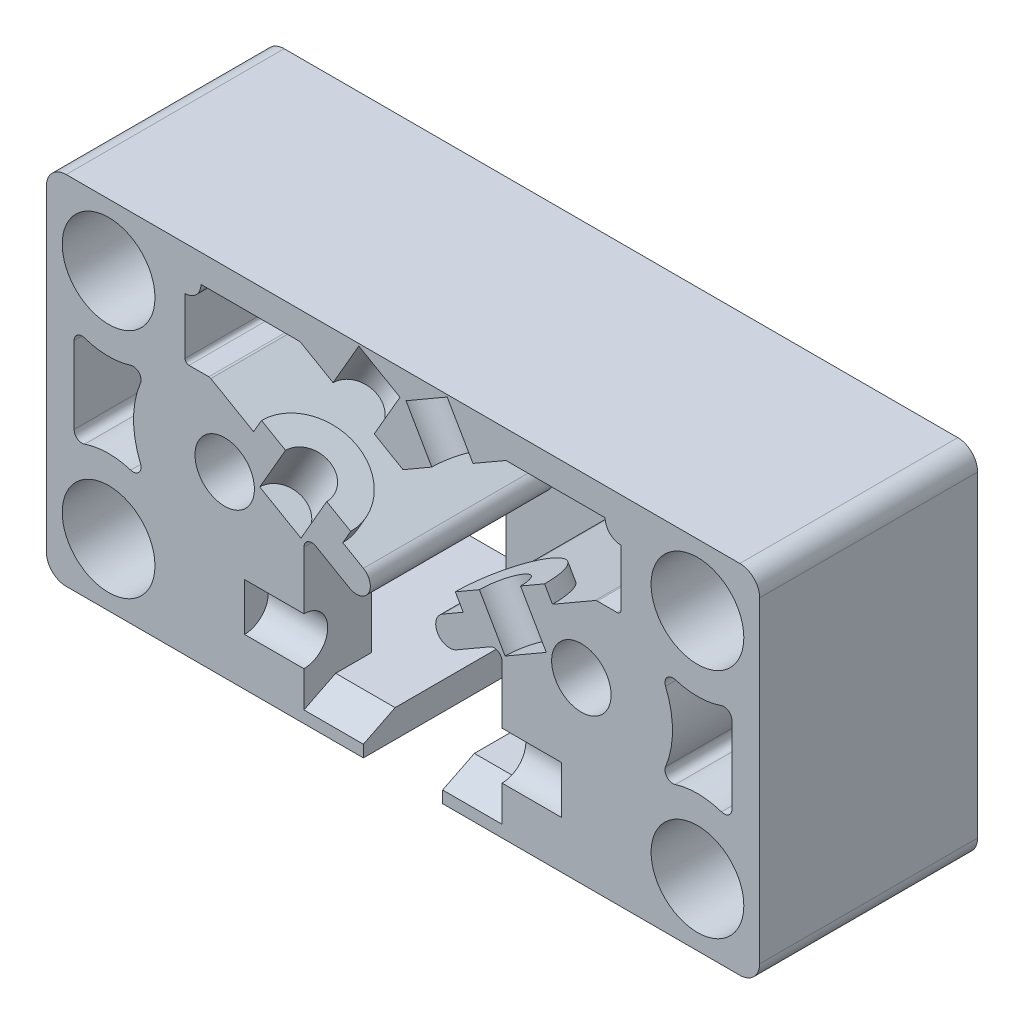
ISO-10303-21;
HEADER;
FILE_DESCRIPTION(('STEP AP214'),'2;1');
FILE_NAME('part.step','',(''),(''),'','','');
FILE_SCHEMA(('AUTOMOTIVE_DESIGN { 1 0 10303 214 1 1 1 1 }'));
ENDSEC;
DATA;
#1=APPLICATION_CONTEXT('core data for automotive mechanical design processes');
#2=APPLICATION_PROTOCOL_DEFINITION('international standard','automotive_design',2000,#1);
#3=PRODUCT_CONTEXT('',#1,'mechanical');
#4=PRODUCT('Part','Part','',(#3));
#5=PRODUCT_RELATED_PRODUCT_CATEGORY('part','',(#4));
#6=PRODUCT_DEFINITION_FORMATION('','',#4);
#7=PRODUCT_DEFINITION_CONTEXT('part definition',#1,'design');
#8=PRODUCT_DEFINITION('design','',#6,#7);
#9=PRODUCT_DEFINITION_SHAPE('','',#8);
#10=(LENGTH_UNIT() NAMED_UNIT(*) SI_UNIT(.MILLI.,.METRE.));
#11=(NAMED_UNIT(*) PLANE_ANGLE_UNIT() SI_UNIT($,.RADIAN.));
#12=(NAMED_UNIT(*) SI_UNIT($,.STERADIAN.) SOLID_ANGLE_UNIT());
#13=UNCERTAINTY_MEASURE_WITH_UNIT(LENGTH_MEASURE(1.E-05),#10,'distance_accuracy_value','');
#14=(GEOMETRIC_REPRESENTATION_CONTEXT(3) GLOBAL_UNCERTAINTY_ASSIGNED_CONTEXT((#13)) GLOBAL_UNIT_ASSIGNED_CONTEXT((#10,
#11,#12)) REPRESENTATION_CONTEXT('',''));
#15=CARTESIAN_POINT('',(0.,0.,0.));
#16=DIRECTION('',(0.,0.,1.));
#17=DIRECTION('',(1.,0.,0.));
#18=AXIS2_PLACEMENT_3D('',#15,#16,#17);
#19=CARTESIAN_POINT('',(-27.,9.90192378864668,0.));
#20=DIRECTION('',(0.,0.,1.));
#21=DIRECTION('',(1.,0.,0.));
#22=AXIS2_PLACEMENT_3D('',#19,#20,#21);
#23=CYLINDRICAL_SURFACE('',#22,0.499999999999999);
#24=DIRECTION('',(0.,0.,1.));
#25=VECTOR('',#24,1.);
#26=CARTESIAN_POINT('',(-27.5,9.90192391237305,0.));
#27=LINE('',#26,#25);
#28=CARTESIAN_POINT('',(-27.5,9.90192385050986,9.));
#29=VERTEX_POINT('',#28);
#30=CARTESIAN_POINT('',(-27.5,9.90192385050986,27.5));
#31=VERTEX_POINT('',#30);
#32=EDGE_CURVE('E606',#29,#31,#27,.T.);
#33=ORIENTED_EDGE('',*,*,#32,.T.);
#34=CARTESIAN_POINT('',(-27.,9.90192378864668,27.5));
#35=DIRECTION('',(0.,0.,1.));
#36=DIRECTION('',(1.,0.,0.));
#37=AXIS2_PLACEMENT_3D('',#34,#35,#36);
#38=CIRCLE('',#37,0.499999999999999);
#39=CARTESIAN_POINT('',(-27.,9.40192378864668,27.5));
#40=VERTEX_POINT('',#39);
#41=EDGE_CURVE('E19',#40,#31,#38,.F.);
#42=ORIENTED_EDGE('',*,*,#41,.F.);
#43=DIRECTION('',(0.,0.,-1.));
#44=VECTOR('',#43,1.);
#45=CARTESIAN_POINT('',(-27.,9.40192378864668,0.));
#46=LINE('',#45,#44);
#47=CARTESIAN_POINT('',(-27.,9.40192378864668,9.));
#48=VERTEX_POINT('',#47);
#49=EDGE_CURVE('E955',#40,#48,#46,.T.);
#50=ORIENTED_EDGE('',*,*,#49,.T.);
#51=CARTESIAN_POINT('',(-27.,9.90192378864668,9.));
#52=DIRECTION('',(0.,0.,1.));
#53=DIRECTION('',(1.,0.,0.));
#54=AXIS2_PLACEMENT_3D('',#51,#52,#53);
#55=CIRCLE('',#54,0.499999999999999);
#56=EDGE_CURVE('E608',#48,#29,#55,.F.);
#57=ORIENTED_EDGE('',*,*,#56,.T.);
#58=EDGE_LOOP('',(#33,#42,#50,#57));
#59=FACE_BOUND('',#58,.T.);
#60=ADVANCED_FACE('F15',(#59),#23,.F.);
#61=CARTESIAN_POINT('',(27.,9.90192378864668,0.));
#62=DIRECTION('',(0.,0.,1.));
#63=DIRECTION('',(1.,0.,0.));
#64=AXIS2_PLACEMENT_3D('',#61,#62,#63);
#65=CYLINDRICAL_SURFACE('',#64,0.499999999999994);
#66=DIRECTION('',(0.,0.,-1.));
#67=VECTOR('',#66,1.);
#68=CARTESIAN_POINT('',(27.,9.40192378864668,0.));
#69=LINE('',#68,#67);
#70=CARTESIAN_POINT('',(27.,9.40192378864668,9.));
#71=VERTEX_POINT('',#70);
#72=CARTESIAN_POINT('',(27.,9.40192378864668,27.5));
#73=VERTEX_POINT('',#72);
#74=EDGE_CURVE('E912',#71,#73,#69,.F.);
#75=ORIENTED_EDGE('',*,*,#74,.T.);
#76=CARTESIAN_POINT('',(27.,9.90192378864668,27.5));
#77=DIRECTION('',(0.,0.,1.));
#78=DIRECTION('',(1.,0.,0.));
#79=AXIS2_PLACEMENT_3D('',#76,#77,#78);
#80=CIRCLE('',#79,0.499999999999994);
#81=CARTESIAN_POINT('',(27.5,9.90192385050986,27.5));
#82=VERTEX_POINT('',#81);
#83=EDGE_CURVE('E604',#82,#73,#80,.F.);
#84=ORIENTED_EDGE('',*,*,#83,.F.);
#85=DIRECTION('',(0.,0.,-1.));
#86=VECTOR('',#85,1.);
#87=CARTESIAN_POINT('',(27.5,9.90192391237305,0.));
#88=LINE('',#87,#86);
#89=CARTESIAN_POINT('',(27.5,9.90192385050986,9.));
#90=VERTEX_POINT('',#89);
#91=EDGE_CURVE('E755',#82,#90,#88,.T.);
#92=ORIENTED_EDGE('',*,*,#91,.T.);
#93=CARTESIAN_POINT('',(27.,9.90192378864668,9.));
#94=DIRECTION('',(0.,0.,1.));
#95=DIRECTION('',(1.,0.,0.));
#96=AXIS2_PLACEMENT_3D('',#93,#94,#95);
#97=CIRCLE('',#96,0.499999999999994);
#98=EDGE_CURVE('E1380',#90,#71,#97,.F.);
#99=ORIENTED_EDGE('',*,*,#98,.T.);
#100=EDGE_LOOP('',(#75,#84,#92,#99));
#101=FACE_BOUND('',#100,.T.);
#102=ADVANCED_FACE('F1393',(#101),#65,.F.);
#103=CARTESIAN_POINT('',(28.5,10.0402370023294,0.));
#104=DIRECTION('',(0.,0.,1.));
#105=DIRECTION('',(1.,0.,0.));
#106=AXIS2_PLACEMENT_3D('',#103,#104,#105);
#107=CYLINDRICAL_SURFACE('',#106,1.);
#108=CARTESIAN_POINT('',(28.5,10.0402370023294,0.));
#109=DIRECTION('',(0.,0.,1.));
#110=DIRECTION('',(1.,0.,0.));
#111=AXIS2_PLACEMENT_3D('',#108,#109,#110);
#112=CIRCLE('',#111,1.);
#113=CARTESIAN_POINT('',(27.5,10.0402370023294,0.));
#114=VERTEX_POINT('',#113);
#115=CARTESIAN_POINT('',(27.5375428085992,9.76880348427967,0.));
#116=VERTEX_POINT('',#115);
#117=EDGE_CURVE('E1384',#114,#116,#112,.T.);
#118=ORIENTED_EDGE('',*,*,#117,.T.);
#119=DIRECTION('',(0.,0.,1.));
#120=VECTOR('',#119,1.);
#121=CARTESIAN_POINT('',(27.5375428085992,9.76880348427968,0.));
#122=LINE('',#121,#120);
#123=CARTESIAN_POINT('',(27.5375428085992,9.76880348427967,9.));
#124=VERTEX_POINT('',#123);
#125=EDGE_CURVE('E750',#116,#124,#122,.T.);
#126=ORIENTED_EDGE('',*,*,#125,.T.);
#127=CARTESIAN_POINT('',(28.5,10.0402370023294,9.));
#128=DIRECTION('',(0.,0.,1.));
#129=DIRECTION('',(1.,0.,0.));
#130=AXIS2_PLACEMENT_3D('',#127,#128,#129);
#131=CIRCLE('',#130,1.);
#132=CARTESIAN_POINT('',(27.5,10.0402370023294,9.));
#133=VERTEX_POINT('',#132);
#134=EDGE_CURVE('E1382',#124,#133,#131,.F.);
#135=ORIENTED_EDGE('',*,*,#134,.T.);
#136=DIRECTION('',(0.,0.,-1.));
#137=VECTOR('',#136,1.);
#138=CARTESIAN_POINT('',(27.5,10.0402370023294,0.));
#139=LINE('',#138,#137);
#140=EDGE_CURVE('E752',#133,#114,#139,.T.);
#141=ORIENTED_EDGE('',*,*,#140,.T.);
#142=EDGE_LOOP('',(#118,#126,#135,#141));
#143=FACE_BOUND('',#142,.T.);
#144=ADVANCED_FACE('F2346',(#143),#107,.T.);
#145=CARTESIAN_POINT('',(3.3124738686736,8.12475972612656,9.));
#146=DIRECTION('',(0.,0.,1.));
#147=DIRECTION('',(1.,0.,0.));
#148=AXIS2_PLACEMENT_3D('',#145,#146,#147);
#149=PLANE('',#148);
#150=CARTESIAN_POINT('',(22.5,0.,9.));
#151=DIRECTION('',(0.,0.,1.));
#152=DIRECTION('',(1.,0.,0.));
#153=AXIS2_PLACEMENT_3D('',#150,#151,#152);
#154=CIRCLE('',#153,3.75);
#155=CARTESIAN_POINT('',(26.25,0.,9.));
#156=VERTEX_POINT('',#155);
#157=EDGE_CURVE('E846',#156,#156,#154,.T.);
#158=ORIENTED_EDGE('',*,*,#157,.T.);
#159=EDGE_LOOP('',(#158));
#160=FACE_BOUND('',#159,.T.);
#161=CARTESIAN_POINT('',(24.5,8.90192378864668,9.));
#162=DIRECTION('',(0.,0.,1.));
#163=DIRECTION('',(1.,0.,0.));
#164=AXIS2_PLACEMENT_3D('',#161,#162,#163);
#165=CIRCLE('',#164,0.499999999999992);
#166=CARTESIAN_POINT('',(24.5,9.40192378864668,9.));
#167=VERTEX_POINT('',#166);
#168=CARTESIAN_POINT('',(24.25,9.3349364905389,9.00000000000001));
#169=VERTEX_POINT('',#168);
#170=EDGE_CURVE('E1377',#167,#169,#165,.T.);
#171=ORIENTED_EDGE('',*,*,#170,.F.);
#172=DIRECTION('',(1.,0.,0.));
#173=VECTOR('',#172,1.);
#174=CARTESIAN_POINT('',(27.,9.40192378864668,9.));
#175=LINE('',#174,#173);
#176=EDGE_CURVE('E919',#167,#71,#175,.T.);
#177=ORIENTED_EDGE('',*,*,#176,.T.);
#178=ORIENTED_EDGE('',*,*,#98,.F.);
#179=DIRECTION('',(0.,1.,0.));
#180=VECTOR('',#179,1.);
#181=CARTESIAN_POINT('',(27.5,17.,9.));
#182=LINE('',#181,#180);
#183=EDGE_CURVE('E759',#90,#133,#182,.T.);
#184=ORIENTED_EDGE('',*,*,#183,.T.);
#185=ORIENTED_EDGE('',*,*,#134,.F.);
#186=DIRECTION('',(-0.271433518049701,0.962457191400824,0.));
#187=VECTOR('',#186,1.);
#188=CARTESIAN_POINT('',(27.5375428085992,9.76880348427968,9.00000000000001));
#189=LINE('',#188,#187);
#190=CARTESIAN_POINT('',(29.7184289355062,2.03575138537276,9.));
#191=VERTEX_POINT('',#190);
#192=EDGE_CURVE('E749',#124,#191,#189,.F.);
#193=ORIENTED_EDGE('',*,*,#192,.T.);
#194=CARTESIAN_POINT('',(22.5,0.,9.));
#195=DIRECTION('',(0.,0.,1.));
#196=DIRECTION('',(1.,0.,0.));
#197=AXIS2_PLACEMENT_3D('',#194,#195,#196);
#198=CIRCLE('',#197,7.5);
#199=CARTESIAN_POINT('',(16.0048094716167,-3.75,9.));
#200=VERTEX_POINT('',#199);
#201=EDGE_CURVE('E745',#191,#200,#198,.F.);
#202=ORIENTED_EDGE('',*,*,#201,.T.);
#203=DIRECTION('',(0.499999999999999,-0.866025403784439,0.));
#204=VECTOR('',#203,1.);
#205=CARTESIAN_POINT('',(16.0048094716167,-3.75,9.00000000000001));
#206=LINE('',#205,#204);
#207=CARTESIAN_POINT('',(12.4001633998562,2.49343013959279,9.00000000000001));
#208=VERTEX_POINT('',#207);
#209=EDGE_CURVE('E744',#200,#208,#206,.F.);
#210=ORIENTED_EDGE('',*,*,#209,.T.);
#211=DIRECTION('',(0.866025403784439,0.5,0.));
#212=VECTOR('',#211,1.);
#213=CARTESIAN_POINT('',(24.25,9.3349364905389,9.00000000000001));
#214=LINE('',#213,#212);
#215=EDGE_CURVE('E911',#208,#169,#214,.T.);
#216=ORIENTED_EDGE('',*,*,#215,.T.);
#217=EDGE_LOOP('',(#171,#177,#178,#184,#185,#193,#202,#210,#216));
#218=FACE_BOUND('',#217,.T.);
#219=ADVANCED_FACE('F2342',(#160,#218),#149,.F.);
#220=CARTESIAN_POINT('',(24.5,8.90192378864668,0.));
#221=DIRECTION('',(0.,0.,1.));
#222=DIRECTION('',(1.,0.,0.));
#223=AXIS2_PLACEMENT_3D('',#220,#221,#222);
#224=CYLINDRICAL_SURFACE('',#223,0.499999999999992);
#225=CARTESIAN_POINT('',(24.5,8.90192378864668,27.5));
#226=DIRECTION('',(0.,0.,1.));
#227=DIRECTION('',(1.,0.,0.));
#228=AXIS2_PLACEMENT_3D('',#225,#226,#227);
#229=CIRCLE('',#228,0.499999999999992);
#230=CARTESIAN_POINT('',(24.25,9.3349364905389,27.5));
#231=VERTEX_POINT('',#230);
#232=CARTESIAN_POINT('',(24.5,9.40192378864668,27.5));
#233=VERTEX_POINT('',#232);
#234=EDGE_CURVE('E1375',#231,#233,#229,.F.);
#235=ORIENTED_EDGE('',*,*,#234,.T.);
#236=DIRECTION('',(0.,0.,-1.));
#237=VECTOR('',#236,1.);
#238=CARTESIAN_POINT('',(24.5,9.40192378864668,0.));
#239=LINE('',#238,#237);
#240=EDGE_CURVE('E915',#233,#167,#239,.T.);
#241=ORIENTED_EDGE('',*,*,#240,.T.);
#242=ORIENTED_EDGE('',*,*,#170,.T.);
#243=DIRECTION('',(0.,0.,1.));
#244=VECTOR('',#243,1.);
#245=CARTESIAN_POINT('',(24.25,9.3349364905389,0.));
#246=LINE('',#245,#244);
#247=EDGE_CURVE('E908',#169,#231,#246,.T.);
#248=ORIENTED_EDGE('',*,*,#247,.T.);
#249=EDGE_LOOP('',(#235,#241,#242,#248));
#250=FACE_BOUND('',#249,.T.);
#251=ADVANCED_FACE('F2338',(#250),#224,.T.);
#252=CARTESIAN_POINT('',(-24.5,8.90192378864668,0.));
#253=DIRECTION('',(0.,0.,1.));
#254=DIRECTION('',(1.,0.,0.));
#255=AXIS2_PLACEMENT_3D('',#252,#253,#254);
#256=CYLINDRICAL_SURFACE('',#255,0.499999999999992);
#257=CARTESIAN_POINT('',(-24.5,8.90192378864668,27.5));
#258=DIRECTION('',(0.,0.,1.));
#259=DIRECTION('',(1.,0.,0.));
#260=AXIS2_PLACEMENT_3D('',#257,#258,#259);
#261=CIRCLE('',#260,0.499999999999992);
#262=CARTESIAN_POINT('',(-24.5,9.40192378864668,27.5));
#263=VERTEX_POINT('',#262);
#264=CARTESIAN_POINT('',(-24.25,9.3349364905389,27.5));
#265=VERTEX_POINT('',#264);
#266=EDGE_CURVE('E1373',#263,#265,#261,.F.);
#267=ORIENTED_EDGE('',*,*,#266,.T.);
#268=DIRECTION('',(0.,0.,1.));
#269=VECTOR('',#268,1.);
#270=CARTESIAN_POINT('',(-24.25,9.3349364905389,0.));
#271=LINE('',#270,#269);
#272=CARTESIAN_POINT('',(-24.25,9.3349364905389,9.));
#273=VERTEX_POINT('',#272);
#274=EDGE_CURVE('E962',#265,#273,#271,.F.);
#275=ORIENTED_EDGE('',*,*,#274,.T.);
#276=CARTESIAN_POINT('',(-24.5,8.90192378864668,9.));
#277=DIRECTION('',(0.,0.,1.));
#278=DIRECTION('',(1.,0.,0.));
#279=AXIS2_PLACEMENT_3D('',#276,#277,#278);
#280=CIRCLE('',#279,0.499999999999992);
#281=CARTESIAN_POINT('',(-24.5,9.40192378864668,9.));
#282=VERTEX_POINT('',#281);
#283=EDGE_CURVE('E1369',#273,#282,#280,.T.);
#284=ORIENTED_EDGE('',*,*,#283,.T.);
#285=DIRECTION('',(0.,0.,-1.));
#286=VECTOR('',#285,1.);
#287=CARTESIAN_POINT('',(-24.5,9.40192378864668,0.));
#288=LINE('',#287,#286);
#289=EDGE_CURVE('E952',#282,#263,#288,.F.);
#290=ORIENTED_EDGE('',*,*,#289,.T.);
#291=EDGE_LOOP('',(#267,#275,#284,#290));
#292=FACE_BOUND('',#291,.T.);
#293=ADVANCED_FACE('F2334',(#292),#256,.T.);
#294=CARTESIAN_POINT('',(-28.5,10.0402370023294,9.));
#295=DIRECTION('',(0.,0.,-1.));
#296=DIRECTION('',(0.,1.,0.));
#297=AXIS2_PLACEMENT_3D('',#294,#295,#296);
#298=CYLINDRICAL_SURFACE('',#297,0.999999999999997);
#299=DIRECTION('',(0.,0.,-1.));
#300=VECTOR('',#299,1.);
#301=CARTESIAN_POINT('',(-27.5375428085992,9.76880348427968,4.5));
#302=LINE('',#301,#300);
#303=CARTESIAN_POINT('',(-27.5375428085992,9.76880348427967,9.));
#304=VERTEX_POINT('',#303);
#305=CARTESIAN_POINT('',(-27.5375428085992,9.76880348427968,0.));
#306=VERTEX_POINT('',#305);
#307=EDGE_CURVE('E717',#304,#306,#302,.T.);
#308=ORIENTED_EDGE('',*,*,#307,.T.);
#309=CARTESIAN_POINT('',(-28.5,10.0402370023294,0.));
#310=DIRECTION('',(0.,0.,-1.));
#311=DIRECTION('',(0.,1.,0.));
#312=AXIS2_PLACEMENT_3D('',#309,#310,#311);
#313=CIRCLE('',#312,0.999999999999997);
#314=CARTESIAN_POINT('',(-27.5,10.0402370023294,0.));
#315=VERTEX_POINT('',#314);
#316=EDGE_CURVE('E1371',#315,#306,#313,.T.);
#317=ORIENTED_EDGE('',*,*,#316,.F.);
#318=DIRECTION('',(0.,0.,1.));
#319=VECTOR('',#318,1.);
#320=CARTESIAN_POINT('',(-27.5,10.0402370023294,0.));
#321=LINE('',#320,#319);
#322=CARTESIAN_POINT('',(-27.5,10.0402370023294,9.));
#323=VERTEX_POINT('',#322);
#324=EDGE_CURVE('E612',#315,#323,#321,.T.);
#325=ORIENTED_EDGE('',*,*,#324,.T.);
#326=CARTESIAN_POINT('',(-28.5,10.0402370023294,9.));
#327=DIRECTION('',(0.,0.,-1.));
#328=DIRECTION('',(0.,1.,0.));
#329=AXIS2_PLACEMENT_3D('',#326,#327,#328);
#330=CIRCLE('',#329,0.999999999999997);
#331=EDGE_CURVE('E1366',#323,#304,#330,.T.);
#332=ORIENTED_EDGE('',*,*,#331,.T.);
#333=EDGE_LOOP('',(#308,#317,#325,#332));
#334=FACE_BOUND('',#333,.T.);
#335=ADVANCED_FACE('F2337',(#334),#298,.T.);
#336=CARTESIAN_POINT('',(-12.4001633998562,10.0402370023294,9.));
#337=DIRECTION('',(0.,0.,1.));
#338=DIRECTION('',(-1.,0.,0.));
#339=AXIS2_PLACEMENT_3D('',#336,#337,#338);
#340=PLANE('',#339);
#341=CARTESIAN_POINT('',(-22.5,0.,9.));
#342=DIRECTION('',(0.,0.,1.));
#343=DIRECTION('',(1.,0.,0.));
#344=AXIS2_PLACEMENT_3D('',#341,#342,#343);
#345=CIRCLE('',#344,3.75);
#346=CARTESIAN_POINT('',(-18.75,0.,9.));
#347=VERTEX_POINT('',#346);
#348=EDGE_CURVE('E863',#347,#347,#345,.T.);
#349=ORIENTED_EDGE('',*,*,#348,.T.);
#350=EDGE_LOOP('',(#349));
#351=FACE_BOUND('',#350,.T.);
#352=DIRECTION('',(-0.499999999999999,-0.866025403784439,0.));
#353=VECTOR('',#352,1.);
#354=CARTESIAN_POINT('',(-14.2024864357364,-0.628284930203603,9.));
#355=LINE('',#354,#353);
#356=CARTESIAN_POINT('',(-12.4001633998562,2.49343013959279,9.));
#357=VERTEX_POINT('',#356);
#358=CARTESIAN_POINT('',(-16.0048094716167,-3.75,9.));
#359=VERTEX_POINT('',#358);
#360=EDGE_CURVE('E724',#357,#359,#355,.T.);
#361=ORIENTED_EDGE('',*,*,#360,.T.);
#362=CARTESIAN_POINT('',(-22.5,0.,9.));
#363=DIRECTION('',(0.,0.,1.));
#364=DIRECTION('',(1.,0.,0.));
#365=AXIS2_PLACEMENT_3D('',#362,#363,#364);
#366=CIRCLE('',#365,7.5);
#367=CARTESIAN_POINT('',(-29.7184289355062,2.03575138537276,9.));
#368=VERTEX_POINT('',#367);
#369=EDGE_CURVE('E720',#359,#368,#366,.F.);
#370=ORIENTED_EDGE('',*,*,#369,.T.);
#371=DIRECTION('',(0.271433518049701,0.962457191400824,0.));
#372=VECTOR('',#371,1.);
#373=CARTESIAN_POINT('',(-28.6279858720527,5.90227743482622,9.));
#374=LINE('',#373,#372);
#375=EDGE_CURVE('E713',#368,#304,#374,.T.);
#376=ORIENTED_EDGE('',*,*,#375,.T.);
#377=ORIENTED_EDGE('',*,*,#331,.F.);
#378=DIRECTION('',(0.,1.,0.));
#379=VECTOR('',#378,1.);
#380=CARTESIAN_POINT('',(-27.5,9.90192378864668,9.));
#381=LINE('',#380,#379);
#382=EDGE_CURVE('E613',#323,#29,#381,.F.);
#383=ORIENTED_EDGE('',*,*,#382,.T.);
#384=ORIENTED_EDGE('',*,*,#56,.F.);
#385=DIRECTION('',(1.,0.,0.));
#386=VECTOR('',#385,1.);
#387=CARTESIAN_POINT('',(-24.5,9.40192378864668,9.));
#388=LINE('',#387,#386);
#389=EDGE_CURVE('E958',#48,#282,#388,.T.);
#390=ORIENTED_EDGE('',*,*,#389,.T.);
#391=ORIENTED_EDGE('',*,*,#283,.F.);
#392=DIRECTION('',(0.866025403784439,-0.5,0.));
#393=VECTOR('',#392,1.);
#394=CARTESIAN_POINT('',(-5.,-1.77905619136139,9.00000000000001));
#395=LINE('',#394,#393);
#396=EDGE_CURVE('E728',#273,#357,#395,.T.);
#397=ORIENTED_EDGE('',*,*,#396,.T.);
#398=EDGE_LOOP('',(#361,#370,#376,#377,#383,#384,#390,#391,#397));
#399=FACE_BOUND('',#398,.T.);
#400=ADVANCED_FACE('F2333',(#351,#399),#340,.F.);
#401=CARTESIAN_POINT('',(0.,-11.3142588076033,4.50000000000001));
#402=DIRECTION('',(0.,0.,1.));
#403=DIRECTION('',(1.,0.,0.));
#404=AXIS2_PLACEMENT_3D('',#401,#402,#403);
#405=PLANE('',#404);
#406=CARTESIAN_POINT('',(11.5,-3.22243186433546,4.50000000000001));
#407=DIRECTION('',(0.,0.,-1.));
#408=DIRECTION('',(-1.,0.,0.));
#409=AXIS2_PLACEMENT_3D('',#406,#407,#408);
#410=CIRCLE('',#409,1.);
#411=CARTESIAN_POINT('',(12.5,-3.22243186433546,4.5));
#412=VERTEX_POINT('',#411);
#413=CARTESIAN_POINT('',(11.,-2.35640646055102,4.5));
#414=VERTEX_POINT('',#413);
#415=EDGE_CURVE('E877',#412,#414,#410,.F.);
#416=ORIENTED_EDGE('',*,*,#415,.T.);
#417=DIRECTION('',(-0.866025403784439,-0.5,0.));
#418=VECTOR('',#417,1.);
#419=CARTESIAN_POINT('',(11.,-2.35640646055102,4.5));
#420=LINE('',#419,#418);
#421=CARTESIAN_POINT('',(10.5067286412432,-2.64119681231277,4.5));
#422=VERTEX_POINT('',#421);
#423=EDGE_CURVE('E878',#414,#422,#420,.T.);
#424=ORIENTED_EDGE('',*,*,#423,.T.);
#425=CARTESIAN_POINT('',(11.0134572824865,-3.51887656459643,4.5));
#426=DIRECTION('',(0.,0.,1.));
#427=DIRECTION('',(1.,0.,0.));
#428=AXIS2_PLACEMENT_3D('',#425,#426,#427);
#429=CIRCLE('',#428,1.0134572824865);
#430=CARTESIAN_POINT('',(11.9824639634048,-3.22202354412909,4.5));
#431=VERTEX_POINT('',#430);
#432=EDGE_CURVE('E702',#422,#431,#429,.F.);
#433=ORIENTED_EDGE('',*,*,#432,.T.);
#434=CARTESIAN_POINT('',(22.5,0.,4.5));
#435=DIRECTION('',(0.,0.,1.));
#436=DIRECTION('',(1.,0.,0.));
#437=AXIS2_PLACEMENT_3D('',#434,#435,#436);
#438=CIRCLE('',#437,11.);
#439=CARTESIAN_POINT('',(12.5,-4.58257569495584,4.5));
#440=VERTEX_POINT('',#439);
#441=EDGE_CURVE('E1364',#431,#440,#438,.T.);
#442=ORIENTED_EDGE('',*,*,#441,.T.);
#443=DIRECTION('',(0.,1.,0.));
#444=VECTOR('',#443,1.);
#445=CARTESIAN_POINT('',(12.5,-19.,4.5));
#446=LINE('',#445,#444);
#447=EDGE_CURVE('E874',#440,#412,#446,.T.);
#448=ORIENTED_EDGE('',*,*,#447,.T.);
#449=EDGE_LOOP('',(#416,#424,#433,#442,#448));
#450=FACE_BOUND('',#449,.T.);
#451=ADVANCED_FACE('F2329',(#450),#405,.T.);
#452=CARTESIAN_POINT('',(29.3617071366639,-8.96708180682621,0.));
#453=DIRECTION('',(0.,0.,1.));
#454=DIRECTION('',(1.,0.,0.));
#455=AXIS2_PLACEMENT_3D('',#452,#453,#454);
#456=CYLINDRICAL_SURFACE('',#455,0.291216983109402);
#457=DIRECTION('',(0.,0.,1.));
#458=VECTOR('',#457,1.);
#459=CARTESIAN_POINT('',(29.184733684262,-8.73580766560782,0.));
#460=LINE('',#459,#458);
#461=CARTESIAN_POINT('',(29.184733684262,-8.73580766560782,0.));
#462=VERTEX_POINT('',#461);
#463=CARTESIAN_POINT('',(29.184733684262,-8.73580766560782,19.));
#464=VERTEX_POINT('',#463);
#465=EDGE_CURVE('E701',#462,#464,#460,.T.);
#466=ORIENTED_EDGE('',*,*,#465,.F.);
#467=CARTESIAN_POINT('',(29.3617071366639,-8.96708180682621,0.));
#468=DIRECTION('',(0.,0.,1.));
#469=DIRECTION('',(1.,0.,0.));
#470=AXIS2_PLACEMENT_3D('',#467,#468,#469);
#471=CIRCLE('',#470,0.291216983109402);
#472=CARTESIAN_POINT('',(29.5969557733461,-9.1387367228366,0.));
#473=VERTEX_POINT('',#472);
#474=EDGE_CURVE('E1362',#473,#462,#471,.T.);
#475=ORIENTED_EDGE('',*,*,#474,.F.);
#476=DIRECTION('',(0.,0.,1.));
#477=VECTOR('',#476,1.);
#478=CARTESIAN_POINT('',(29.5969557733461,-9.1387367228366,0.));
#479=LINE('',#478,#477);
#480=CARTESIAN_POINT('',(29.5969557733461,-9.1387367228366,19.));
#481=VERTEX_POINT('',#480);
#482=EDGE_CURVE('E691',#481,#473,#479,.F.);
#483=ORIENTED_EDGE('',*,*,#482,.F.);
#484=CARTESIAN_POINT('',(29.3617071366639,-8.96708180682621,19.));
#485=DIRECTION('',(0.,0.,1.));
#486=DIRECTION('',(1.,0.,0.));
#487=AXIS2_PLACEMENT_3D('',#484,#485,#486);
#488=CIRCLE('',#487,0.291216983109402);
#489=EDGE_CURVE('E1085',#481,#464,#488,.T.);
#490=ORIENTED_EDGE('',*,*,#489,.T.);
#491=EDGE_LOOP('',(#466,#475,#483,#490));
#492=FACE_BOUND('',#491,.T.);
#493=ADVANCED_FACE('F2325',(#492),#456,.F.);
#494=CARTESIAN_POINT('',(26.8915969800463,-16.0239241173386,0.));
#495=DIRECTION('',(0.,0.,1.));
#496=DIRECTION('',(1.,0.,0.));
#497=AXIS2_PLACEMENT_3D('',#494,#495,#496);
#498=CYLINDRICAL_SURFACE('',#497,1.);
#499=DIRECTION('',(0.,0.,1.));
#500=VECTOR('',#499,1.);
#501=CARTESIAN_POINT('',(27.8827470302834,-15.8911778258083,0.));
#502=LINE('',#501,#500);
#503=CARTESIAN_POINT('',(27.8827470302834,-15.8911778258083,0.));
#504=VERTEX_POINT('',#503);
#505=CARTESIAN_POINT('',(27.8827470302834,-15.8911778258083,19.));
#506=VERTEX_POINT('',#505);
#507=EDGE_CURVE('E694',#504,#506,#502,.T.);
#508=ORIENTED_EDGE('',*,*,#507,.F.);
#509=CARTESIAN_POINT('',(26.8915969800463,-16.0239241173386,0.));
#510=DIRECTION('',(0.,0.,1.));
#511=DIRECTION('',(1.,0.,0.));
#512=AXIS2_PLACEMENT_3D('',#509,#510,#511);
#513=CIRCLE('',#512,1.);
#514=CARTESIAN_POINT('',(27.0008045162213,-17.017943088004,0.));
#515=VERTEX_POINT('',#514);
#516=EDGE_CURVE('E1360',#515,#504,#513,.T.);
#517=ORIENTED_EDGE('',*,*,#516,.F.);
#518=DIRECTION('',(0.,0.,1.));
#519=VECTOR('',#518,1.);
#520=CARTESIAN_POINT('',(27.0008045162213,-17.017943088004,0.));
#521=LINE('',#520,#519);
#522=CARTESIAN_POINT('',(27.0008045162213,-17.017943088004,19.));
#523=VERTEX_POINT('',#522);
#524=EDGE_CURVE('E687',#523,#515,#521,.F.);
#525=ORIENTED_EDGE('',*,*,#524,.F.);
#526=CARTESIAN_POINT('',(26.8915969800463,-16.0239241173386,19.));
#527=DIRECTION('',(0.,0.,1.));
#528=DIRECTION('',(1.,0.,0.));
#529=AXIS2_PLACEMENT_3D('',#526,#527,#528);
#530=CIRCLE('',#529,1.);
#531=EDGE_CURVE('E1356',#523,#506,#530,.T.);
#532=ORIENTED_EDGE('',*,*,#531,.T.);
#533=EDGE_LOOP('',(#508,#517,#525,#532));
#534=FACE_BOUND('',#533,.T.);
#535=ADVANCED_FACE('F2321',(#534),#498,.F.);
#536=CARTESIAN_POINT('',(11.,-18.,0.));
#537=DIRECTION('',(0.,0.,1.));
#538=DIRECTION('',(1.,0.,0.));
#539=AXIS2_PLACEMENT_3D('',#536,#537,#538);
#540=CYLINDRICAL_SURFACE('',#539,1.);
#541=DIRECTION('',(0.,0.,-1.));
#542=VECTOR('',#541,1.);
#543=CARTESIAN_POINT('',(11.,-19.,27.5));
#544=LINE('',#543,#542);
#545=CARTESIAN_POINT('',(11.,-19.,4.5));
#546=VERTEX_POINT('',#545);
#547=CARTESIAN_POINT('',(11.,-19.,0.));
#548=VERTEX_POINT('',#547);
#549=EDGE_CURVE('E684',#546,#548,#544,.T.);
#550=ORIENTED_EDGE('',*,*,#549,.T.);
#551=CARTESIAN_POINT('',(11.,-18.,0.));
#552=DIRECTION('',(0.,0.,1.));
#553=DIRECTION('',(1.,0.,0.));
#554=AXIS2_PLACEMENT_3D('',#551,#552,#553);
#555=CIRCLE('',#554,1.);
#556=CARTESIAN_POINT('',(10.,-18.,0.));
#557=VERTEX_POINT('',#556);
#558=EDGE_CURVE('E1358',#557,#548,#555,.T.);
#559=ORIENTED_EDGE('',*,*,#558,.F.);
#560=DIRECTION('',(0.,0.,1.));
#561=VECTOR('',#560,1.);
#562=CARTESIAN_POINT('',(10.,-18.,0.));
#563=LINE('',#562,#561);
#564=CARTESIAN_POINT('',(10.,-18.,4.5));
#565=VERTEX_POINT('',#564);
#566=EDGE_CURVE('E711',#557,#565,#563,.T.);
#567=ORIENTED_EDGE('',*,*,#566,.T.);
#568=CARTESIAN_POINT('',(11.,-18.,4.5));
#569=DIRECTION('',(0.,0.,1.));
#570=DIRECTION('',(1.,0.,0.));
#571=AXIS2_PLACEMENT_3D('',#568,#569,#570);
#572=CIRCLE('',#571,1.);
#573=EDGE_CURVE('E1017',#546,#565,#572,.F.);
#574=ORIENTED_EDGE('',*,*,#573,.F.);
#575=EDGE_LOOP('',(#550,#559,#567,#574));
#576=FACE_BOUND('',#575,.T.);
#577=ADVANCED_FACE('F2318',(#576),#540,.F.);
#578=CARTESIAN_POINT('',(18.1399397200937,-12.2469220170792,19.));
#579=DIRECTION('',(0.,0.,1.));
#580=DIRECTION('',(1.,0.,0.));
#581=AXIS2_PLACEMENT_3D('',#578,#579,#580);
#582=PLANE('',#581);
#583=CARTESIAN_POINT('',(22.5,0.,19.));
#584=DIRECTION('',(0.,0.,1.));
#585=DIRECTION('',(1.,0.,0.));
#586=AXIS2_PLACEMENT_3D('',#583,#584,#585);
#587=CIRCLE('',#586,11.);
#588=CARTESIAN_POINT('',(12.5,-4.58257569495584,19.));
#589=VERTEX_POINT('',#588);
#590=EDGE_CURVE('E705',#464,#589,#587,.F.);
#591=ORIENTED_EDGE('',*,*,#590,.F.);
#592=ORIENTED_EDGE('',*,*,#489,.F.);
#593=CARTESIAN_POINT('',(37.15,-14.65,19.));
#594=DIRECTION('',(0.,0.,1.));
#595=DIRECTION('',(1.,0.,0.));
#596=AXIS2_PLACEMENT_3D('',#593,#594,#595);
#597=CIRCLE('',#596,9.35);
#598=EDGE_CURVE('E695',#506,#481,#597,.F.);
#599=ORIENTED_EDGE('',*,*,#598,.F.);
#600=ORIENTED_EDGE('',*,*,#531,.F.);
#601=CARTESIAN_POINT('',(27.3284271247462,-20.,19.));
#602=DIRECTION('',(0.,0.,1.));
#603=DIRECTION('',(1.,0.,0.));
#604=AXIS2_PLACEMENT_3D('',#601,#602,#603);
#605=CIRCLE('',#604,3.);
#606=CARTESIAN_POINT('',(24.5,-19.,19.));
#607=VERTEX_POINT('',#606);
#608=EDGE_CURVE('E690',#607,#523,#605,.F.);
#609=ORIENTED_EDGE('',*,*,#608,.F.);
#610=DIRECTION('',(1.,0.,0.));
#611=VECTOR('',#610,1.);
#612=CARTESIAN_POINT('',(5.,-19.,19.));
#613=LINE('',#612,#611);
#614=CARTESIAN_POINT('',(12.5,-19.,19.));
#615=VERTEX_POINT('',#614);
#616=EDGE_CURVE('E683',#607,#615,#613,.F.);
#617=ORIENTED_EDGE('',*,*,#616,.T.);
#618=DIRECTION('',(0.,1.,0.));
#619=VECTOR('',#618,1.);
#620=CARTESIAN_POINT('',(12.5,-19.,19.));
#621=LINE('',#620,#619);
#622=EDGE_CURVE('E1059',#615,#589,#621,.T.);
#623=ORIENTED_EDGE('',*,*,#622,.T.);
#624=EDGE_LOOP('',(#591,#592,#599,#600,#609,#617,#623));
#625=FACE_BOUND('',#624,.T.);
#626=ADVANCED_FACE('F1515',(#625),#582,.F.);
#627=CARTESIAN_POINT('',(5.,-22.5,27.5));
#628=DIRECTION('',(1.,0.,0.));
#629=DIRECTION('',(0.,0.,-1.));
#630=AXIS2_PLACEMENT_3D('',#627,#628,#629);
#631=PLANE('',#630);
#632=DIRECTION('',(0.,0.,-1.));
#633=VECTOR('',#632,1.);
#634=CARTESIAN_POINT('',(5.,-19.,27.5));
#635=LINE('',#634,#633);
#636=CARTESIAN_POINT('',(5.,-19.,23.5));
#637=VERTEX_POINT('',#636);
#638=CARTESIAN_POINT('',(5.,-19.,4.50000000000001));
#639=VERTEX_POINT('',#638);
#640=EDGE_CURVE('E1048',#637,#639,#635,.T.);
#641=ORIENTED_EDGE('',*,*,#640,.T.);
#642=DIRECTION('',(0.,1.,0.));
#643=VECTOR('',#642,1.);
#644=CARTESIAN_POINT('',(5.,-11.3142588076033,4.50000000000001));
#645=LINE('',#644,#643);
#646=CARTESIAN_POINT('',(5.,-22.5,4.50000000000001));
#647=VERTEX_POINT('',#646);
#648=EDGE_CURVE('E1044',#647,#639,#645,.T.);
#649=ORIENTED_EDGE('',*,*,#648,.F.);
#650=DIRECTION('',(0.,0.,-1.));
#651=VECTOR('',#650,1.);
#652=CARTESIAN_POINT('',(5.,-22.5,0.));
#653=LINE('',#652,#651);
#654=CARTESIAN_POINT('',(5.,-22.5,27.5));
#655=VERTEX_POINT('',#654);
#656=EDGE_CURVE('E839',#655,#647,#653,.T.);
#657=ORIENTED_EDGE('',*,*,#656,.F.);
#658=DIRECTION('',(0.,1.,0.));
#659=VECTOR('',#658,1.);
#660=CARTESIAN_POINT('',(5.,-22.5,27.5));
#661=LINE('',#660,#659);
#662=CARTESIAN_POINT('',(5.,-21.,27.5));
#663=VERTEX_POINT('',#662);
#664=EDGE_CURVE('E1081',#663,#655,#661,.F.);
#665=ORIENTED_EDGE('',*,*,#664,.F.);
#666=DIRECTION('',(0.,-0.447213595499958,0.894427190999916));
#667=VECTOR('',#666,1.);
#668=CARTESIAN_POINT('',(5.,-20.,25.5));
#669=LINE('',#668,#667);
#670=EDGE_CURVE('E864',#637,#663,#669,.T.);
#671=ORIENTED_EDGE('',*,*,#670,.F.);
#672=EDGE_LOOP('',(#641,#649,#657,#665,#671));
#673=FACE_BOUND('',#672,.T.);
#674=ADVANCED_FACE('F1451',(#673),#631,.F.);
#675=CARTESIAN_POINT('',(-5.,-19.,27.5));
#676=DIRECTION('',(-1.,0.,0.));
#677=DIRECTION('',(0.,0.,1.));
#678=AXIS2_PLACEMENT_3D('',#675,#676,#677);
#679=PLANE('',#678);
#680=DIRECTION('',(0.,1.,0.));
#681=VECTOR('',#680,1.);
#682=CARTESIAN_POINT('',(-5.,-19.,27.5));
#683=LINE('',#682,#681);
#684=CARTESIAN_POINT('',(-5.,-22.5,27.5));
#685=VERTEX_POINT('',#684);
#686=CARTESIAN_POINT('',(-5.,-21.,27.5));
#687=VERTEX_POINT('',#686);
#688=EDGE_CURVE('E1084',#685,#687,#683,.T.);
#689=ORIENTED_EDGE('',*,*,#688,.F.);
#690=DIRECTION('',(0.,0.,-1.));
#691=VECTOR('',#690,1.);
#692=CARTESIAN_POINT('',(-5.,-22.5,0.));
#693=LINE('',#692,#691);
#694=CARTESIAN_POINT('',(-5.,-22.5,4.50000000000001));
#695=VERTEX_POINT('',#694);
#696=EDGE_CURVE('E840',#695,#685,#693,.F.);
#697=ORIENTED_EDGE('',*,*,#696,.F.);
#698=DIRECTION('',(0.,1.,0.));
#699=VECTOR('',#698,1.);
#700=CARTESIAN_POINT('',(-5.,-11.3142588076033,4.50000000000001));
#701=LINE('',#700,#699);
#702=CARTESIAN_POINT('',(-5.,-19.,4.5));
#703=VERTEX_POINT('',#702);
#704=EDGE_CURVE('E1041',#703,#695,#701,.F.);
#705=ORIENTED_EDGE('',*,*,#704,.F.);
#706=DIRECTION('',(0.,0.,-1.));
#707=VECTOR('',#706,1.);
#708=CARTESIAN_POINT('',(-5.,-19.,27.5));
#709=LINE('',#708,#707);
#710=CARTESIAN_POINT('',(-5.,-19.,23.5));
#711=VERTEX_POINT('',#710);
#712=EDGE_CURVE('E1032',#703,#711,#709,.F.);
#713=ORIENTED_EDGE('',*,*,#712,.T.);
#714=DIRECTION('',(0.,-0.447213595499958,0.894427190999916));
#715=VECTOR('',#714,1.);
#716=CARTESIAN_POINT('',(-5.,-20.,25.5));
#717=LINE('',#716,#715);
#718=EDGE_CURVE('E1013',#687,#711,#717,.F.);
#719=ORIENTED_EDGE('',*,*,#718,.F.);
#720=EDGE_LOOP('',(#689,#697,#705,#713,#719));
#721=FACE_BOUND('',#720,.T.);
#722=ADVANCED_FACE('F1589',(#721),#679,.F.);
#723=CARTESIAN_POINT('',(-26.8915969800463,-16.0239241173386,0.));
#724=DIRECTION('',(0.,0.,1.));
#725=DIRECTION('',(1.,0.,0.));
#726=AXIS2_PLACEMENT_3D('',#723,#724,#725);
#727=CYLINDRICAL_SURFACE('',#726,1.);
#728=DIRECTION('',(0.,0.,-1.));
#729=VECTOR('',#728,1.);
#730=CARTESIAN_POINT('',(-27.0008045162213,-17.017943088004,9.5));
#731=LINE('',#730,#729);
#732=CARTESIAN_POINT('',(-27.0008045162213,-17.017943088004,19.));
#733=VERTEX_POINT('',#732);
#734=CARTESIAN_POINT('',(-27.0008045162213,-17.017943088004,0.));
#735=VERTEX_POINT('',#734);
#736=EDGE_CURVE('E670',#733,#735,#731,.T.);
#737=ORIENTED_EDGE('',*,*,#736,.T.);
#738=CARTESIAN_POINT('',(-26.8915969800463,-16.0239241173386,0.));
#739=DIRECTION('',(0.,0.,1.));
#740=DIRECTION('',(1.,0.,0.));
#741=AXIS2_PLACEMENT_3D('',#738,#739,#740);
#742=CIRCLE('',#741,1.);
#743=CARTESIAN_POINT('',(-27.8827470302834,-15.8911778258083,0.));
#744=VERTEX_POINT('',#743);
#745=EDGE_CURVE('E1090',#744,#735,#742,.T.);
#746=ORIENTED_EDGE('',*,*,#745,.F.);
#747=DIRECTION('',(0.,0.,1.));
#748=VECTOR('',#747,1.);
#749=CARTESIAN_POINT('',(-27.8827470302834,-15.8911778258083,9.5));
#750=LINE('',#749,#748);
#751=CARTESIAN_POINT('',(-27.8827470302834,-15.8911778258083,19.));
#752=VERTEX_POINT('',#751);
#753=EDGE_CURVE('E667',#744,#752,#750,.T.);
#754=ORIENTED_EDGE('',*,*,#753,.T.);
#755=CARTESIAN_POINT('',(-26.8915969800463,-16.0239241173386,19.));
#756=DIRECTION('',(0.,0.,1.));
#757=DIRECTION('',(1.,0.,0.));
#758=AXIS2_PLACEMENT_3D('',#755,#756,#757);
#759=CIRCLE('',#758,1.);
#760=EDGE_CURVE('E1348',#752,#733,#759,.T.);
#761=ORIENTED_EDGE('',*,*,#760,.T.);
#762=EDGE_LOOP('',(#737,#746,#754,#761));
#763=FACE_BOUND('',#762,.T.);
#764=ADVANCED_FACE('F2283',(#763),#727,.F.);
#765=CARTESIAN_POINT('',(-29.3617071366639,-8.96708180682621,0.));
#766=DIRECTION('',(0.,0.,1.));
#767=DIRECTION('',(1.,0.,0.));
#768=AXIS2_PLACEMENT_3D('',#765,#766,#767);
#769=CYLINDRICAL_SURFACE('',#768,0.291216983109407);
#770=DIRECTION('',(0.,0.,-1.));
#771=VECTOR('',#770,1.);
#772=CARTESIAN_POINT('',(-29.5969557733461,-9.1387367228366,9.5));
#773=LINE('',#772,#771);
#774=CARTESIAN_POINT('',(-29.5969557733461,-9.1387367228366,19.));
#775=VERTEX_POINT('',#774);
#776=CARTESIAN_POINT('',(-29.5969557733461,-9.1387367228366,0.));
#777=VERTEX_POINT('',#776);
#778=EDGE_CURVE('E664',#775,#777,#773,.T.);
#779=ORIENTED_EDGE('',*,*,#778,.T.);
#780=CARTESIAN_POINT('',(-29.3617071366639,-8.96708180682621,0.));
#781=DIRECTION('',(0.,0.,1.));
#782=DIRECTION('',(1.,0.,0.));
#783=AXIS2_PLACEMENT_3D('',#780,#781,#782);
#784=CIRCLE('',#783,0.291216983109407);
#785=CARTESIAN_POINT('',(-29.184733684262,-8.73580766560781,0.));
#786=VERTEX_POINT('',#785);
#787=EDGE_CURVE('E1352',#786,#777,#784,.T.);
#788=ORIENTED_EDGE('',*,*,#787,.F.);
#789=DIRECTION('',(0.,0.,1.));
#790=VECTOR('',#789,1.);
#791=CARTESIAN_POINT('',(-29.1847336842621,-8.73580766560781,9.5));
#792=LINE('',#791,#790);
#793=CARTESIAN_POINT('',(-29.184733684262,-8.73580766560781,19.));
#794=VERTEX_POINT('',#793);
#795=EDGE_CURVE('E660',#786,#794,#792,.T.);
#796=ORIENTED_EDGE('',*,*,#795,.T.);
#797=CARTESIAN_POINT('',(-29.3617071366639,-8.96708180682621,19.));
#798=DIRECTION('',(0.,0.,1.));
#799=DIRECTION('',(1.,0.,0.));
#800=AXIS2_PLACEMENT_3D('',#797,#798,#799);
#801=CIRCLE('',#800,0.291216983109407);
#802=EDGE_CURVE('E1350',#794,#775,#801,.T.);
#803=ORIENTED_EDGE('',*,*,#802,.T.);
#804=EDGE_LOOP('',(#779,#788,#796,#803));
#805=FACE_BOUND('',#804,.T.);
#806=ADVANCED_FACE('F2277',(#805),#769,.F.);
#807=CARTESIAN_POINT('',(-12.5,-4.58257569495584,19.));
#808=DIRECTION('',(0.,0.,1.));
#809=DIRECTION('',(-1.,0.,0.));
#810=AXIS2_PLACEMENT_3D('',#807,#808,#809);
#811=PLANE('',#810);
#812=DIRECTION('',(1.,0.,0.));
#813=VECTOR('',#812,1.);
#814=CARTESIAN_POINT('',(-12.5,-19.,19.));
#815=LINE('',#814,#813);
#816=CARTESIAN_POINT('',(-12.5,-19.,19.));
#817=VERTEX_POINT('',#816);
#818=CARTESIAN_POINT('',(-24.5,-19.,19.));
#819=VERTEX_POINT('',#818);
#820=EDGE_CURVE('E679',#817,#819,#815,.F.);
#821=ORIENTED_EDGE('',*,*,#820,.T.);
#822=CARTESIAN_POINT('',(-27.3284271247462,-20.,19.));
#823=DIRECTION('',(0.,0.,-1.));
#824=DIRECTION('',(-1.,0.,0.));
#825=AXIS2_PLACEMENT_3D('',#822,#823,#824);
#826=CIRCLE('',#825,3.);
#827=EDGE_CURVE('E668',#819,#733,#826,.F.);
#828=ORIENTED_EDGE('',*,*,#827,.T.);
#829=ORIENTED_EDGE('',*,*,#760,.F.);
#830=CARTESIAN_POINT('',(-37.15,-14.65,19.));
#831=DIRECTION('',(0.,0.,-1.));
#832=DIRECTION('',(-1.,0.,0.));
#833=AXIS2_PLACEMENT_3D('',#830,#831,#832);
#834=CIRCLE('',#833,9.35);
#835=EDGE_CURVE('E663',#752,#775,#834,.F.);
#836=ORIENTED_EDGE('',*,*,#835,.T.);
#837=ORIENTED_EDGE('',*,*,#802,.F.);
#838=CARTESIAN_POINT('',(-22.5,0.,19.));
#839=DIRECTION('',(0.,0.,-1.));
#840=DIRECTION('',(-1.,0.,0.));
#841=AXIS2_PLACEMENT_3D('',#838,#839,#840);
#842=CIRCLE('',#841,11.);
#843=CARTESIAN_POINT('',(-12.5,-4.58257569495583,19.));
#844=VERTEX_POINT('',#843);
#845=EDGE_CURVE('E662',#794,#844,#842,.F.);
#846=ORIENTED_EDGE('',*,*,#845,.T.);
#847=DIRECTION('',(0.,1.,0.));
#848=VECTOR('',#847,1.);
#849=CARTESIAN_POINT('',(-12.5,-3.22243186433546,19.));
#850=LINE('',#849,#848);
#851=EDGE_CURVE('E1010',#844,#817,#850,.F.);
#852=ORIENTED_EDGE('',*,*,#851,.T.);
#853=EDGE_LOOP('',(#821,#828,#829,#836,#837,#846,#852));
#854=FACE_BOUND('',#853,.T.);
#855=ADVANCED_FACE('F2285',(#854),#811,.F.);
#856=CARTESIAN_POINT('',(0.,-11.3142588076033,4.50000000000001));
#857=DIRECTION('',(0.,0.,1.));
#858=DIRECTION('',(1.,0.,0.));
#859=AXIS2_PLACEMENT_3D('',#856,#857,#858);
#860=PLANE('',#859);
#861=DIRECTION('',(0.,1.,0.));
#862=VECTOR('',#861,1.);
#863=CARTESIAN_POINT('',(-12.5,-3.22243186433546,4.50000000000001));
#864=LINE('',#863,#862);
#865=CARTESIAN_POINT('',(-12.5,-3.22243186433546,4.50000000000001));
#866=VERTEX_POINT('',#865);
#867=CARTESIAN_POINT('',(-12.5,-4.58257569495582,4.50000000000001));
#868=VERTEX_POINT('',#867);
#869=EDGE_CURVE('E994',#866,#868,#864,.F.);
#870=ORIENTED_EDGE('',*,*,#869,.T.);
#871=CARTESIAN_POINT('',(-22.5,0.,4.50000000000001));
#872=DIRECTION('',(0.,0.,-1.));
#873=DIRECTION('',(-1.,0.,0.));
#874=AXIS2_PLACEMENT_3D('',#871,#872,#873);
#875=CIRCLE('',#874,11.);
#876=CARTESIAN_POINT('',(-11.9824639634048,-3.2220235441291,4.50000000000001));
#877=VERTEX_POINT('',#876);
#878=EDGE_CURVE('E1023',#868,#877,#875,.F.);
#879=ORIENTED_EDGE('',*,*,#878,.T.);
#880=CARTESIAN_POINT('',(-11.0134572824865,-3.51887656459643,4.50000000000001));
#881=DIRECTION('',(0.,0.,1.));
#882=DIRECTION('',(1.,0.,0.));
#883=AXIS2_PLACEMENT_3D('',#880,#881,#882);
#884=CIRCLE('',#883,1.0134572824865);
#885=CARTESIAN_POINT('',(-10.5067286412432,-2.64119681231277,4.5));
#886=VERTEX_POINT('',#885);
#887=EDGE_CURVE('E655',#877,#886,#884,.F.);
#888=ORIENTED_EDGE('',*,*,#887,.T.);
#889=DIRECTION('',(-0.866025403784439,0.5,0.));
#890=VECTOR('',#889,1.);
#891=CARTESIAN_POINT('',(-6.75,-4.81014510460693,4.49999999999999));
#892=LINE('',#891,#890);
#893=CARTESIAN_POINT('',(-11.,-2.35640646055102,4.5));
#894=VERTEX_POINT('',#893);
#895=EDGE_CURVE('E990',#886,#894,#892,.T.);
#896=ORIENTED_EDGE('',*,*,#895,.T.);
#897=CARTESIAN_POINT('',(-11.5,-3.22243186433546,4.50000000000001));
#898=DIRECTION('',(0.,0.,-1.));
#899=DIRECTION('',(-1.,0.,0.));
#900=AXIS2_PLACEMENT_3D('',#897,#898,#899);
#901=CIRCLE('',#900,1.);
#902=EDGE_CURVE('E993',#894,#866,#901,.F.);
#903=ORIENTED_EDGE('',*,*,#902,.T.);
#904=EDGE_LOOP('',(#870,#879,#888,#896,#903));
#905=FACE_BOUND('',#904,.T.);
#906=ADVANCED_FACE('F2269',(#905),#860,.T.);
#907=CARTESIAN_POINT('',(-11.,-18.,0.));
#908=DIRECTION('',(0.,0.,1.));
#909=DIRECTION('',(1.,0.,0.));
#910=AXIS2_PLACEMENT_3D('',#907,#908,#909);
#911=CYLINDRICAL_SURFACE('',#910,1.);
#912=DIRECTION('',(0.,0.,-1.));
#913=VECTOR('',#912,1.);
#914=CARTESIAN_POINT('',(-10.,-18.,2.25));
#915=LINE('',#914,#913);
#916=CARTESIAN_POINT('',(-10.,-18.,4.50000000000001));
#917=VERTEX_POINT('',#916);
#918=CARTESIAN_POINT('',(-10.,-18.,0.));
#919=VERTEX_POINT('',#918);
#920=EDGE_CURVE('E652',#917,#919,#915,.T.);
#921=ORIENTED_EDGE('',*,*,#920,.T.);
#922=CARTESIAN_POINT('',(-11.,-18.,0.));
#923=DIRECTION('',(0.,0.,1.));
#924=DIRECTION('',(1.,0.,0.));
#925=AXIS2_PLACEMENT_3D('',#922,#923,#924);
#926=CIRCLE('',#925,1.);
#927=CARTESIAN_POINT('',(-11.,-19.,0.));
#928=VERTEX_POINT('',#927);
#929=EDGE_CURVE('E1346',#928,#919,#926,.T.);
#930=ORIENTED_EDGE('',*,*,#929,.F.);
#931=DIRECTION('',(0.,0.,-1.));
#932=VECTOR('',#931,1.);
#933=CARTESIAN_POINT('',(-11.,-19.,27.5));
#934=LINE('',#933,#932);
#935=CARTESIAN_POINT('',(-11.,-19.,4.5));
#936=VERTEX_POINT('',#935);
#937=EDGE_CURVE('E674',#928,#936,#934,.F.);
#938=ORIENTED_EDGE('',*,*,#937,.T.);
#939=CARTESIAN_POINT('',(-11.,-18.,4.50000000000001));
#940=DIRECTION('',(0.,0.,1.));
#941=DIRECTION('',(1.,0.,0.));
#942=AXIS2_PLACEMENT_3D('',#939,#940,#941);
#943=CIRCLE('',#942,1.);
#944=EDGE_CURVE('E1045',#917,#936,#943,.F.);
#945=ORIENTED_EDGE('',*,*,#944,.F.);
#946=EDGE_LOOP('',(#921,#930,#938,#945));
#947=FACE_BOUND('',#946,.T.);
#948=ADVANCED_FACE('F2264',(#947),#911,.F.);
#949=CARTESIAN_POINT('',(0.,-11.3142588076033,4.50000000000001));
#950=DIRECTION('',(0.,0.,1.));
#951=DIRECTION('',(1.,0.,0.));
#952=AXIS2_PLACEMENT_3D('',#949,#950,#951);
#953=PLANE('',#952);
#954=CARTESIAN_POINT('',(-5.875,-3.29460064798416,4.50000000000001));
#955=DIRECTION('',(0.,0.,-1.));
#956=DIRECTION('',(-1.,0.,0.));
#957=AXIS2_PLACEMENT_3D('',#954,#955,#956);
#958=CIRCLE('',#957,1.75);
#959=CARTESIAN_POINT('',(-6.75,-4.81014510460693,4.5));
#960=VERTEX_POINT('',#959);
#961=CARTESIAN_POINT('',(-5.,-1.7790561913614,4.50000000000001));
#962=VERTEX_POINT('',#961);
#963=EDGE_CURVE('E986',#960,#962,#958,.F.);
#964=ORIENTED_EDGE('',*,*,#963,.F.);
#965=DIRECTION('',(-0.866025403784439,0.5,0.));
#966=VECTOR('',#965,1.);
#967=CARTESIAN_POINT('',(-6.75,-4.81014510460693,4.5));
#968=LINE('',#967,#966);
#969=EDGE_CURVE('E989',#960,#886,#968,.T.);
#970=ORIENTED_EDGE('',*,*,#969,.T.);
#971=CARTESIAN_POINT('',(-11.0134572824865,-3.51887656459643,4.50000000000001));
#972=DIRECTION('',(0.,0.,1.));
#973=DIRECTION('',(1.,0.,0.));
#974=AXIS2_PLACEMENT_3D('',#971,#972,#973);
#975=CIRCLE('',#974,1.0134572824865);
#976=CARTESIAN_POINT('',(-10.,-3.51887656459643,4.50000000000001));
#977=VERTEX_POINT('',#976);
#978=EDGE_CURVE('E659',#886,#977,#975,.F.);
#979=ORIENTED_EDGE('',*,*,#978,.T.);
#980=DIRECTION('',(0.,-1.,0.));
#981=VECTOR('',#980,1.);
#982=CARTESIAN_POINT('',(-10.,-10.7594382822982,4.50000000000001));
#983=LINE('',#982,#981);
#984=EDGE_CURVE('E651',#977,#917,#983,.T.);
#985=ORIENTED_EDGE('',*,*,#984,.T.);
#986=ORIENTED_EDGE('',*,*,#944,.T.);
#987=DIRECTION('',(1.,0.,0.));
#988=VECTOR('',#987,1.);
#989=CARTESIAN_POINT('',(-12.5,-19.,4.5));
#990=LINE('',#989,#988);
#991=EDGE_CURVE('E1029',#936,#703,#990,.T.);
#992=ORIENTED_EDGE('',*,*,#991,.T.);
#993=ORIENTED_EDGE('',*,*,#704,.T.);
#994=DIRECTION('',(1.,0.,0.));
#995=VECTOR('',#994,1.);
#996=CARTESIAN_POINT('',(42.5,-22.5,4.50000000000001));
#997=LINE('',#996,#995);
#998=EDGE_CURVE('E835',#647,#695,#997,.F.);
#999=ORIENTED_EDGE('',*,*,#998,.F.);
#1000=ORIENTED_EDGE('',*,*,#648,.T.);
#1001=DIRECTION('',(1.,0.,0.));
#1002=VECTOR('',#1001,1.);
#1003=CARTESIAN_POINT('',(5.,-19.,4.50000000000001));
#1004=LINE('',#1003,#1002);
#1005=EDGE_CURVE('E1033',#639,#546,#1004,.T.);
#1006=ORIENTED_EDGE('',*,*,#1005,.T.);
#1007=ORIENTED_EDGE('',*,*,#573,.T.);
#1008=DIRECTION('',(0.,1.,0.));
#1009=VECTOR('',#1008,1.);
#1010=CARTESIAN_POINT('',(10.,-18.,4.50000000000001));
#1011=LINE('',#1010,#1009);
#1012=CARTESIAN_POINT('',(10.,-3.51887656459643,4.50000000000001));
#1013=VERTEX_POINT('',#1012);
#1014=EDGE_CURVE('E710',#565,#1013,#1011,.T.);
#1015=ORIENTED_EDGE('',*,*,#1014,.T.);
#1016=CARTESIAN_POINT('',(11.0134572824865,-3.51887656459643,4.50000000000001));
#1017=DIRECTION('',(0.,0.,1.));
#1018=DIRECTION('',(1.,0.,0.));
#1019=AXIS2_PLACEMENT_3D('',#1016,#1017,#1018);
#1020=CIRCLE('',#1019,1.0134572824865);
#1021=EDGE_CURVE('E709',#1013,#422,#1020,.F.);
#1022=ORIENTED_EDGE('',*,*,#1021,.T.);
#1023=DIRECTION('',(-0.866025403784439,-0.5,0.));
#1024=VECTOR('',#1023,1.);
#1025=CARTESIAN_POINT('',(11.,-2.35640646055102,4.49999999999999));
#1026=LINE('',#1025,#1024);
#1027=CARTESIAN_POINT('',(6.75,-4.81014510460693,4.5));
#1028=VERTEX_POINT('',#1027);
#1029=EDGE_CURVE('E881',#422,#1028,#1026,.T.);
#1030=ORIENTED_EDGE('',*,*,#1029,.T.);
#1031=CARTESIAN_POINT('',(5.875,-3.29460064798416,4.50000000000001));
#1032=DIRECTION('',(0.,0.,-1.));
#1033=DIRECTION('',(-1.,0.,0.));
#1034=AXIS2_PLACEMENT_3D('',#1031,#1032,#1033);
#1035=CIRCLE('',#1034,1.75);
#1036=CARTESIAN_POINT('',(5.,-1.7790561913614,4.50000000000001));
#1037=VERTEX_POINT('',#1036);
#1038=EDGE_CURVE('E1095',#1037,#1028,#1035,.F.);
#1039=ORIENTED_EDGE('',*,*,#1038,.F.);
#1040=CARTESIAN_POINT('',(0.,6.88119784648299,4.50000000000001));
#1041=DIRECTION('',(0.,0.,1.));
#1042=DIRECTION('',(1.,0.,0.));
#1043=AXIS2_PLACEMENT_3D('',#1040,#1041,#1042);
#1044=CIRCLE('',#1043,10.);
#1045=EDGE_CURVE('E733',#1037,#962,#1044,.F.);
#1046=ORIENTED_EDGE('',*,*,#1045,.T.);
#1047=EDGE_LOOP('',(#964,#970,#979,#985,#986,#992,#993,#999,#1000,#1006,#1007,#1015,#1022,#1030,
#1039,#1046));
#1048=FACE_BOUND('',#1047,.T.);
#1049=ADVANCED_FACE('F1473',(#1048),#953,.T.);
#1050=CARTESIAN_POINT('',(-6.25,-20.,25.5));
#1051=DIRECTION('',(0.,0.894427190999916,0.447213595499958));
#1052=DIRECTION('',(0.,-0.447213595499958,0.894427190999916));
#1053=AXIS2_PLACEMENT_3D('',#1050,#1051,#1052);
#1054=PLANE('',#1053);
#1055=DIRECTION('',(0.,-0.447213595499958,0.894427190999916));
#1056=VECTOR('',#1055,1.);
#1057=CARTESIAN_POINT('',(-12.5,-19.,23.5));
#1058=LINE('',#1057,#1056);
#1059=CARTESIAN_POINT('',(-12.5,-19.,23.5));
#1060=VERTEX_POINT('',#1059);
#1061=CARTESIAN_POINT('',(-12.5,-21.,27.5));
#1062=VERTEX_POINT('',#1061);
#1063=EDGE_CURVE('E1006',#1060,#1062,#1058,.T.);
#1064=ORIENTED_EDGE('',*,*,#1063,.T.);
#1065=DIRECTION('',(1.,0.,0.));
#1066=VECTOR('',#1065,1.);
#1067=CARTESIAN_POINT('',(0.,-21.,27.5));
#1068=LINE('',#1067,#1066);
#1069=EDGE_CURVE('E843',#687,#1062,#1068,.F.);
#1070=ORIENTED_EDGE('',*,*,#1069,.F.);
#1071=ORIENTED_EDGE('',*,*,#718,.T.);
#1072=DIRECTION('',(1.,0.,0.));
#1073=VECTOR('',#1072,1.);
#1074=CARTESIAN_POINT('',(-12.5,-19.,23.5));
#1075=LINE('',#1074,#1073);
#1076=EDGE_CURVE('E1036',#711,#1060,#1075,.F.);
#1077=ORIENTED_EDGE('',*,*,#1076,.T.);
#1078=EDGE_LOOP('',(#1064,#1070,#1071,#1077));
#1079=FACE_BOUND('',#1078,.T.);
#1080=ADVANCED_FACE('F1594',(#1079),#1054,.T.);
#1081=CARTESIAN_POINT('',(-20.,-13.5,27.5));
#1082=DIRECTION('',(-1.,0.,0.));
#1083=DIRECTION('',(0.,0.,1.));
#1084=AXIS2_PLACEMENT_3D('',#1081,#1082,#1083);
#1085=PLANE('',#1084);
#1086=CARTESIAN_POINT('',(-20.,-13.5,27.5));
#1087=DIRECTION('',(-1.,0.,0.));
#1088=DIRECTION('',(0.,0.,1.));
#1089=AXIS2_PLACEMENT_3D('',#1086,#1087,#1088);
#1090=CIRCLE('',#1089,3.);
#1091=CARTESIAN_POINT('',(-20.,-16.5,27.5));
#1092=VERTEX_POINT('',#1091);
#1093=CARTESIAN_POINT('',(-20.,-10.5,27.5));
#1094=VERTEX_POINT('',#1093);
#1095=EDGE_CURVE('E1016',#1092,#1094,#1090,.F.);
#1096=ORIENTED_EDGE('',*,*,#1095,.T.);
#1097=DIRECTION('',(0.,1.,0.));
#1098=VECTOR('',#1097,1.);
#1099=CARTESIAN_POINT('',(-20.,0.,27.5));
#1100=LINE('',#1099,#1098);
#1101=EDGE_CURVE('E997',#1092,#1094,#1100,.T.);
#1102=ORIENTED_EDGE('',*,*,#1101,.F.);
#1103=EDGE_LOOP('',(#1096,#1102));
#1104=FACE_BOUND('',#1103,.T.);
#1105=ADVANCED_FACE('F1607',(#1104),#1085,.F.);
#1106=CARTESIAN_POINT('',(0.,-13.5,27.5));
#1107=DIRECTION('',(-1.,0.,0.));
#1108=DIRECTION('',(0.,0.,1.));
#1109=AXIS2_PLACEMENT_3D('',#1106,#1107,#1108);
#1110=CYLINDRICAL_SURFACE('',#1109,3.);
#1111=CARTESIAN_POINT('',(-12.5,-13.5,27.5));
#1112=DIRECTION('',(-1.,0.,0.));
#1113=DIRECTION('',(0.,0.,1.));
#1114=AXIS2_PLACEMENT_3D('',#1111,#1112,#1113);
#1115=CIRCLE('',#1114,3.);
#1116=CARTESIAN_POINT('',(-12.5,-16.5,27.5));
#1117=VERTEX_POINT('',#1116);
#1118=CARTESIAN_POINT('',(-12.5,-10.5,27.5));
#1119=VERTEX_POINT('',#1118);
#1120=EDGE_CURVE('E1009',#1117,#1119,#1115,.F.);
#1121=ORIENTED_EDGE('',*,*,#1120,.T.);
#1122=DIRECTION('',(1.,0.,0.));
#1123=VECTOR('',#1122,1.);
#1124=CARTESIAN_POINT('',(0.,-10.5,27.5));
#1125=LINE('',#1124,#1123);
#1126=EDGE_CURVE('E643',#1094,#1119,#1125,.T.);
#1127=ORIENTED_EDGE('',*,*,#1126,.F.);
#1128=ORIENTED_EDGE('',*,*,#1095,.F.);
#1129=DIRECTION('',(1.,0.,0.));
#1130=VECTOR('',#1129,1.);
#1131=CARTESIAN_POINT('',(0.,-16.5,27.5));
#1132=LINE('',#1131,#1130);
#1133=EDGE_CURVE('E1000',#1117,#1092,#1132,.F.);
#1134=ORIENTED_EDGE('',*,*,#1133,.F.);
#1135=EDGE_LOOP('',(#1121,#1127,#1128,#1134));
#1136=FACE_BOUND('',#1135,.T.);
#1137=ADVANCED_FACE('F1604',(#1136),#1110,.F.);
#1138=CARTESIAN_POINT('',(-12.5,-3.22243186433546,27.5));
#1139=DIRECTION('',(-1.,0.,0.));
#1140=DIRECTION('',(0.,0.,1.));
#1141=AXIS2_PLACEMENT_3D('',#1138,#1139,#1140);
#1142=PLANE('',#1141);
#1143=ORIENTED_EDGE('',*,*,#869,.F.);
#1144=DIRECTION('',(0.,0.,-1.));
#1145=VECTOR('',#1144,1.);
#1146=CARTESIAN_POINT('',(-12.5,-3.22243186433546,27.5));
#1147=LINE('',#1146,#1145);
#1148=CARTESIAN_POINT('',(-12.5,-3.22243186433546,27.5));
#1149=VERTEX_POINT('',#1148);
#1150=EDGE_CURVE('E991',#866,#1149,#1147,.F.);
#1151=ORIENTED_EDGE('',*,*,#1150,.T.);
#1152=DIRECTION('',(0.,1.,0.));
#1153=VECTOR('',#1152,1.);
#1154=CARTESIAN_POINT('',(-12.5,0.,27.5));
#1155=LINE('',#1154,#1153);
#1156=EDGE_CURVE('E640',#1119,#1149,#1155,.T.);
#1157=ORIENTED_EDGE('',*,*,#1156,.F.);
#1158=ORIENTED_EDGE('',*,*,#1120,.F.);
#1159=DIRECTION('',(0.,1.,0.));
#1160=VECTOR('',#1159,1.);
#1161=CARTESIAN_POINT('',(-12.5,0.,27.5));
#1162=LINE('',#1161,#1160);
#1163=EDGE_CURVE('E1003',#1062,#1117,#1162,.T.);
#1164=ORIENTED_EDGE('',*,*,#1163,.F.);
#1165=ORIENTED_EDGE('',*,*,#1063,.F.);
#1166=DIRECTION('',(0.,0.,-1.));
#1167=VECTOR('',#1166,1.);
#1168=CARTESIAN_POINT('',(-12.5,-19.,27.5));
#1169=LINE('',#1168,#1167);
#1170=EDGE_CURVE('E1028',#1060,#817,#1169,.T.);
#1171=ORIENTED_EDGE('',*,*,#1170,.T.);
#1172=ORIENTED_EDGE('',*,*,#851,.F.);
#1173=DIRECTION('',(0.,0.,-1.));
#1174=VECTOR('',#1173,1.);
#1175=CARTESIAN_POINT('',(-12.5,-4.58257569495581,9.5));
#1176=LINE('',#1175,#1174);
#1177=EDGE_CURVE('E1020',#844,#868,#1176,.T.);
#1178=ORIENTED_EDGE('',*,*,#1177,.T.);
#1179=EDGE_LOOP('',(#1143,#1151,#1157,#1158,#1164,#1165,#1171,#1172,#1178));
#1180=FACE_BOUND('',#1179,.T.);
#1181=ADVANCED_FACE('F1599',(#1180),#1142,.F.);
#1182=CARTESIAN_POINT('',(-11.5,-3.22243186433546,27.5));
#1183=DIRECTION('',(0.,0.,-1.));
#1184=DIRECTION('',(-1.,0.,0.));
#1185=AXIS2_PLACEMENT_3D('',#1182,#1183,#1184);
#1186=CYLINDRICAL_SURFACE('',#1185,1.);
#1187=DIRECTION('',(0.,0.,1.));
#1188=VECTOR('',#1187,1.);
#1189=CARTESIAN_POINT('',(-11.,-2.35640646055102,27.5));
#1190=LINE('',#1189,#1188);
#1191=CARTESIAN_POINT('',(-11.,-2.35640646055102,27.5));
#1192=VERTEX_POINT('',#1191);
#1193=EDGE_CURVE('E987',#894,#1192,#1190,.T.);
#1194=ORIENTED_EDGE('',*,*,#1193,.T.);
#1195=CARTESIAN_POINT('',(-11.5,-3.22243186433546,27.5));
#1196=DIRECTION('',(0.,0.,-1.));
#1197=DIRECTION('',(-1.,0.,0.));
#1198=AXIS2_PLACEMENT_3D('',#1195,#1196,#1197);
#1199=CIRCLE('',#1198,1.);
#1200=EDGE_CURVE('E639',#1149,#1192,#1199,.T.);
#1201=ORIENTED_EDGE('',*,*,#1200,.F.);
#1202=ORIENTED_EDGE('',*,*,#1150,.F.);
#1203=ORIENTED_EDGE('',*,*,#902,.F.);
#1204=EDGE_LOOP('',(#1194,#1201,#1202,#1203));
#1205=FACE_BOUND('',#1204,.T.);
#1206=ADVANCED_FACE('F1612',(#1205),#1186,.F.);
#1207=CARTESIAN_POINT('',(-6.75,-4.81014510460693,27.5));
#1208=DIRECTION('',(0.5,0.866025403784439,0.));
#1209=DIRECTION('',(-0.866025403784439,0.5,0.));
#1210=AXIS2_PLACEMENT_3D('',#1207,#1208,#1209);
#1211=PLANE('',#1210);
#1212=DIRECTION('',(0.,0.,-1.));
#1213=VECTOR('',#1212,1.);
#1214=CARTESIAN_POINT('',(-6.75,-4.81014510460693,27.5));
#1215=LINE('',#1214,#1213);
#1216=CARTESIAN_POINT('',(-6.75,-4.81014510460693,27.5));
#1217=VERTEX_POINT('',#1216);
#1218=EDGE_CURVE('E982',#1217,#960,#1215,.T.);
#1219=ORIENTED_EDGE('',*,*,#1218,.F.);
#1220=DIRECTION('',(0.866025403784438,-0.5,0.));
#1221=VECTOR('',#1220,1.);
#1222=CARTESIAN_POINT('',(-11.,-2.35640646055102,27.5));
#1223=LINE('',#1222,#1221);
#1224=EDGE_CURVE('E636',#1192,#1217,#1223,.T.);
#1225=ORIENTED_EDGE('',*,*,#1224,.F.);
#1226=ORIENTED_EDGE('',*,*,#1193,.F.);
#1227=ORIENTED_EDGE('',*,*,#895,.F.);
#1228=ORIENTED_EDGE('',*,*,#969,.F.);
#1229=EDGE_LOOP('',(#1219,#1225,#1226,#1227,#1228));
#1230=FACE_BOUND('',#1229,.T.);
#1231=ADVANCED_FACE('F1617',(#1230),#1211,.F.);
#1232=CARTESIAN_POINT('',(-5.875,-3.29460064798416,27.5));
#1233=DIRECTION('',(0.,0.,-1.));
#1234=DIRECTION('',(-1.,0.,0.));
#1235=AXIS2_PLACEMENT_3D('',#1232,#1233,#1234);
#1236=CYLINDRICAL_SURFACE('',#1235,1.75);
#1237=CARTESIAN_POINT('',(-5.875,-3.29460064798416,27.5));
#1238=DIRECTION('',(0.,0.,-1.));
#1239=DIRECTION('',(-1.,0.,0.));
#1240=AXIS2_PLACEMENT_3D('',#1237,#1238,#1239);
#1241=CIRCLE('',#1240,1.75);
#1242=CARTESIAN_POINT('',(-5.,-1.77905619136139,27.5));
#1243=VERTEX_POINT('',#1242);
#1244=EDGE_CURVE('E635',#1217,#1243,#1241,.F.);
#1245=ORIENTED_EDGE('',*,*,#1244,.F.);
#1246=ORIENTED_EDGE('',*,*,#1218,.T.);
#1247=ORIENTED_EDGE('',*,*,#963,.T.);
#1248=DIRECTION('',(0.,0.,1.));
#1249=VECTOR('',#1248,1.);
#1250=CARTESIAN_POINT('',(-5.,-1.77905619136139,0.));
#1251=LINE('',#1250,#1249);
#1252=EDGE_CURVE('E732',#962,#1243,#1251,.T.);
#1253=ORIENTED_EDGE('',*,*,#1252,.T.);
#1254=EDGE_LOOP('',(#1245,#1246,#1247,#1253));
#1255=FACE_BOUND('',#1254,.T.);
#1256=ADVANCED_FACE('F1621',(#1255),#1236,.T.);
#1257=CARTESIAN_POINT('',(-15.4772413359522,-0.926170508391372,27.5));
#1258=DIRECTION('',(-0.5,-0.866025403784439,0.));
#1259=DIRECTION('',(0.866025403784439,-0.5,0.));
#1260=AXIS2_PLACEMENT_3D('',#1257,#1258,#1259);
#1261=PLANE('',#1260);
#1262=CARTESIAN_POINT('',(-15.4772413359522,-0.926170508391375,27.5));
#1263=DIRECTION('',(-0.5,-0.866025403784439,0.));
#1264=DIRECTION('',(0.866025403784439,-0.5,0.));
#1265=AXIS2_PLACEMENT_3D('',#1262,#1263,#1264);
#1266=CIRCLE('',#1265,3.);
#1267=CARTESIAN_POINT('',(-12.8791651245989,-2.42617050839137,27.5));
#1268=VERTEX_POINT('',#1267);
#1269=CARTESIAN_POINT('',(-18.0753175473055,0.573829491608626,27.5));
#1270=VERTEX_POINT('',#1269);
#1271=EDGE_CURVE('E985',#1268,#1270,#1266,.F.);
#1272=ORIENTED_EDGE('',*,*,#1271,.T.);
#1273=DIRECTION('',(-0.866025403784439,0.5,0.));
#1274=VECTOR('',#1273,1.);
#1275=CARTESIAN_POINT('',(-12.8791651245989,-2.42617050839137,27.5));
#1276=LINE('',#1275,#1274);
#1277=EDGE_CURVE('E970',#1268,#1270,#1276,.T.);
#1278=ORIENTED_EDGE('',*,*,#1277,.F.);
#1279=EDGE_LOOP('',(#1272,#1278));
#1280=FACE_BOUND('',#1279,.T.);
#1281=ADVANCED_FACE('F1644',(#1280),#1261,.F.);
#1282=CARTESIAN_POINT('',(-9.22724133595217,9.89914703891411,27.5));
#1283=DIRECTION('',(-0.5,-0.866025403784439,0.));
#1284=DIRECTION('',(0.866025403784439,-0.5,0.));
#1285=AXIS2_PLACEMENT_3D('',#1282,#1283,#1284);
#1286=CYLINDRICAL_SURFACE('',#1285,3.);
#1287=CARTESIAN_POINT('',(-12.2272413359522,4.70299461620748,27.5));
#1288=DIRECTION('',(-0.5,-0.866025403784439,0.));
#1289=DIRECTION('',(0.866025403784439,-0.5,0.));
#1290=AXIS2_PLACEMENT_3D('',#1287,#1288,#1289);
#1291=CIRCLE('',#1290,3.);
#1292=CARTESIAN_POINT('',(-14.8253175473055,6.20299461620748,27.5));
#1293=VERTEX_POINT('',#1292);
#1294=CARTESIAN_POINT('',(-9.62916512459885,3.20299461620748,27.5));
#1295=VERTEX_POINT('',#1294);
#1296=EDGE_CURVE('E1334',#1293,#1295,#1291,.T.);
#1297=ORIENTED_EDGE('',*,*,#1296,.F.);
#1298=DIRECTION('',(0.5,0.866025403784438,0.));
#1299=VECTOR('',#1298,1.);
#1300=CARTESIAN_POINT('',(-18.0753175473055,0.573829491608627,27.5));
#1301=LINE('',#1300,#1299);
#1302=EDGE_CURVE('E967',#1270,#1293,#1301,.T.);
#1303=ORIENTED_EDGE('',*,*,#1302,.F.);
#1304=ORIENTED_EDGE('',*,*,#1271,.F.);
#1305=DIRECTION('',(-0.5,-0.866025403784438,0.));
#1306=VECTOR('',#1305,1.);
#1307=CARTESIAN_POINT('',(-9.62916512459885,3.20299461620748,27.5));
#1308=LINE('',#1307,#1306);
#1309=EDGE_CURVE('E973',#1295,#1268,#1308,.T.);
#1310=ORIENTED_EDGE('',*,*,#1309,.F.);
#1311=EDGE_LOOP('',(#1297,#1303,#1304,#1310));
#1312=FACE_BOUND('',#1311,.T.);
#1313=ADVANCED_FACE('F1641',(#1312),#1286,.F.);
#1314=CARTESIAN_POINT('',(-12.2272413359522,4.70299461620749,25.2203909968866));
#1315=DIRECTION('',(0.5,0.866025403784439,0.));
#1316=DIRECTION('',(-0.866025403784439,0.5,0.));
#1317=AXIS2_PLACEMENT_3D('',#1314,#1315,#1316);
#1318=PLANE('',#1317);
#1319=CARTESIAN_POINT('',(-12.2272413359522,4.70299461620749,27.5));
#1320=DIRECTION('',(0.5,0.866025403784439,0.));
#1321=DIRECTION('',(-0.866025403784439,0.5,0.));
#1322=AXIS2_PLACEMENT_3D('',#1319,#1320,#1321);
#1323=CIRCLE('',#1322,6.5);
#1324=CARTESIAN_POINT('',(-17.856406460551,7.95299461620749,27.5));
#1325=VERTEX_POINT('',#1324);
#1326=CARTESIAN_POINT('',(-6.59807621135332,1.45299461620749,27.5));
#1327=VERTEX_POINT('',#1326);
#1328=EDGE_CURVE('E956',#1325,#1327,#1323,.F.);
#1329=ORIENTED_EDGE('',*,*,#1328,.F.);
#1330=DIRECTION('',(-0.866025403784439,0.5,0.));
#1331=VECTOR('',#1330,1.);
#1332=CARTESIAN_POINT('',(-14.8253175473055,6.20299461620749,27.5));
#1333=LINE('',#1332,#1331);
#1334=EDGE_CURVE('E961',#1293,#1325,#1333,.T.);
#1335=ORIENTED_EDGE('',*,*,#1334,.F.);
#1336=ORIENTED_EDGE('',*,*,#1296,.T.);
#1337=DIRECTION('',(-0.866025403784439,0.5,0.));
#1338=VECTOR('',#1337,1.);
#1339=CARTESIAN_POINT('',(-6.59807621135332,1.45299461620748,27.5));
#1340=LINE('',#1339,#1338);
#1341=EDGE_CURVE('E976',#1327,#1295,#1340,.T.);
#1342=ORIENTED_EDGE('',*,*,#1341,.F.);
#1343=EDGE_LOOP('',(#1329,#1335,#1336,#1342));
#1344=FACE_BOUND('',#1343,.T.);
#1345=ADVANCED_FACE('F1637',(#1344),#1318,.T.);
#1346=CARTESIAN_POINT('',(-13.2272413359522,2.97094380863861,27.5));
#1347=DIRECTION('',(0.5,0.866025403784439,0.));
#1348=DIRECTION('',(-0.866025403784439,0.5,0.));
#1349=AXIS2_PLACEMENT_3D('',#1346,#1347,#1348);
#1350=CYLINDRICAL_SURFACE('',#1349,6.5);
#1351=CARTESIAN_POINT('',(-13.2272413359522,2.97094380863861,27.5));
#1352=DIRECTION('',(0.5,0.866025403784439,0.));
#1353=DIRECTION('',(-0.866025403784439,0.5,0.));
#1354=AXIS2_PLACEMENT_3D('',#1351,#1352,#1353);
#1355=CIRCLE('',#1354,6.5);
#1356=CARTESIAN_POINT('',(-7.59807621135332,-0.279056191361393,27.5));
#1357=VERTEX_POINT('',#1356);
#1358=CARTESIAN_POINT('',(-18.856406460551,6.22094380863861,27.5));
#1359=VERTEX_POINT('',#1358);
#1360=EDGE_CURVE('E964',#1357,#1359,#1355,.T.);
#1361=ORIENTED_EDGE('',*,*,#1360,.T.);
#1362=DIRECTION('',(-0.499999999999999,-0.866025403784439,0.));
#1363=VECTOR('',#1362,1.);
#1364=CARTESIAN_POINT('',(-17.856406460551,7.95299461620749,27.5));
#1365=LINE('',#1364,#1363);
#1366=EDGE_CURVE('E630',#1325,#1359,#1365,.T.);
#1367=ORIENTED_EDGE('',*,*,#1366,.F.);
#1368=ORIENTED_EDGE('',*,*,#1328,.T.);
#1369=DIRECTION('',(0.500000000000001,0.866025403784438,0.));
#1370=VECTOR('',#1369,1.);
#1371=CARTESIAN_POINT('',(-7.59807621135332,-0.279056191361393,27.5));
#1372=LINE('',#1371,#1370);
#1373=EDGE_CURVE('E634',#1357,#1327,#1372,.T.);
#1374=ORIENTED_EDGE('',*,*,#1373,.F.);
#1375=EDGE_LOOP('',(#1361,#1367,#1368,#1374));
#1376=FACE_BOUND('',#1375,.T.);
#1377=ADVANCED_FACE('F1633',(#1376),#1350,.T.);
#1378=CARTESIAN_POINT('',(-24.5,9.40192378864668,0.));
#1379=DIRECTION('',(0.,-1.,0.));
#1380=DIRECTION('',(0.,0.,-1.));
#1381=AXIS2_PLACEMENT_3D('',#1378,#1379,#1380);
#1382=PLANE('',#1381);
#1383=ORIENTED_EDGE('',*,*,#49,.F.);
#1384=DIRECTION('',(1.,0.,0.));
#1385=VECTOR('',#1384,1.);
#1386=CARTESIAN_POINT('',(0.,9.40192378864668,27.5));
#1387=LINE('',#1386,#1385);
#1388=EDGE_CURVE('E603',#263,#40,#1387,.F.);
#1389=ORIENTED_EDGE('',*,*,#1388,.F.);
#1390=ORIENTED_EDGE('',*,*,#289,.F.);
#1391=ORIENTED_EDGE('',*,*,#389,.F.);
#1392=EDGE_LOOP('',(#1383,#1389,#1390,#1391));
#1393=FACE_BOUND('',#1392,.T.);
#1394=ADVANCED_FACE('F1873',(#1393),#1382,.F.);
#1395=CARTESIAN_POINT('',(-2.97724133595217,20.7244645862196,27.5));
#1396=DIRECTION('',(-0.5,-0.866025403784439,0.));
#1397=DIRECTION('',(0.866025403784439,-0.5,0.));
#1398=AXIS2_PLACEMENT_3D('',#1395,#1396,#1397);
#1399=PLANE('',#1398);
#1400=DIRECTION('',(0.866025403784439,-0.5,0.));
#1401=VECTOR('',#1400,1.);
#1402=CARTESIAN_POINT('',(-5.57531754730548,22.2244645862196,27.5));
#1403=LINE('',#1402,#1401);
#1404=CARTESIAN_POINT('',(-5.57531754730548,22.2244645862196,27.5));
#1405=VERTEX_POINT('',#1404);
#1406=CARTESIAN_POINT('',(-0.379165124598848,19.2244645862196,27.5));
#1407=VERTEX_POINT('',#1406);
#1408=EDGE_CURVE('E943',#1405,#1407,#1403,.T.);
#1409=ORIENTED_EDGE('',*,*,#1408,.F.);
#1410=CARTESIAN_POINT('',(-2.97724133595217,20.7244645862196,27.5));
#1411=DIRECTION('',(-0.5,-0.866025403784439,0.));
#1412=DIRECTION('',(0.866025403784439,-0.5,0.));
#1413=AXIS2_PLACEMENT_3D('',#1410,#1411,#1412);
#1414=CIRCLE('',#1413,3.);
#1415=EDGE_CURVE('E1101',#1405,#1407,#1414,.T.);
#1416=ORIENTED_EDGE('',*,*,#1415,.T.);
#1417=EDGE_LOOP('',(#1409,#1416));
#1418=FACE_BOUND('',#1417,.T.);
#1419=ADVANCED_FACE('F1869',(#1418),#1399,.T.);
#1420=CARTESIAN_POINT('',(-9.22724133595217,9.89914703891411,27.5));
#1421=DIRECTION('',(-0.5,-0.866025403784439,0.));
#1422=DIRECTION('',(0.866025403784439,-0.5,0.));
#1423=AXIS2_PLACEMENT_3D('',#1420,#1421,#1422);
#1424=CYLINDRICAL_SURFACE('',#1423,3.);
#1425=ORIENTED_EDGE('',*,*,#1415,.F.);
#1426=DIRECTION('',(0.5,0.866025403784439,0.));
#1427=VECTOR('',#1426,1.);
#1428=CARTESIAN_POINT('',(-8.82531754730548,16.5952994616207,27.5));
#1429=LINE('',#1428,#1427);
#1430=CARTESIAN_POINT('',(-8.82531754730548,16.5952994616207,27.5));
#1431=VERTEX_POINT('',#1430);
#1432=EDGE_CURVE('E946',#1431,#1405,#1429,.T.);
#1433=ORIENTED_EDGE('',*,*,#1432,.F.);
#1434=CARTESIAN_POINT('',(-6.22724133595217,15.0952994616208,27.5));
#1435=DIRECTION('',(-0.5,-0.866025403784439,0.));
#1436=DIRECTION('',(0.866025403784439,-0.5,0.));
#1437=AXIS2_PLACEMENT_3D('',#1434,#1435,#1436);
#1438=CIRCLE('',#1437,3.);
#1439=CARTESIAN_POINT('',(-3.62916512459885,13.5952994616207,27.5));
#1440=VERTEX_POINT('',#1439);
#1441=EDGE_CURVE('E774',#1431,#1440,#1438,.T.);
#1442=ORIENTED_EDGE('',*,*,#1441,.T.);
#1443=DIRECTION('',(-0.5,-0.866025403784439,0.));
#1444=VECTOR('',#1443,1.);
#1445=CARTESIAN_POINT('',(-0.37916512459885,19.2244645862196,27.5));
#1446=LINE('',#1445,#1444);
#1447=EDGE_CURVE('E940',#1407,#1440,#1446,.T.);
#1448=ORIENTED_EDGE('',*,*,#1447,.F.);
#1449=EDGE_LOOP('',(#1425,#1433,#1442,#1448));
#1450=FACE_BOUND('',#1449,.T.);
#1451=ADVANCED_FACE('F1865',(#1450),#1424,.F.);
#1452=CARTESIAN_POINT('',(5.57531754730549,22.2244645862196,24.47));
#1453=DIRECTION('',(0.5,-0.866025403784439,0.));
#1454=DIRECTION('',(0.,0.,1.));
#1455=AXIS2_PLACEMENT_3D('',#1452,#1453,#1454);
#1456=PLANE('',#1455);
#1457=DIRECTION('',(0.866025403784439,0.5,0.));
#1458=VECTOR('',#1457,1.);
#1459=CARTESIAN_POINT('',(0.37916512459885,19.2244645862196,27.5));
#1460=LINE('',#1459,#1458);
#1461=CARTESIAN_POINT('',(0.379165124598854,19.2244645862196,27.5));
#1462=VERTEX_POINT('',#1461);
#1463=CARTESIAN_POINT('',(5.5753175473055,22.2244645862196,27.5));
#1464=VERTEX_POINT('',#1463);
#1465=EDGE_CURVE('E928',#1462,#1464,#1460,.T.);
#1466=ORIENTED_EDGE('',*,*,#1465,.F.);
#1467=CARTESIAN_POINT('',(2.97724133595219,20.7244645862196,27.5));
#1468=DIRECTION('',(0.500000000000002,-0.866025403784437,0.));
#1469=DIRECTION('',(0.866025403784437,0.500000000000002,0.));
#1470=AXIS2_PLACEMENT_3D('',#1467,#1468,#1469);
#1471=CIRCLE('',#1470,3.00000000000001);
#1472=EDGE_CURVE('E916',#1462,#1464,#1471,.T.);
#1473=ORIENTED_EDGE('',*,*,#1472,.T.);
#1474=EDGE_LOOP('',(#1466,#1473));
#1475=FACE_BOUND('',#1474,.T.);
#1476=ADVANCED_FACE('F1868',(#1475),#1456,.T.);
#1477=CARTESIAN_POINT('',(1.67820323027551,22.9744645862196,27.5));
#1478=DIRECTION('',(0.500000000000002,-0.866025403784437,0.));
#1479=DIRECTION('',(0.866025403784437,0.500000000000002,0.));
#1480=AXIS2_PLACEMENT_3D('',#1477,#1478,#1479);
#1481=CYLINDRICAL_SURFACE('',#1480,3.00000000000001);
#1482=ORIENTED_EDGE('',*,*,#1472,.F.);
#1483=DIRECTION('',(-0.5,0.866025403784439,0.));
#1484=VECTOR('',#1483,1.);
#1485=CARTESIAN_POINT('',(3.62916512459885,13.5952994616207,27.5));
#1486=LINE('',#1485,#1484);
#1487=CARTESIAN_POINT('',(3.62916512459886,13.5952994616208,27.5));
#1488=VERTEX_POINT('',#1487);
#1489=EDGE_CURVE('E931',#1488,#1462,#1486,.T.);
#1490=ORIENTED_EDGE('',*,*,#1489,.F.);
#1491=CARTESIAN_POINT('',(6.2272413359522,15.0952994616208,27.5));
#1492=DIRECTION('',(0.500000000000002,-0.866025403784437,0.));
#1493=DIRECTION('',(0.866025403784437,0.500000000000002,0.));
#1494=AXIS2_PLACEMENT_3D('',#1491,#1492,#1493);
#1495=CIRCLE('',#1494,3.00000000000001);
#1496=CARTESIAN_POINT('',(8.8253175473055,16.5952994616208,27.5));
#1497=VERTEX_POINT('',#1496);
#1498=EDGE_CURVE('E765',#1488,#1497,#1495,.T.);
#1499=ORIENTED_EDGE('',*,*,#1498,.T.);
#1500=DIRECTION('',(0.5,-0.866025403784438,0.));
#1501=VECTOR('',#1500,1.);
#1502=CARTESIAN_POINT('',(5.57531754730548,22.2244645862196,27.5));
#1503=LINE('',#1502,#1501);
#1504=EDGE_CURVE('E925',#1464,#1497,#1503,.T.);
#1505=ORIENTED_EDGE('',*,*,#1504,.F.);
#1506=EDGE_LOOP('',(#1482,#1490,#1499,#1505));
#1507=FACE_BOUND('',#1506,.T.);
#1508=ADVANCED_FACE('F1864',(#1507),#1481,.F.);
#1509=CARTESIAN_POINT('',(27.,9.40192378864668,0.));
#1510=DIRECTION('',(0.,-1.,0.));
#1511=DIRECTION('',(0.,0.,-1.));
#1512=AXIS2_PLACEMENT_3D('',#1509,#1510,#1511);
#1513=PLANE('',#1512);
#1514=ORIENTED_EDGE('',*,*,#240,.F.);
#1515=DIRECTION('',(1.,0.,0.));
#1516=VECTOR('',#1515,1.);
#1517=CARTESIAN_POINT('',(0.,9.40192378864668,27.5));
#1518=LINE('',#1517,#1516);
#1519=EDGE_CURVE('E1388',#73,#233,#1518,.F.);
#1520=ORIENTED_EDGE('',*,*,#1519,.F.);
#1521=ORIENTED_EDGE('',*,*,#74,.F.);
#1522=ORIENTED_EDGE('',*,*,#176,.F.);
#1523=EDGE_LOOP('',(#1514,#1520,#1521,#1522));
#1524=FACE_BOUND('',#1523,.T.);
#1525=ADVANCED_FACE('F1398',(#1524),#1513,.F.);
#1526=CARTESIAN_POINT('',(18.0753175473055,0.573829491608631,24.47));
#1527=DIRECTION('',(0.5,-0.866025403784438,0.));
#1528=DIRECTION('',(0.,0.,1.));
#1529=AXIS2_PLACEMENT_3D('',#1526,#1527,#1528);
#1530=PLANE('',#1529);
#1531=CARTESIAN_POINT('',(15.4772413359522,-0.92617050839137,27.5));
#1532=DIRECTION('',(0.5,-0.866025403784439,0.));
#1533=DIRECTION('',(0.866025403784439,0.5,0.));
#1534=AXIS2_PLACEMENT_3D('',#1531,#1532,#1533);
#1535=CIRCLE('',#1534,3.);
#1536=CARTESIAN_POINT('',(18.0753175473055,0.573829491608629,27.5));
#1537=VERTEX_POINT('',#1536);
#1538=CARTESIAN_POINT('',(12.8791651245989,-2.42617050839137,27.5));
#1539=VERTEX_POINT('',#1538);
#1540=EDGE_CURVE('E1098',#1537,#1539,#1535,.F.);
#1541=ORIENTED_EDGE('',*,*,#1540,.T.);
#1542=DIRECTION('',(-0.866025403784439,-0.5,0.));
#1543=VECTOR('',#1542,1.);
#1544=CARTESIAN_POINT('',(18.0753175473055,0.573829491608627,27.5));
#1545=LINE('',#1544,#1543);
#1546=EDGE_CURVE('E895',#1537,#1539,#1545,.T.);
#1547=ORIENTED_EDGE('',*,*,#1546,.F.);
#1548=EDGE_LOOP('',(#1541,#1547));
#1549=FACE_BOUND('',#1548,.T.);
#1550=ADVANCED_FACE('F1863',(#1549),#1530,.F.);
#1551=CARTESIAN_POINT('',(10.9282032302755,6.95299461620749,27.5));
#1552=DIRECTION('',(0.5,-0.866025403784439,0.));
#1553=DIRECTION('',(0.866025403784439,0.5,0.));
#1554=AXIS2_PLACEMENT_3D('',#1551,#1552,#1553);
#1555=CYLINDRICAL_SURFACE('',#1554,3.);
#1556=CARTESIAN_POINT('',(12.2272413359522,4.70299461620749,27.5));
#1557=DIRECTION('',(0.5,-0.866025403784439,0.));
#1558=DIRECTION('',(0.866025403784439,0.5,0.));
#1559=AXIS2_PLACEMENT_3D('',#1556,#1557,#1558);
#1560=CIRCLE('',#1559,3.);
#1561=CARTESIAN_POINT('',(9.62916512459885,3.20299461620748,27.5));
#1562=VERTEX_POINT('',#1561);
#1563=CARTESIAN_POINT('',(14.8253175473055,6.20299461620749,27.5));
#1564=VERTEX_POINT('',#1563);
#1565=EDGE_CURVE('E1328',#1562,#1564,#1560,.T.);
#1566=ORIENTED_EDGE('',*,*,#1565,.F.);
#1567=DIRECTION('',(-0.5,0.866025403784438,0.));
#1568=VECTOR('',#1567,1.);
#1569=CARTESIAN_POINT('',(12.8791651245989,-2.42617050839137,27.5));
#1570=LINE('',#1569,#1568);
#1571=EDGE_CURVE('E892',#1539,#1562,#1570,.T.);
#1572=ORIENTED_EDGE('',*,*,#1571,.F.);
#1573=ORIENTED_EDGE('',*,*,#1540,.F.);
#1574=DIRECTION('',(0.5,-0.866025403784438,0.));
#1575=VECTOR('',#1574,1.);
#1576=CARTESIAN_POINT('',(14.8253175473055,6.20299461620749,27.5));
#1577=LINE('',#1576,#1575);
#1578=EDGE_CURVE('E898',#1564,#1537,#1577,.T.);
#1579=ORIENTED_EDGE('',*,*,#1578,.F.);
#1580=EDGE_LOOP('',(#1566,#1572,#1573,#1579));
#1581=FACE_BOUND('',#1580,.T.);
#1582=ADVANCED_FACE('F1928',(#1581),#1555,.F.);
#1583=CARTESIAN_POINT('',(17.856406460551,7.95299461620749,27.5));
#1584=DIRECTION('',(-0.5,0.866025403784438,0.));
#1585=DIRECTION('',(0.,0.,-1.));
#1586=AXIS2_PLACEMENT_3D('',#1583,#1584,#1585);
#1587=PLANE('',#1586);
#1588=CARTESIAN_POINT('',(12.2272413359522,4.70299461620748,27.5));
#1589=DIRECTION('',(-0.5,0.866025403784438,0.));
#1590=DIRECTION('',(-0.866025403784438,-0.5,0.));
#1591=AXIS2_PLACEMENT_3D('',#1588,#1589,#1590);
#1592=CIRCLE('',#1591,6.5);
#1593=CARTESIAN_POINT('',(6.59807621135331,1.45299461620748,27.5));
#1594=VERTEX_POINT('',#1593);
#1595=CARTESIAN_POINT('',(17.856406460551,7.95299461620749,27.5));
#1596=VERTEX_POINT('',#1595);
#1597=EDGE_CURVE('E1326',#1594,#1596,#1592,.F.);
#1598=ORIENTED_EDGE('',*,*,#1597,.F.);
#1599=DIRECTION('',(-0.866025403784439,-0.5,0.));
#1600=VECTOR('',#1599,1.);
#1601=CARTESIAN_POINT('',(9.62916512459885,3.20299461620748,27.5));
#1602=LINE('',#1601,#1600);
#1603=EDGE_CURVE('E886',#1562,#1594,#1602,.T.);
#1604=ORIENTED_EDGE('',*,*,#1603,.F.);
#1605=ORIENTED_EDGE('',*,*,#1565,.T.);
#1606=DIRECTION('',(-0.866025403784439,-0.5,0.));
#1607=VECTOR('',#1606,1.);
#1608=CARTESIAN_POINT('',(17.856406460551,7.95299461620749,27.5));
#1609=LINE('',#1608,#1607);
#1610=EDGE_CURVE('E901',#1596,#1564,#1609,.T.);
#1611=ORIENTED_EDGE('',*,*,#1610,.F.);
#1612=EDGE_LOOP('',(#1598,#1604,#1605,#1611));
#1613=FACE_BOUND('',#1612,.T.);
#1614=ADVANCED_FACE('F1936',(#1613),#1587,.T.);
#1615=CARTESIAN_POINT('',(16.0418238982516,-1.9040561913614,27.5));
#1616=DIRECTION('',(-0.5,0.866025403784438,0.));
#1617=DIRECTION('',(-0.866025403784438,-0.5,0.));
#1618=AXIS2_PLACEMENT_3D('',#1615,#1616,#1617);
#1619=CYLINDRICAL_SURFACE('',#1618,6.5);
#1620=CARTESIAN_POINT('',(13.2272413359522,2.9709438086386,27.5));
#1621=DIRECTION('',(-0.5,0.866025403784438,0.));
#1622=DIRECTION('',(-0.866025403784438,-0.5,0.));
#1623=AXIS2_PLACEMENT_3D('',#1620,#1621,#1622);
#1624=CIRCLE('',#1623,6.5);
#1625=CARTESIAN_POINT('',(18.856406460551,6.2209438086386,27.5));
#1626=VERTEX_POINT('',#1625);
#1627=CARTESIAN_POINT('',(7.59807621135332,-0.279056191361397,27.5));
#1628=VERTEX_POINT('',#1627);
#1629=EDGE_CURVE('E889',#1626,#1628,#1624,.T.);
#1630=ORIENTED_EDGE('',*,*,#1629,.T.);
#1631=DIRECTION('',(0.500000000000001,-0.866025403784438,0.));
#1632=VECTOR('',#1631,1.);
#1633=CARTESIAN_POINT('',(6.59807621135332,1.45299461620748,27.5));
#1634=LINE('',#1633,#1632);
#1635=EDGE_CURVE('E882',#1594,#1628,#1634,.T.);
#1636=ORIENTED_EDGE('',*,*,#1635,.F.);
#1637=ORIENTED_EDGE('',*,*,#1597,.T.);
#1638=DIRECTION('',(-0.499999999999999,0.866025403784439,0.));
#1639=VECTOR('',#1638,1.);
#1640=CARTESIAN_POINT('',(18.856406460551,6.22094380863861,27.5));
#1641=LINE('',#1640,#1639);
#1642=EDGE_CURVE('E904',#1626,#1596,#1641,.T.);
#1643=ORIENTED_EDGE('',*,*,#1642,.F.);
#1644=EDGE_LOOP('',(#1630,#1636,#1637,#1643));
#1645=FACE_BOUND('',#1644,.T.);
#1646=ADVANCED_FACE('F1860',(#1645),#1619,.T.);
#1647=CARTESIAN_POINT('',(5.875,-3.29460064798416,27.5));
#1648=DIRECTION('',(0.,0.,-1.));
#1649=DIRECTION('',(-1.,0.,0.));
#1650=AXIS2_PLACEMENT_3D('',#1647,#1648,#1649);
#1651=CYLINDRICAL_SURFACE('',#1650,1.75);
#1652=CARTESIAN_POINT('',(5.875,-3.29460064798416,27.5));
#1653=DIRECTION('',(0.,0.,-1.));
#1654=DIRECTION('',(-1.,0.,0.));
#1655=AXIS2_PLACEMENT_3D('',#1652,#1653,#1654);
#1656=CIRCLE('',#1655,1.75);
#1657=CARTESIAN_POINT('',(5.,-1.7790561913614,27.5));
#1658=VERTEX_POINT('',#1657);
#1659=CARTESIAN_POINT('',(6.75,-4.81014510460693,27.5));
#1660=VERTEX_POINT('',#1659);
#1661=EDGE_CURVE('E1279',#1658,#1660,#1656,.F.);
#1662=ORIENTED_EDGE('',*,*,#1661,.F.);
#1663=DIRECTION('',(0.,0.,1.));
#1664=VECTOR('',#1663,1.);
#1665=CARTESIAN_POINT('',(4.99999999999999,-1.7790561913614,0.));
#1666=LINE('',#1665,#1664);
#1667=EDGE_CURVE('E740',#1658,#1037,#1666,.F.);
#1668=ORIENTED_EDGE('',*,*,#1667,.T.);
#1669=ORIENTED_EDGE('',*,*,#1038,.T.);
#1670=DIRECTION('',(0.,0.,1.));
#1671=VECTOR('',#1670,1.);
#1672=CARTESIAN_POINT('',(6.75,-4.81014510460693,27.5));
#1673=LINE('',#1672,#1671);
#1674=EDGE_CURVE('E879',#1028,#1660,#1673,.T.);
#1675=ORIENTED_EDGE('',*,*,#1674,.T.);
#1676=EDGE_LOOP('',(#1662,#1668,#1669,#1675));
#1677=FACE_BOUND('',#1676,.T.);
#1678=ADVANCED_FACE('F1495',(#1677),#1651,.T.);
#1679=CARTESIAN_POINT('',(11.,-2.35640646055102,27.5));
#1680=DIRECTION('',(-0.5,0.866025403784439,0.));
#1681=DIRECTION('',(-0.866025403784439,-0.5,0.));
#1682=AXIS2_PLACEMENT_3D('',#1679,#1680,#1681);
#1683=PLANE('',#1682);
#1684=DIRECTION('',(0.,0.,-1.));
#1685=VECTOR('',#1684,1.);
#1686=CARTESIAN_POINT('',(11.,-2.35640646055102,27.5));
#1687=LINE('',#1686,#1685);
#1688=CARTESIAN_POINT('',(11.,-2.35640646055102,27.5));
#1689=VERTEX_POINT('',#1688);
#1690=EDGE_CURVE('E875',#414,#1689,#1687,.F.);
#1691=ORIENTED_EDGE('',*,*,#1690,.T.);
#1692=DIRECTION('',(0.866025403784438,0.5,0.));
#1693=VECTOR('',#1692,1.);
#1694=CARTESIAN_POINT('',(6.75,-4.81014510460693,27.5));
#1695=LINE('',#1694,#1693);
#1696=EDGE_CURVE('E1278',#1660,#1689,#1695,.T.);
#1697=ORIENTED_EDGE('',*,*,#1696,.F.);
#1698=ORIENTED_EDGE('',*,*,#1674,.F.);
#1699=ORIENTED_EDGE('',*,*,#1029,.F.);
#1700=ORIENTED_EDGE('',*,*,#423,.F.);
#1701=EDGE_LOOP('',(#1691,#1697,#1698,#1699,#1700));
#1702=FACE_BOUND('',#1701,.T.);
#1703=ADVANCED_FACE('F1500',(#1702),#1683,.F.);
#1704=CARTESIAN_POINT('',(11.5,-3.22243186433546,27.5));
#1705=DIRECTION('',(0.,0.,-1.));
#1706=DIRECTION('',(-1.,0.,0.));
#1707=AXIS2_PLACEMENT_3D('',#1704,#1705,#1706);
#1708=CYLINDRICAL_SURFACE('',#1707,1.);
#1709=DIRECTION('',(0.,0.,-1.));
#1710=VECTOR('',#1709,1.);
#1711=CARTESIAN_POINT('',(12.5,-3.22243186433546,27.5));
#1712=LINE('',#1711,#1710);
#1713=CARTESIAN_POINT('',(12.5,-3.22243186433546,27.5));
#1714=VERTEX_POINT('',#1713);
#1715=EDGE_CURVE('E871',#412,#1714,#1712,.F.);
#1716=ORIENTED_EDGE('',*,*,#1715,.T.);
#1717=CARTESIAN_POINT('',(11.5,-3.22243186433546,27.5));
#1718=DIRECTION('',(0.,0.,-1.));
#1719=DIRECTION('',(-1.,0.,0.));
#1720=AXIS2_PLACEMENT_3D('',#1717,#1718,#1719);
#1721=CIRCLE('',#1720,1.);
#1722=EDGE_CURVE('E1275',#1689,#1714,#1721,.T.);
#1723=ORIENTED_EDGE('',*,*,#1722,.F.);
#1724=ORIENTED_EDGE('',*,*,#1690,.F.);
#1725=ORIENTED_EDGE('',*,*,#415,.F.);
#1726=EDGE_LOOP('',(#1716,#1723,#1724,#1725));
#1727=FACE_BOUND('',#1726,.T.);
#1728=ADVANCED_FACE('F1504',(#1727),#1708,.F.);
#1729=CARTESIAN_POINT('',(20.,-13.5,27.5));
#1730=DIRECTION('',(-1.,0.,0.));
#1731=DIRECTION('',(0.,0.,1.));
#1732=AXIS2_PLACEMENT_3D('',#1729,#1730,#1731);
#1733=PLANE('',#1732);
#1734=DIRECTION('',(0.,1.,0.));
#1735=VECTOR('',#1734,1.);
#1736=CARTESIAN_POINT('',(20.,0.,27.5));
#1737=LINE('',#1736,#1735);
#1738=CARTESIAN_POINT('',(20.,-10.5,27.5));
#1739=VERTEX_POINT('',#1738);
#1740=CARTESIAN_POINT('',(20.,-16.5,27.5));
#1741=VERTEX_POINT('',#1740);
#1742=EDGE_CURVE('E853',#1739,#1741,#1737,.F.);
#1743=ORIENTED_EDGE('',*,*,#1742,.F.);
#1744=CARTESIAN_POINT('',(20.,-13.5,27.5));
#1745=DIRECTION('',(-1.,0.,0.));
#1746=DIRECTION('',(0.,0.,1.));
#1747=AXIS2_PLACEMENT_3D('',#1744,#1745,#1746);
#1748=CIRCLE('',#1747,3.);
#1749=EDGE_CURVE('E1092',#1739,#1741,#1748,.T.);
#1750=ORIENTED_EDGE('',*,*,#1749,.T.);
#1751=EDGE_LOOP('',(#1743,#1750));
#1752=FACE_BOUND('',#1751,.T.);
#1753=ADVANCED_FACE('F1849',(#1752),#1733,.T.);
#1754=CARTESIAN_POINT('',(0.,-13.5,27.5));
#1755=DIRECTION('',(-1.,0.,0.));
#1756=DIRECTION('',(0.,0.,1.));
#1757=AXIS2_PLACEMENT_3D('',#1754,#1755,#1756);
#1758=CYLINDRICAL_SURFACE('',#1757,3.);
#1759=CARTESIAN_POINT('',(12.5,-13.5,27.5));
#1760=DIRECTION('',(-1.,0.,0.));
#1761=DIRECTION('',(0.,0.,1.));
#1762=AXIS2_PLACEMENT_3D('',#1759,#1760,#1761);
#1763=CIRCLE('',#1762,3.);
#1764=CARTESIAN_POINT('',(12.5,-10.5,27.5));
#1765=VERTEX_POINT('',#1764);
#1766=CARTESIAN_POINT('',(12.5,-16.5,27.5));
#1767=VERTEX_POINT('',#1766);
#1768=EDGE_CURVE('E873',#1765,#1767,#1763,.T.);
#1769=ORIENTED_EDGE('',*,*,#1768,.T.);
#1770=DIRECTION('',(1.,0.,0.));
#1771=VECTOR('',#1770,1.);
#1772=CARTESIAN_POINT('',(0.,-16.5,27.5));
#1773=LINE('',#1772,#1771);
#1774=EDGE_CURVE('E849',#1741,#1767,#1773,.F.);
#1775=ORIENTED_EDGE('',*,*,#1774,.F.);
#1776=ORIENTED_EDGE('',*,*,#1749,.F.);
#1777=DIRECTION('',(1.,0.,0.));
#1778=VECTOR('',#1777,1.);
#1779=CARTESIAN_POINT('',(0.,-10.5,27.5));
#1780=LINE('',#1779,#1778);
#1781=EDGE_CURVE('E867',#1765,#1739,#1780,.T.);
#1782=ORIENTED_EDGE('',*,*,#1781,.F.);
#1783=EDGE_LOOP('',(#1769,#1775,#1776,#1782));
#1784=FACE_BOUND('',#1783,.T.);
#1785=ADVANCED_FACE('F1846',(#1784),#1758,.F.);
#1786=CARTESIAN_POINT('',(12.5,-19.,27.5));
#1787=DIRECTION('',(1.,0.,0.));
#1788=DIRECTION('',(0.,0.,-1.));
#1789=AXIS2_PLACEMENT_3D('',#1786,#1787,#1788);
#1790=PLANE('',#1789);
#1791=ORIENTED_EDGE('',*,*,#622,.F.);
#1792=DIRECTION('',(0.,0.,-1.));
#1793=VECTOR('',#1792,1.);
#1794=CARTESIAN_POINT('',(12.5,-19.,27.5));
#1795=LINE('',#1794,#1793);
#1796=CARTESIAN_POINT('',(12.5,-19.,23.5));
#1797=VERTEX_POINT('',#1796);
#1798=EDGE_CURVE('E1056',#615,#1797,#1795,.F.);
#1799=ORIENTED_EDGE('',*,*,#1798,.T.);
#1800=DIRECTION('',(0.,-0.447213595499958,0.894427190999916));
#1801=VECTOR('',#1800,1.);
#1802=CARTESIAN_POINT('',(12.5,-20.,25.5));
#1803=LINE('',#1802,#1801);
#1804=CARTESIAN_POINT('',(12.5,-21.,27.5));
#1805=VERTEX_POINT('',#1804);
#1806=EDGE_CURVE('E860',#1805,#1797,#1803,.F.);
#1807=ORIENTED_EDGE('',*,*,#1806,.F.);
#1808=DIRECTION('',(0.,1.,0.));
#1809=VECTOR('',#1808,1.);
#1810=CARTESIAN_POINT('',(12.5,0.,27.5));
#1811=LINE('',#1810,#1809);
#1812=EDGE_CURVE('E852',#1767,#1805,#1811,.F.);
#1813=ORIENTED_EDGE('',*,*,#1812,.F.);
#1814=ORIENTED_EDGE('',*,*,#1768,.F.);
#1815=DIRECTION('',(0.,1.,0.));
#1816=VECTOR('',#1815,1.);
#1817=CARTESIAN_POINT('',(12.5,0.,27.5));
#1818=LINE('',#1817,#1816);
#1819=EDGE_CURVE('E870',#1714,#1765,#1818,.F.);
#1820=ORIENTED_EDGE('',*,*,#1819,.F.);
#1821=ORIENTED_EDGE('',*,*,#1715,.F.);
#1822=ORIENTED_EDGE('',*,*,#447,.F.);
#1823=DIRECTION('',(0.,0.,1.));
#1824=VECTOR('',#1823,1.);
#1825=CARTESIAN_POINT('',(12.5,-4.58257569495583,0.));
#1826=LINE('',#1825,#1824);
#1827=EDGE_CURVE('E1065',#589,#440,#1826,.F.);
#1828=ORIENTED_EDGE('',*,*,#1827,.F.);
#1829=EDGE_LOOP('',(#1791,#1799,#1807,#1813,#1814,#1820,#1821,#1822,#1828));
#1830=FACE_BOUND('',#1829,.T.);
#1831=ADVANCED_FACE('F1462',(#1830),#1790,.F.);
#1832=CARTESIAN_POINT('',(2.5,-20.,25.5));
#1833=DIRECTION('',(0.,0.894427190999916,0.447213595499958));
#1834=DIRECTION('',(0.,-0.447213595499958,0.894427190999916));
#1835=AXIS2_PLACEMENT_3D('',#1832,#1833,#1834);
#1836=PLANE('',#1835);
#1837=ORIENTED_EDGE('',*,*,#1806,.T.);
#1838=DIRECTION('',(1.,0.,0.));
#1839=VECTOR('',#1838,1.);
#1840=CARTESIAN_POINT('',(5.,-19.,23.5));
#1841=LINE('',#1840,#1839);
#1842=EDGE_CURVE('E1053',#1797,#637,#1841,.F.);
#1843=ORIENTED_EDGE('',*,*,#1842,.T.);
#1844=ORIENTED_EDGE('',*,*,#670,.T.);
#1845=DIRECTION('',(1.,0.,0.));
#1846=VECTOR('',#1845,1.);
#1847=CARTESIAN_POINT('',(0.,-21.,27.5));
#1848=LINE('',#1847,#1846);
#1849=EDGE_CURVE('E856',#1805,#663,#1848,.F.);
#1850=ORIENTED_EDGE('',*,*,#1849,.F.);
#1851=EDGE_LOOP('',(#1837,#1843,#1844,#1850));
#1852=FACE_BOUND('',#1851,.T.);
#1853=ADVANCED_FACE('F1455',(#1852),#1836,.T.);
#1854=CARTESIAN_POINT('',(-22.5,0.,0.));
#1855=DIRECTION('',(0.,0.,1.));
#1856=DIRECTION('',(1.,0.,0.));
#1857=AXIS2_PLACEMENT_3D('',#1854,#1855,#1856);
#1858=CYLINDRICAL_SURFACE('',#1857,3.75);
#1859=CARTESIAN_POINT('',(-22.5,0.,27.5));
#1860=DIRECTION('',(0.,0.,1.));
#1861=DIRECTION('',(1.,0.,0.));
#1862=AXIS2_PLACEMENT_3D('',#1859,#1860,#1861);
#1863=CIRCLE('',#1862,3.75);
#1864=CARTESIAN_POINT('',(-18.75,0.,27.5));
#1865=VERTEX_POINT('',#1864);
#1866=EDGE_CURVE('E1263',#1865,#1865,#1863,.F.);
#1867=ORIENTED_EDGE('',*,*,#1866,.F.);
#1868=EDGE_LOOP('',(#1867));
#1869=FACE_BOUND('',#1868,.T.);
#1870=ORIENTED_EDGE('',*,*,#348,.F.);
#1871=EDGE_LOOP('',(#1870));
#1872=FACE_BOUND('',#1871,.T.);
#1873=ADVANCED_FACE('F1837',(#1869,#1872),#1858,.F.);
#1874=CARTESIAN_POINT('',(22.5,0.,0.));
#1875=DIRECTION('',(0.,0.,1.));
#1876=DIRECTION('',(1.,0.,0.));
#1877=AXIS2_PLACEMENT_3D('',#1874,#1875,#1876);
#1878=CYLINDRICAL_SURFACE('',#1877,3.75);
#1879=CARTESIAN_POINT('',(22.5,0.,27.5));
#1880=DIRECTION('',(0.,0.,1.));
#1881=DIRECTION('',(1.,0.,0.));
#1882=AXIS2_PLACEMENT_3D('',#1879,#1880,#1881);
#1883=CIRCLE('',#1882,3.75);
#1884=CARTESIAN_POINT('',(26.25,0.,27.5));
#1885=VERTEX_POINT('',#1884);
#1886=EDGE_CURVE('E1260',#1885,#1885,#1883,.F.);
#1887=ORIENTED_EDGE('',*,*,#1886,.F.);
#1888=EDGE_LOOP('',(#1887));
#1889=FACE_BOUND('',#1888,.T.);
#1890=ORIENTED_EDGE('',*,*,#157,.F.);
#1891=EDGE_LOOP('',(#1890));
#1892=FACE_BOUND('',#1891,.T.);
#1893=ADVANCED_FACE('F1834',(#1889,#1892),#1878,.F.);
#1894=CARTESIAN_POINT('',(-42.5,-20.,0.));
#1895=DIRECTION('',(0.,0.,1.));
#1896=DIRECTION('',(1.,0.,0.));
#1897=AXIS2_PLACEMENT_3D('',#1894,#1895,#1896);
#1898=CYLINDRICAL_SURFACE('',#1897,2.5);
#1899=CARTESIAN_POINT('',(-42.5,-20.,0.));
#1900=DIRECTION('',(0.,0.,1.));
#1901=DIRECTION('',(1.,0.,0.));
#1902=AXIS2_PLACEMENT_3D('',#1899,#1900,#1901);
#1903=CIRCLE('',#1902,2.5);
#1904=CARTESIAN_POINT('',(-45.,-20.,0.));
#1905=VERTEX_POINT('',#1904);
#1906=CARTESIAN_POINT('',(-42.5,-22.5,0.));
#1907=VERTEX_POINT('',#1906);
#1908=EDGE_CURVE('E1200',#1905,#1907,#1903,.T.);
#1909=ORIENTED_EDGE('',*,*,#1908,.T.);
#1910=DIRECTION('',(0.,0.,-1.));
#1911=VECTOR('',#1910,1.);
#1912=CARTESIAN_POINT('',(-42.5,-22.5,0.));
#1913=LINE('',#1912,#1911);
#1914=CARTESIAN_POINT('',(-42.5,-22.5,27.5));
#1915=VERTEX_POINT('',#1914);
#1916=EDGE_CURVE('E836',#1915,#1907,#1913,.T.);
#1917=ORIENTED_EDGE('',*,*,#1916,.F.);
#1918=CARTESIAN_POINT('',(-42.5,-20.,27.5));
#1919=DIRECTION('',(0.,0.,1.));
#1920=DIRECTION('',(1.,0.,0.));
#1921=AXIS2_PLACEMENT_3D('',#1918,#1919,#1920);
#1922=CIRCLE('',#1921,2.5);
#1923=CARTESIAN_POINT('',(-45.,-20.,27.5));
#1924=VERTEX_POINT('',#1923);
#1925=EDGE_CURVE('E1267',#1924,#1915,#1922,.T.);
#1926=ORIENTED_EDGE('',*,*,#1925,.F.);
#1927=DIRECTION('',(0.,0.,1.));
#1928=VECTOR('',#1927,1.);
#1929=CARTESIAN_POINT('',(-45.,-20.,0.));
#1930=LINE('',#1929,#1928);
#1931=EDGE_CURVE('E841',#1905,#1924,#1930,.T.);
#1932=ORIENTED_EDGE('',*,*,#1931,.F.);
#1933=EDGE_LOOP('',(#1909,#1917,#1926,#1932));
#1934=FACE_BOUND('',#1933,.T.);
#1935=ADVANCED_FACE('F1584',(#1934),#1898,.T.);
#1936=CARTESIAN_POINT('',(42.5,-22.5,0.));
#1937=DIRECTION('',(0.,-1.,0.));
#1938=DIRECTION('',(0.,0.,-1.));
#1939=AXIS2_PLACEMENT_3D('',#1936,#1937,#1938);
#1940=PLANE('',#1939);
#1941=ORIENTED_EDGE('',*,*,#656,.T.);
#1942=ORIENTED_EDGE('',*,*,#998,.T.);
#1943=ORIENTED_EDGE('',*,*,#696,.T.);
#1944=DIRECTION('',(1.,0.,0.));
#1945=VECTOR('',#1944,1.);
#1946=CARTESIAN_POINT('',(0.,-22.5,27.5));
#1947=LINE('',#1946,#1945);
#1948=EDGE_CURVE('E1266',#1915,#685,#1947,.T.);
#1949=ORIENTED_EDGE('',*,*,#1948,.F.);
#1950=ORIENTED_EDGE('',*,*,#1916,.T.);
#1951=DIRECTION('',(1.,0.,0.));
#1952=VECTOR('',#1951,1.);
#1953=CARTESIAN_POINT('',(0.,-22.5,0.));
#1954=LINE('',#1953,#1952);
#1955=CARTESIAN_POINT('',(42.5,-22.5,0.));
#1956=VERTEX_POINT('',#1955);
#1957=EDGE_CURVE('E1199',#1907,#1956,#1954,.T.);
#1958=ORIENTED_EDGE('',*,*,#1957,.T.);
#1959=DIRECTION('',(0.,0.,1.));
#1960=VECTOR('',#1959,1.);
#1961=CARTESIAN_POINT('',(42.5,-22.5,0.));
#1962=LINE('',#1961,#1960);
#1963=CARTESIAN_POINT('',(42.5,-22.5,27.5));
#1964=VERTEX_POINT('',#1963);
#1965=EDGE_CURVE('E832',#1964,#1956,#1962,.F.);
#1966=ORIENTED_EDGE('',*,*,#1965,.F.);
#1967=DIRECTION('',(1.,0.,0.));
#1968=VECTOR('',#1967,1.);
#1969=CARTESIAN_POINT('',(0.,-22.5,27.5));
#1970=LINE('',#1969,#1968);
#1971=EDGE_CURVE('E859',#655,#1964,#1970,.T.);
#1972=ORIENTED_EDGE('',*,*,#1971,.F.);
#1973=EDGE_LOOP('',(#1941,#1942,#1943,#1949,#1950,#1958,#1966,#1972));
#1974=FACE_BOUND('',#1973,.T.);
#1975=ADVANCED_FACE('F1475',(#1974),#1940,.T.);
#1976=CARTESIAN_POINT('',(42.5,-20.,0.));
#1977=DIRECTION('',(0.,0.,1.));
#1978=DIRECTION('',(1.,0.,0.));
#1979=AXIS2_PLACEMENT_3D('',#1976,#1977,#1978);
#1980=CYLINDRICAL_SURFACE('',#1979,2.5);
#1981=CARTESIAN_POINT('',(42.5,-20.,0.));
#1982=DIRECTION('',(0.,0.,1.));
#1983=DIRECTION('',(1.,0.,0.));
#1984=AXIS2_PLACEMENT_3D('',#1981,#1982,#1983);
#1985=CIRCLE('',#1984,2.5);
#1986=CARTESIAN_POINT('',(45.,-20.,0.));
#1987=VERTEX_POINT('',#1986);
#1988=EDGE_CURVE('E1197',#1956,#1987,#1985,.T.);
#1989=ORIENTED_EDGE('',*,*,#1988,.T.);
#1990=DIRECTION('',(0.,0.,-1.));
#1991=VECTOR('',#1990,1.);
#1992=CARTESIAN_POINT('',(45.,-20.,0.));
#1993=LINE('',#1992,#1991);
#1994=CARTESIAN_POINT('',(45.,-20.,27.5));
#1995=VERTEX_POINT('',#1994);
#1996=EDGE_CURVE('E824',#1995,#1987,#1993,.T.);
#1997=ORIENTED_EDGE('',*,*,#1996,.F.);
#1998=CARTESIAN_POINT('',(42.5,-20.,27.5));
#1999=DIRECTION('',(0.,0.,1.));
#2000=DIRECTION('',(1.,0.,0.));
#2001=AXIS2_PLACEMENT_3D('',#1998,#1999,#2000);
#2002=CIRCLE('',#2001,2.5);
#2003=EDGE_CURVE('E1271',#1964,#1995,#2002,.T.);
#2004=ORIENTED_EDGE('',*,*,#2003,.F.);
#2005=ORIENTED_EDGE('',*,*,#1965,.T.);
#2006=EDGE_LOOP('',(#1989,#1997,#2004,#2005));
#2007=FACE_BOUND('',#2006,.T.);
#2008=ADVANCED_FACE('F1826',(#2007),#1980,.T.);
#2009=CARTESIAN_POINT('',(45.,20.,0.));
#2010=DIRECTION('',(1.,0.,0.));
#2011=DIRECTION('',(0.,0.,-1.));
#2012=AXIS2_PLACEMENT_3D('',#2009,#2010,#2011);
#2013=PLANE('',#2012);
#2014=DIRECTION('',(0.,1.,0.));
#2015=VECTOR('',#2014,1.);
#2016=CARTESIAN_POINT('',(45.,0.,0.));
#2017=LINE('',#2016,#2015);
#2018=CARTESIAN_POINT('',(45.,20.,0.));
#2019=VERTEX_POINT('',#2018);
#2020=EDGE_CURVE('E1196',#1987,#2019,#2017,.T.);
#2021=ORIENTED_EDGE('',*,*,#2020,.T.);
#2022=DIRECTION('',(0.,0.,1.));
#2023=VECTOR('',#2022,1.);
#2024=CARTESIAN_POINT('',(45.,20.,0.));
#2025=LINE('',#2024,#2023);
#2026=CARTESIAN_POINT('',(45.,20.,27.5));
#2027=VERTEX_POINT('',#2026);
#2028=EDGE_CURVE('E825',#2027,#2019,#2025,.F.);
#2029=ORIENTED_EDGE('',*,*,#2028,.F.);
#2030=DIRECTION('',(0.,1.,0.));
#2031=VECTOR('',#2030,1.);
#2032=CARTESIAN_POINT('',(45.,0.,27.5));
#2033=LINE('',#2032,#2031);
#2034=EDGE_CURVE('E1274',#1995,#2027,#2033,.T.);
#2035=ORIENTED_EDGE('',*,*,#2034,.F.);
#2036=ORIENTED_EDGE('',*,*,#1996,.T.);
#2037=EDGE_LOOP('',(#2021,#2029,#2035,#2036));
#2038=FACE_BOUND('',#2037,.T.);
#2039=ADVANCED_FACE('F1569',(#2038),#2013,.T.);
#2040=CARTESIAN_POINT('',(-34.0522562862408,4.77445019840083,0.));
#2041=DIRECTION('',(0.,0.,1.));
#2042=DIRECTION('',(1.,0.,0.));
#2043=AXIS2_PLACEMENT_3D('',#2040,#2041,#2042);
#2044=CYLINDRICAL_SURFACE('',#2043,1.);
#2045=DIRECTION('',(0.,0.,1.));
#2046=VECTOR('',#2045,1.);
#2047=CARTESIAN_POINT('',(-34.3515551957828,5.72860959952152,0.));
#2048=LINE('',#2047,#2046);
#2049=CARTESIAN_POINT('',(-34.3515551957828,5.72860959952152,0.));
#2050=VERTEX_POINT('',#2049);
#2051=CARTESIAN_POINT('',(-34.3515551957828,5.72860959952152,27.5));
#2052=VERTEX_POINT('',#2051);
#2053=EDGE_CURVE('E805',#2050,#2052,#2048,.T.);
#2054=ORIENTED_EDGE('',*,*,#2053,.F.);
#2055=CARTESIAN_POINT('',(-34.0522562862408,4.77445019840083,0.));
#2056=DIRECTION('',(0.,0.,1.));
#2057=DIRECTION('',(1.,0.,0.));
#2058=AXIS2_PLACEMENT_3D('',#2055,#2056,#2057);
#2059=CIRCLE('',#2058,1.);
#2060=CARTESIAN_POINT('',(-33.1280757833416,4.39249418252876,0.));
#2061=VERTEX_POINT('',#2060);
#2062=EDGE_CURVE('E1192',#2050,#2061,#2059,.F.);
#2063=ORIENTED_EDGE('',*,*,#2062,.T.);
#2064=DIRECTION('',(0.,0.,1.));
#2065=VECTOR('',#2064,1.);
#2066=CARTESIAN_POINT('',(-33.1280757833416,4.39249418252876,0.));
#2067=LINE('',#2066,#2065);
#2068=CARTESIAN_POINT('',(-33.1280757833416,4.39249418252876,27.5));
#2069=VERTEX_POINT('',#2068);
#2070=EDGE_CURVE('E821',#2069,#2061,#2067,.F.);
#2071=ORIENTED_EDGE('',*,*,#2070,.F.);
#2072=CARTESIAN_POINT('',(-34.0522562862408,4.77445019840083,27.5));
#2073=DIRECTION('',(0.,0.,1.));
#2074=DIRECTION('',(1.,0.,0.));
#2075=AXIS2_PLACEMENT_3D('',#2072,#2073,#2074);
#2076=CIRCLE('',#2075,1.);
#2077=EDGE_CURVE('E1254',#2052,#2069,#2076,.F.);
#2078=ORIENTED_EDGE('',*,*,#2077,.F.);
#2079=EDGE_LOOP('',(#2054,#2063,#2071,#2078));
#2080=FACE_BOUND('',#2079,.T.);
#2081=ADVANCED_FACE('F1819',(#2080),#2044,.F.);
#2082=CARTESIAN_POINT('',(-22.5,0.,0.));
#2083=DIRECTION('',(0.,0.,1.));
#2084=DIRECTION('',(1.,0.,0.));
#2085=AXIS2_PLACEMENT_3D('',#2082,#2083,#2084);
#2086=CYLINDRICAL_SURFACE('',#2085,11.5);
#2087=CARTESIAN_POINT('',(-22.5,0.,0.));
#2088=DIRECTION('',(0.,0.,1.));
#2089=DIRECTION('',(1.,0.,0.));
#2090=AXIS2_PLACEMENT_3D('',#2087,#2088,#2089);
#2091=CIRCLE('',#2090,11.5);
#2092=CARTESIAN_POINT('',(-33.1280757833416,-4.39249418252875,0.));
#2093=VERTEX_POINT('',#2092);
#2094=EDGE_CURVE('E1190',#2061,#2093,#2091,.T.);
#2095=ORIENTED_EDGE('',*,*,#2094,.T.);
#2096=DIRECTION('',(0.,0.,1.));
#2097=VECTOR('',#2096,1.);
#2098=CARTESIAN_POINT('',(-33.1280757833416,-4.39249418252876,0.));
#2099=LINE('',#2098,#2097);
#2100=CARTESIAN_POINT('',(-33.1280757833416,-4.39249418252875,27.5));
#2101=VERTEX_POINT('',#2100);
#2102=EDGE_CURVE('E819',#2093,#2101,#2099,.T.);
#2103=ORIENTED_EDGE('',*,*,#2102,.T.);
#2104=CARTESIAN_POINT('',(-22.5,0.,27.5));
#2105=DIRECTION('',(0.,0.,1.));
#2106=DIRECTION('',(1.,0.,0.));
#2107=AXIS2_PLACEMENT_3D('',#2104,#2105,#2106);
#2108=CIRCLE('',#2107,11.5);
#2109=EDGE_CURVE('E1251',#2069,#2101,#2108,.T.);
#2110=ORIENTED_EDGE('',*,*,#2109,.F.);
#2111=ORIENTED_EDGE('',*,*,#2070,.T.);
#2112=EDGE_LOOP('',(#2095,#2103,#2110,#2111));
#2113=FACE_BOUND('',#2112,.T.);
#2114=ADVANCED_FACE('F1815',(#2113),#2086,.T.);
#2115=CARTESIAN_POINT('',(-34.0522562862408,-4.77445019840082,0.));
#2116=DIRECTION('',(0.,0.,1.));
#2117=DIRECTION('',(1.,0.,0.));
#2118=AXIS2_PLACEMENT_3D('',#2115,#2116,#2117);
#2119=CYLINDRICAL_SURFACE('',#2118,1.00000000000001);
#2120=ORIENTED_EDGE('',*,*,#2102,.F.);
#2121=CARTESIAN_POINT('',(-34.0522562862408,-4.77445019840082,0.));
#2122=DIRECTION('',(0.,0.,1.));
#2123=DIRECTION('',(1.,0.,0.));
#2124=AXIS2_PLACEMENT_3D('',#2121,#2122,#2123);
#2125=CIRCLE('',#2124,1.00000000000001);
#2126=CARTESIAN_POINT('',(-34.3515551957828,-5.72860959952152,0.));
#2127=VERTEX_POINT('',#2126);
#2128=EDGE_CURVE('E1188',#2093,#2127,#2125,.F.);
#2129=ORIENTED_EDGE('',*,*,#2128,.T.);
#2130=DIRECTION('',(0.,0.,1.));
#2131=VECTOR('',#2130,1.);
#2132=CARTESIAN_POINT('',(-34.3515551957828,-5.72860959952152,0.));
#2133=LINE('',#2132,#2131);
#2134=CARTESIAN_POINT('',(-34.3515551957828,-5.72860959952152,27.5));
#2135=VERTEX_POINT('',#2134);
#2136=EDGE_CURVE('E816',#2135,#2127,#2133,.F.);
#2137=ORIENTED_EDGE('',*,*,#2136,.F.);
#2138=CARTESIAN_POINT('',(-34.0522562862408,-4.77445019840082,27.5));
#2139=DIRECTION('',(0.,0.,1.));
#2140=DIRECTION('',(1.,0.,0.));
#2141=AXIS2_PLACEMENT_3D('',#2138,#2139,#2140);
#2142=CIRCLE('',#2141,1.00000000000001);
#2143=EDGE_CURVE('E1248',#2101,#2135,#2142,.F.);
#2144=ORIENTED_EDGE('',*,*,#2143,.F.);
#2145=EDGE_LOOP('',(#2120,#2129,#2137,#2144));
#2146=FACE_BOUND('',#2145,.T.);
#2147=ADVANCED_FACE('F1811',(#2146),#2119,.F.);
#2148=CARTESIAN_POINT('',(-37.15,-14.65,0.));
#2149=DIRECTION('',(0.,0.,1.));
#2150=DIRECTION('',(1.,0.,0.));
#2151=AXIS2_PLACEMENT_3D('',#2148,#2149,#2150);
#2152=CYLINDRICAL_SURFACE('',#2151,9.35);
#2153=CARTESIAN_POINT('',(-37.15,-14.65,0.));
#2154=DIRECTION('',(0.,0.,1.));
#2155=DIRECTION('',(1.,0.,0.));
#2156=AXIS2_PLACEMENT_3D('',#2153,#2154,#2155);
#2157=CIRCLE('',#2156,9.35);
#2158=CARTESIAN_POINT('',(-40.1763285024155,-5.80331498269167,0.));
#2159=VERTEX_POINT('',#2158);
#2160=EDGE_CURVE('E1186',#2127,#2159,#2157,.T.);
#2161=ORIENTED_EDGE('',*,*,#2160,.T.);
#2162=DIRECTION('',(0.,0.,1.));
#2163=VECTOR('',#2162,1.);
#2164=CARTESIAN_POINT('',(-40.1763285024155,-5.80331498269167,0.));
#2165=LINE('',#2164,#2163);
#2166=CARTESIAN_POINT('',(-40.1763285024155,-5.80331498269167,27.5));
#2167=VERTEX_POINT('',#2166);
#2168=EDGE_CURVE('E814',#2159,#2167,#2165,.T.);
#2169=ORIENTED_EDGE('',*,*,#2168,.T.);
#2170=CARTESIAN_POINT('',(-37.15,-14.65,27.5));
#2171=DIRECTION('',(0.,0.,1.));
#2172=DIRECTION('',(1.,0.,0.));
#2173=AXIS2_PLACEMENT_3D('',#2170,#2171,#2172);
#2174=CIRCLE('',#2173,9.35);
#2175=EDGE_CURVE('E1245',#2135,#2167,#2174,.T.);
#2176=ORIENTED_EDGE('',*,*,#2175,.F.);
#2177=ORIENTED_EDGE('',*,*,#2136,.T.);
#2178=EDGE_LOOP('',(#2161,#2169,#2176,#2177));
#2179=FACE_BOUND('',#2178,.T.);
#2180=ADVANCED_FACE('F1807',(#2179),#2152,.T.);
#2181=CARTESIAN_POINT('',(-40.5,-4.85714546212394,0.));
#2182=DIRECTION('',(0.,0.,1.));
#2183=DIRECTION('',(1.,0.,0.));
#2184=AXIS2_PLACEMENT_3D('',#2181,#2182,#2183);
#2185=CYLINDRICAL_SURFACE('',#2184,0.999999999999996);
#2186=ORIENTED_EDGE('',*,*,#2168,.F.);
#2187=CARTESIAN_POINT('',(-40.5,-4.85714546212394,0.));
#2188=DIRECTION('',(0.,0.,1.));
#2189=DIRECTION('',(1.,0.,0.));
#2190=AXIS2_PLACEMENT_3D('',#2187,#2188,#2189);
#2191=CIRCLE('',#2190,0.999999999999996);
#2192=CARTESIAN_POINT('',(-41.5,-4.85714546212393,0.));
#2193=VERTEX_POINT('',#2192);
#2194=EDGE_CURVE('E1184',#2159,#2193,#2191,.F.);
#2195=ORIENTED_EDGE('',*,*,#2194,.T.);
#2196=DIRECTION('',(0.,0.,1.));
#2197=VECTOR('',#2196,1.);
#2198=CARTESIAN_POINT('',(-41.5,-4.85714546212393,0.));
#2199=LINE('',#2198,#2197);
#2200=CARTESIAN_POINT('',(-41.5,-4.85714546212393,27.5));
#2201=VERTEX_POINT('',#2200);
#2202=EDGE_CURVE('E812',#2193,#2201,#2199,.T.);
#2203=ORIENTED_EDGE('',*,*,#2202,.T.);
#2204=CARTESIAN_POINT('',(-40.5,-4.85714546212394,27.5));
#2205=DIRECTION('',(0.,0.,1.));
#2206=DIRECTION('',(1.,0.,0.));
#2207=AXIS2_PLACEMENT_3D('',#2204,#2205,#2206);
#2208=CIRCLE('',#2207,0.999999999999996);
#2209=EDGE_CURVE('E1242',#2167,#2201,#2208,.F.);
#2210=ORIENTED_EDGE('',*,*,#2209,.F.);
#2211=EDGE_LOOP('',(#2186,#2195,#2203,#2210));
#2212=FACE_BOUND('',#2211,.T.);
#2213=ADVANCED_FACE('F1803',(#2212),#2185,.F.);
#2214=CARTESIAN_POINT('',(-41.5,-4.85714546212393,0.));
#2215=DIRECTION('',(-1.,0.,0.));
#2216=DIRECTION('',(0.,0.,1.));
#2217=AXIS2_PLACEMENT_3D('',#2214,#2215,#2216);
#2218=PLANE('',#2217);
#2219=ORIENTED_EDGE('',*,*,#2202,.F.);
#2220=DIRECTION('',(0.,1.,0.));
#2221=VECTOR('',#2220,1.);
#2222=CARTESIAN_POINT('',(-41.5,0.,0.));
#2223=LINE('',#2222,#2221);
#2224=CARTESIAN_POINT('',(-41.5,4.85714546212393,0.));
#2225=VERTEX_POINT('',#2224);
#2226=EDGE_CURVE('E1183',#2193,#2225,#2223,.T.);
#2227=ORIENTED_EDGE('',*,*,#2226,.T.);
#2228=DIRECTION('',(0.,0.,1.));
#2229=VECTOR('',#2228,1.);
#2230=CARTESIAN_POINT('',(-41.5,4.85714546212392,0.));
#2231=LINE('',#2230,#2229);
#2232=CARTESIAN_POINT('',(-41.5,4.85714546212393,27.5));
#2233=VERTEX_POINT('',#2232);
#2234=EDGE_CURVE('E809',#2225,#2233,#2231,.T.);
#2235=ORIENTED_EDGE('',*,*,#2234,.T.);
#2236=DIRECTION('',(0.,1.,0.));
#2237=VECTOR('',#2236,1.);
#2238=CARTESIAN_POINT('',(-41.5,0.,27.5));
#2239=LINE('',#2238,#2237);
#2240=EDGE_CURVE('E1241',#2201,#2233,#2239,.T.);
#2241=ORIENTED_EDGE('',*,*,#2240,.F.);
#2242=EDGE_LOOP('',(#2219,#2227,#2235,#2241));
#2243=FACE_BOUND('',#2242,.T.);
#2244=ADVANCED_FACE('F1799',(#2243),#2218,.F.);
#2245=CARTESIAN_POINT('',(-40.5,4.85714546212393,0.));
#2246=DIRECTION('',(0.,0.,1.));
#2247=DIRECTION('',(1.,0.,0.));
#2248=AXIS2_PLACEMENT_3D('',#2245,#2246,#2247);
#2249=CYLINDRICAL_SURFACE('',#2248,0.999999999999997);
#2250=ORIENTED_EDGE('',*,*,#2234,.F.);
#2251=CARTESIAN_POINT('',(-40.5,4.85714546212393,0.));
#2252=DIRECTION('',(0.,0.,1.));
#2253=DIRECTION('',(1.,0.,0.));
#2254=AXIS2_PLACEMENT_3D('',#2251,#2252,#2253);
#2255=CIRCLE('',#2254,0.999999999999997);
#2256=CARTESIAN_POINT('',(-40.1763285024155,5.80331498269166,0.));
#2257=VERTEX_POINT('',#2256);
#2258=EDGE_CURVE('E1181',#2225,#2257,#2255,.F.);
#2259=ORIENTED_EDGE('',*,*,#2258,.T.);
#2260=DIRECTION('',(0.,0.,1.));
#2261=VECTOR('',#2260,1.);
#2262=CARTESIAN_POINT('',(-40.1763285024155,5.80331498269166,0.));
#2263=LINE('',#2262,#2261);
#2264=CARTESIAN_POINT('',(-40.1763285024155,5.80331498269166,27.5));
#2265=VERTEX_POINT('',#2264);
#2266=EDGE_CURVE('E806',#2265,#2257,#2263,.F.);
#2267=ORIENTED_EDGE('',*,*,#2266,.F.);
#2268=CARTESIAN_POINT('',(-40.5,4.85714546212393,27.5));
#2269=DIRECTION('',(0.,0.,1.));
#2270=DIRECTION('',(1.,0.,0.));
#2271=AXIS2_PLACEMENT_3D('',#2268,#2269,#2270);
#2272=CIRCLE('',#2271,0.999999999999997);
#2273=EDGE_CURVE('E1238',#2233,#2265,#2272,.F.);
#2274=ORIENTED_EDGE('',*,*,#2273,.F.);
#2275=EDGE_LOOP('',(#2250,#2259,#2267,#2274));
#2276=FACE_BOUND('',#2275,.T.);
#2277=ADVANCED_FACE('F1795',(#2276),#2249,.F.);
#2278=CARTESIAN_POINT('',(-37.15,14.65,0.));
#2279=DIRECTION('',(0.,0.,1.));
#2280=DIRECTION('',(1.,0.,0.));
#2281=AXIS2_PLACEMENT_3D('',#2278,#2279,#2280);
#2282=CYLINDRICAL_SURFACE('',#2281,9.35);
#2283=CARTESIAN_POINT('',(-37.15,14.65,0.));
#2284=DIRECTION('',(0.,0.,1.));
#2285=DIRECTION('',(1.,0.,0.));
#2286=AXIS2_PLACEMENT_3D('',#2283,#2284,#2285);
#2287=CIRCLE('',#2286,9.35);
#2288=EDGE_CURVE('E1178',#2257,#2050,#2287,.T.);
#2289=ORIENTED_EDGE('',*,*,#2288,.T.);
#2290=ORIENTED_EDGE('',*,*,#2053,.T.);
#2291=CARTESIAN_POINT('',(-37.15,14.65,27.5));
#2292=DIRECTION('',(0.,0.,1.));
#2293=DIRECTION('',(1.,0.,0.));
#2294=AXIS2_PLACEMENT_3D('',#2291,#2292,#2293);
#2295=CIRCLE('',#2294,9.35);
#2296=EDGE_CURVE('E1257',#2265,#2052,#2295,.T.);
#2297=ORIENTED_EDGE('',*,*,#2296,.F.);
#2298=ORIENTED_EDGE('',*,*,#2266,.T.);
#2299=EDGE_LOOP('',(#2289,#2290,#2297,#2298));
#2300=FACE_BOUND('',#2299,.T.);
#2301=ADVANCED_FACE('F1791',(#2300),#2282,.T.);
#2302=CARTESIAN_POINT('',(40.5,4.85714546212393,0.));
#2303=DIRECTION('',(0.,0.,1.));
#2304=DIRECTION('',(1.,0.,0.));
#2305=AXIS2_PLACEMENT_3D('',#2302,#2303,#2304);
#2306=CYLINDRICAL_SURFACE('',#2305,0.999999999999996);
#2307=DIRECTION('',(0.,0.,1.));
#2308=VECTOR('',#2307,1.);
#2309=CARTESIAN_POINT('',(40.1763285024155,5.80331498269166,0.));
#2310=LINE('',#2309,#2308);
#2311=CARTESIAN_POINT('',(40.1763285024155,5.80331498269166,0.));
#2312=VERTEX_POINT('',#2311);
#2313=CARTESIAN_POINT('',(40.1763285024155,5.80331498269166,27.5));
#2314=VERTEX_POINT('',#2313);
#2315=EDGE_CURVE('E789',#2312,#2314,#2310,.T.);
#2316=ORIENTED_EDGE('',*,*,#2315,.F.);
#2317=CARTESIAN_POINT('',(40.5,4.85714546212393,0.));
#2318=DIRECTION('',(0.,0.,1.));
#2319=DIRECTION('',(1.,0.,0.));
#2320=AXIS2_PLACEMENT_3D('',#2317,#2318,#2319);
#2321=CIRCLE('',#2320,0.999999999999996);
#2322=CARTESIAN_POINT('',(41.5,4.85714546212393,0.));
#2323=VERTEX_POINT('',#2322);
#2324=EDGE_CURVE('E1176',#2312,#2323,#2321,.F.);
#2325=ORIENTED_EDGE('',*,*,#2324,.T.);
#2326=DIRECTION('',(0.,0.,-1.));
#2327=VECTOR('',#2326,1.);
#2328=CARTESIAN_POINT('',(41.5,4.85714546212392,0.));
#2329=LINE('',#2328,#2327);
#2330=CARTESIAN_POINT('',(41.5,4.85714546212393,27.5));
#2331=VERTEX_POINT('',#2330);
#2332=EDGE_CURVE('E803',#2323,#2331,#2329,.F.);
#2333=ORIENTED_EDGE('',*,*,#2332,.T.);
#2334=CARTESIAN_POINT('',(40.5,4.85714546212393,27.5));
#2335=DIRECTION('',(0.,0.,1.));
#2336=DIRECTION('',(1.,0.,0.));
#2337=AXIS2_PLACEMENT_3D('',#2334,#2335,#2336);
#2338=CIRCLE('',#2337,0.999999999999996);
#2339=EDGE_CURVE('E1232',#2314,#2331,#2338,.F.);
#2340=ORIENTED_EDGE('',*,*,#2339,.F.);
#2341=EDGE_LOOP('',(#2316,#2325,#2333,#2340));
#2342=FACE_BOUND('',#2341,.T.);
#2343=ADVANCED_FACE('F1787',(#2342),#2306,.F.);
#2344=CARTESIAN_POINT('',(41.5,4.85714546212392,0.));
#2345=DIRECTION('',(1.,0.,0.));
#2346=DIRECTION('',(0.,0.,-1.));
#2347=AXIS2_PLACEMENT_3D('',#2344,#2345,#2346);
#2348=PLANE('',#2347);
#2349=ORIENTED_EDGE('',*,*,#2332,.F.);
#2350=DIRECTION('',(0.,1.,0.));
#2351=VECTOR('',#2350,1.);
#2352=CARTESIAN_POINT('',(41.5,0.,0.));
#2353=LINE('',#2352,#2351);
#2354=CARTESIAN_POINT('',(41.5,-4.85714546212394,0.));
#2355=VERTEX_POINT('',#2354);
#2356=EDGE_CURVE('E1175',#2323,#2355,#2353,.F.);
#2357=ORIENTED_EDGE('',*,*,#2356,.T.);
#2358=DIRECTION('',(0.,0.,1.));
#2359=VECTOR('',#2358,1.);
#2360=CARTESIAN_POINT('',(41.5,-4.85714546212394,0.));
#2361=LINE('',#2360,#2359);
#2362=CARTESIAN_POINT('',(41.5,-4.85714546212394,27.5));
#2363=VERTEX_POINT('',#2362);
#2364=EDGE_CURVE('E801',#2355,#2363,#2361,.T.);
#2365=ORIENTED_EDGE('',*,*,#2364,.T.);
#2366=DIRECTION('',(0.,1.,0.));
#2367=VECTOR('',#2366,1.);
#2368=CARTESIAN_POINT('',(41.5,0.,27.5));
#2369=LINE('',#2368,#2367);
#2370=EDGE_CURVE('E1231',#2331,#2363,#2369,.F.);
#2371=ORIENTED_EDGE('',*,*,#2370,.F.);
#2372=EDGE_LOOP('',(#2349,#2357,#2365,#2371));
#2373=FACE_BOUND('',#2372,.T.);
#2374=ADVANCED_FACE('F1783',(#2373),#2348,.F.);
#2375=CARTESIAN_POINT('',(40.5,-4.85714546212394,0.));
#2376=DIRECTION('',(0.,0.,1.));
#2377=DIRECTION('',(1.,0.,0.));
#2378=AXIS2_PLACEMENT_3D('',#2375,#2376,#2377);
#2379=CYLINDRICAL_SURFACE('',#2378,0.999999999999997);
#2380=ORIENTED_EDGE('',*,*,#2364,.F.);
#2381=CARTESIAN_POINT('',(40.5,-4.85714546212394,0.));
#2382=DIRECTION('',(0.,0.,1.));
#2383=DIRECTION('',(1.,0.,0.));
#2384=AXIS2_PLACEMENT_3D('',#2381,#2382,#2383);
#2385=CIRCLE('',#2384,0.999999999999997);
#2386=CARTESIAN_POINT('',(40.1763285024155,-5.80331498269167,0.));
#2387=VERTEX_POINT('',#2386);
#2388=EDGE_CURVE('E1173',#2355,#2387,#2385,.F.);
#2389=ORIENTED_EDGE('',*,*,#2388,.T.);
#2390=DIRECTION('',(0.,0.,1.));
#2391=VECTOR('',#2390,1.);
#2392=CARTESIAN_POINT('',(40.1763285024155,-5.80331498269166,0.));
#2393=LINE('',#2392,#2391);
#2394=CARTESIAN_POINT('',(40.1763285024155,-5.80331498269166,27.5));
#2395=VERTEX_POINT('',#2394);
#2396=EDGE_CURVE('E798',#2395,#2387,#2393,.F.);
#2397=ORIENTED_EDGE('',*,*,#2396,.F.);
#2398=CARTESIAN_POINT('',(40.5,-4.85714546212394,27.5));
#2399=DIRECTION('',(0.,0.,1.));
#2400=DIRECTION('',(1.,0.,0.));
#2401=AXIS2_PLACEMENT_3D('',#2398,#2399,#2400);
#2402=CIRCLE('',#2401,0.999999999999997);
#2403=EDGE_CURVE('E1228',#2363,#2395,#2402,.F.);
#2404=ORIENTED_EDGE('',*,*,#2403,.F.);
#2405=EDGE_LOOP('',(#2380,#2389,#2397,#2404));
#2406=FACE_BOUND('',#2405,.T.);
#2407=ADVANCED_FACE('F1779',(#2406),#2379,.F.);
#2408=CARTESIAN_POINT('',(37.15,-14.65,0.));
#2409=DIRECTION('',(0.,0.,1.));
#2410=DIRECTION('',(1.,0.,0.));
#2411=AXIS2_PLACEMENT_3D('',#2408,#2409,#2410);
#2412=CYLINDRICAL_SURFACE('',#2411,9.35);
#2413=CARTESIAN_POINT('',(37.15,-14.65,0.));
#2414=DIRECTION('',(0.,0.,1.));
#2415=DIRECTION('',(1.,0.,0.));
#2416=AXIS2_PLACEMENT_3D('',#2413,#2414,#2415);
#2417=CIRCLE('',#2416,9.35);
#2418=CARTESIAN_POINT('',(34.3515551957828,-5.72860959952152,0.));
#2419=VERTEX_POINT('',#2418);
#2420=EDGE_CURVE('E1171',#2387,#2419,#2417,.T.);
#2421=ORIENTED_EDGE('',*,*,#2420,.T.);
#2422=DIRECTION('',(0.,0.,1.));
#2423=VECTOR('',#2422,1.);
#2424=CARTESIAN_POINT('',(34.3515551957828,-5.72860959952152,0.));
#2425=LINE('',#2424,#2423);
#2426=CARTESIAN_POINT('',(34.3515551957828,-5.72860959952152,27.5));
#2427=VERTEX_POINT('',#2426);
#2428=EDGE_CURVE('E796',#2419,#2427,#2425,.T.);
#2429=ORIENTED_EDGE('',*,*,#2428,.T.);
#2430=CARTESIAN_POINT('',(37.15,-14.65,27.5));
#2431=DIRECTION('',(0.,0.,1.));
#2432=DIRECTION('',(1.,0.,0.));
#2433=AXIS2_PLACEMENT_3D('',#2430,#2431,#2432);
#2434=CIRCLE('',#2433,9.35);
#2435=EDGE_CURVE('E1225',#2395,#2427,#2434,.T.);
#2436=ORIENTED_EDGE('',*,*,#2435,.F.);
#2437=ORIENTED_EDGE('',*,*,#2396,.T.);
#2438=EDGE_LOOP('',(#2421,#2429,#2436,#2437));
#2439=FACE_BOUND('',#2438,.T.);
#2440=ADVANCED_FACE('F1775',(#2439),#2412,.T.);
#2441=CARTESIAN_POINT('',(34.0522562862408,-4.77445019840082,0.));
#2442=DIRECTION('',(0.,0.,1.));
#2443=DIRECTION('',(1.,0.,0.));
#2444=AXIS2_PLACEMENT_3D('',#2441,#2442,#2443);
#2445=CYLINDRICAL_SURFACE('',#2444,1.00000000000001);
#2446=ORIENTED_EDGE('',*,*,#2428,.F.);
#2447=CARTESIAN_POINT('',(34.0522562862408,-4.77445019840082,0.));
#2448=DIRECTION('',(0.,0.,1.));
#2449=DIRECTION('',(1.,0.,0.));
#2450=AXIS2_PLACEMENT_3D('',#2447,#2448,#2449);
#2451=CIRCLE('',#2450,1.00000000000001);
#2452=CARTESIAN_POINT('',(33.1280757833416,-4.39249418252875,0.));
#2453=VERTEX_POINT('',#2452);
#2454=EDGE_CURVE('E1169',#2419,#2453,#2451,.F.);
#2455=ORIENTED_EDGE('',*,*,#2454,.T.);
#2456=DIRECTION('',(0.,0.,1.));
#2457=VECTOR('',#2456,1.);
#2458=CARTESIAN_POINT('',(33.1280757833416,-4.39249418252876,0.));
#2459=LINE('',#2458,#2457);
#2460=CARTESIAN_POINT('',(33.1280757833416,-4.39249418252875,27.5));
#2461=VERTEX_POINT('',#2460);
#2462=EDGE_CURVE('E793',#2461,#2453,#2459,.F.);
#2463=ORIENTED_EDGE('',*,*,#2462,.F.);
#2464=CARTESIAN_POINT('',(34.0522562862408,-4.77445019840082,27.5));
#2465=DIRECTION('',(0.,0.,1.));
#2466=DIRECTION('',(1.,0.,0.));
#2467=AXIS2_PLACEMENT_3D('',#2464,#2465,#2466);
#2468=CIRCLE('',#2467,1.00000000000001);
#2469=EDGE_CURVE('E1222',#2427,#2461,#2468,.F.);
#2470=ORIENTED_EDGE('',*,*,#2469,.F.);
#2471=EDGE_LOOP('',(#2446,#2455,#2463,#2470));
#2472=FACE_BOUND('',#2471,.T.);
#2473=ADVANCED_FACE('F1771',(#2472),#2445,.F.);
#2474=CARTESIAN_POINT('',(22.5,0.,0.));
#2475=DIRECTION('',(0.,0.,1.));
#2476=DIRECTION('',(1.,0.,0.));
#2477=AXIS2_PLACEMENT_3D('',#2474,#2475,#2476);
#2478=CYLINDRICAL_SURFACE('',#2477,11.5);
#2479=CARTESIAN_POINT('',(22.5,0.,0.));
#2480=DIRECTION('',(0.,0.,1.));
#2481=DIRECTION('',(1.,0.,0.));
#2482=AXIS2_PLACEMENT_3D('',#2479,#2480,#2481);
#2483=CIRCLE('',#2482,11.5);
#2484=CARTESIAN_POINT('',(33.1280757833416,4.39249418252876,0.));
#2485=VERTEX_POINT('',#2484);
#2486=EDGE_CURVE('E1167',#2453,#2485,#2483,.T.);
#2487=ORIENTED_EDGE('',*,*,#2486,.T.);
#2488=DIRECTION('',(0.,0.,1.));
#2489=VECTOR('',#2488,1.);
#2490=CARTESIAN_POINT('',(33.1280757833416,4.39249418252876,0.));
#2491=LINE('',#2490,#2489);
#2492=CARTESIAN_POINT('',(33.1280757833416,4.39249418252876,27.5));
#2493=VERTEX_POINT('',#2492);
#2494=EDGE_CURVE('E790',#2485,#2493,#2491,.T.);
#2495=ORIENTED_EDGE('',*,*,#2494,.T.);
#2496=CARTESIAN_POINT('',(22.5,0.,27.5));
#2497=DIRECTION('',(0.,0.,1.));
#2498=DIRECTION('',(1.,0.,0.));
#2499=AXIS2_PLACEMENT_3D('',#2496,#2497,#2498);
#2500=CIRCLE('',#2499,11.5);
#2501=EDGE_CURVE('E1219',#2461,#2493,#2500,.T.);
#2502=ORIENTED_EDGE('',*,*,#2501,.F.);
#2503=ORIENTED_EDGE('',*,*,#2462,.T.);
#2504=EDGE_LOOP('',(#2487,#2495,#2502,#2503));
#2505=FACE_BOUND('',#2504,.T.);
#2506=ADVANCED_FACE('F1767',(#2505),#2478,.T.);
#2507=CARTESIAN_POINT('',(34.0522562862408,4.77445019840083,0.));
#2508=DIRECTION('',(0.,0.,1.));
#2509=DIRECTION('',(1.,0.,0.));
#2510=AXIS2_PLACEMENT_3D('',#2507,#2508,#2509);
#2511=CYLINDRICAL_SURFACE('',#2510,1.);
#2512=ORIENTED_EDGE('',*,*,#2494,.F.);
#2513=CARTESIAN_POINT('',(34.0522562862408,4.77445019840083,0.));
#2514=DIRECTION('',(0.,0.,1.));
#2515=DIRECTION('',(1.,0.,0.));
#2516=AXIS2_PLACEMENT_3D('',#2513,#2514,#2515);
#2517=CIRCLE('',#2516,1.);
#2518=CARTESIAN_POINT('',(34.3515551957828,5.72860959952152,0.));
#2519=VERTEX_POINT('',#2518);
#2520=EDGE_CURVE('E1165',#2485,#2519,#2517,.F.);
#2521=ORIENTED_EDGE('',*,*,#2520,.T.);
#2522=DIRECTION('',(0.,0.,1.));
#2523=VECTOR('',#2522,1.);
#2524=CARTESIAN_POINT('',(34.3515551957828,5.72860959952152,0.));
#2525=LINE('',#2524,#2523);
#2526=CARTESIAN_POINT('',(34.3515551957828,5.72860959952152,27.5));
#2527=VERTEX_POINT('',#2526);
#2528=EDGE_CURVE('E786',#2527,#2519,#2525,.F.);
#2529=ORIENTED_EDGE('',*,*,#2528,.F.);
#2530=CARTESIAN_POINT('',(34.0522562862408,4.77445019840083,27.5));
#2531=DIRECTION('',(0.,0.,1.));
#2532=DIRECTION('',(1.,0.,0.));
#2533=AXIS2_PLACEMENT_3D('',#2530,#2531,#2532);
#2534=CIRCLE('',#2533,1.);
#2535=EDGE_CURVE('E1216',#2493,#2527,#2534,.F.);
#2536=ORIENTED_EDGE('',*,*,#2535,.F.);
#2537=EDGE_LOOP('',(#2512,#2521,#2529,#2536));
#2538=FACE_BOUND('',#2537,.T.);
#2539=ADVANCED_FACE('F1763',(#2538),#2511,.F.);
#2540=CARTESIAN_POINT('',(37.15,14.65,0.));
#2541=DIRECTION('',(0.,0.,1.));
#2542=DIRECTION('',(1.,0.,0.));
#2543=AXIS2_PLACEMENT_3D('',#2540,#2541,#2542);
#2544=CYLINDRICAL_SURFACE('',#2543,9.35);
#2545=CARTESIAN_POINT('',(37.15,14.65,0.));
#2546=DIRECTION('',(0.,0.,1.));
#2547=DIRECTION('',(1.,0.,0.));
#2548=AXIS2_PLACEMENT_3D('',#2545,#2546,#2547);
#2549=CIRCLE('',#2548,9.35);
#2550=EDGE_CURVE('E1162',#2519,#2312,#2549,.T.);
#2551=ORIENTED_EDGE('',*,*,#2550,.T.);
#2552=ORIENTED_EDGE('',*,*,#2315,.T.);
#2553=CARTESIAN_POINT('',(37.15,14.65,27.5));
#2554=DIRECTION('',(0.,0.,1.));
#2555=DIRECTION('',(1.,0.,0.));
#2556=AXIS2_PLACEMENT_3D('',#2553,#2554,#2555);
#2557=CIRCLE('',#2556,9.35);
#2558=EDGE_CURVE('E1235',#2527,#2314,#2557,.T.);
#2559=ORIENTED_EDGE('',*,*,#2558,.F.);
#2560=ORIENTED_EDGE('',*,*,#2528,.T.);
#2561=EDGE_LOOP('',(#2551,#2552,#2559,#2560));
#2562=FACE_BOUND('',#2561,.T.);
#2563=ADVANCED_FACE('F1759',(#2562),#2544,.T.);
#2564=CARTESIAN_POINT('',(-37.15,14.65,0.));
#2565=DIRECTION('',(0.,0.,1.));
#2566=DIRECTION('',(1.,0.,0.));
#2567=AXIS2_PLACEMENT_3D('',#2564,#2565,#2566);
#2568=CYLINDRICAL_SURFACE('',#2567,5.85);
#2569=CARTESIAN_POINT('',(-37.15,14.65,0.));
#2570=DIRECTION('',(0.,0.,1.));
#2571=DIRECTION('',(1.,0.,0.));
#2572=AXIS2_PLACEMENT_3D('',#2569,#2570,#2571);
#2573=CIRCLE('',#2572,5.85);
#2574=CARTESIAN_POINT('',(-31.3,14.65,0.));
#2575=VERTEX_POINT('',#2574);
#2576=EDGE_CURVE('E1159',#2575,#2575,#2573,.F.);
#2577=ORIENTED_EDGE('',*,*,#2576,.T.);
#2578=EDGE_LOOP('',(#2577));
#2579=FACE_BOUND('',#2578,.T.);
#2580=CARTESIAN_POINT('',(-37.15,14.65,27.5));
#2581=DIRECTION('',(0.,0.,1.));
#2582=DIRECTION('',(1.,0.,0.));
#2583=AXIS2_PLACEMENT_3D('',#2580,#2581,#2582);
#2584=CIRCLE('',#2583,5.85);
#2585=CARTESIAN_POINT('',(-31.3,14.65,27.5));
#2586=VERTEX_POINT('',#2585);
#2587=EDGE_CURVE('E1213',#2586,#2586,#2584,.F.);
#2588=ORIENTED_EDGE('',*,*,#2587,.F.);
#2589=EDGE_LOOP('',(#2588));
#2590=FACE_BOUND('',#2589,.T.);
#2591=ADVANCED_FACE('F1755',(#2579,#2590),#2568,.F.);
#2592=CARTESIAN_POINT('',(37.15,14.65,0.));
#2593=DIRECTION('',(0.,0.,1.));
#2594=DIRECTION('',(1.,0.,0.));
#2595=AXIS2_PLACEMENT_3D('',#2592,#2593,#2594);
#2596=CYLINDRICAL_SURFACE('',#2595,5.85);
#2597=CARTESIAN_POINT('',(37.15,14.65,0.));
#2598=DIRECTION('',(0.,0.,1.));
#2599=DIRECTION('',(1.,0.,0.));
#2600=AXIS2_PLACEMENT_3D('',#2597,#2598,#2599);
#2601=CIRCLE('',#2600,5.85);
#2602=CARTESIAN_POINT('',(43.,14.65,0.));
#2603=VERTEX_POINT('',#2602);
#2604=EDGE_CURVE('E1156',#2603,#2603,#2601,.F.);
#2605=ORIENTED_EDGE('',*,*,#2604,.T.);
#2606=EDGE_LOOP('',(#2605));
#2607=FACE_BOUND('',#2606,.T.);
#2608=CARTESIAN_POINT('',(37.15,14.65,27.5));
#2609=DIRECTION('',(0.,0.,1.));
#2610=DIRECTION('',(1.,0.,0.));
#2611=AXIS2_PLACEMENT_3D('',#2608,#2609,#2610);
#2612=CIRCLE('',#2611,5.85);
#2613=CARTESIAN_POINT('',(43.,14.65,27.5));
#2614=VERTEX_POINT('',#2613);
#2615=EDGE_CURVE('E1210',#2614,#2614,#2612,.F.);
#2616=ORIENTED_EDGE('',*,*,#2615,.F.);
#2617=EDGE_LOOP('',(#2616));
#2618=FACE_BOUND('',#2617,.T.);
#2619=ADVANCED_FACE('F1751',(#2607,#2618),#2596,.F.);
#2620=CARTESIAN_POINT('',(-37.15,-14.65,0.));
#2621=DIRECTION('',(0.,0.,1.));
#2622=DIRECTION('',(1.,0.,0.));
#2623=AXIS2_PLACEMENT_3D('',#2620,#2621,#2622);
#2624=CYLINDRICAL_SURFACE('',#2623,5.85);
#2625=CARTESIAN_POINT('',(-37.15,-14.65,0.));
#2626=DIRECTION('',(0.,0.,1.));
#2627=DIRECTION('',(1.,0.,0.));
#2628=AXIS2_PLACEMENT_3D('',#2625,#2626,#2627);
#2629=CIRCLE('',#2628,5.85);
#2630=CARTESIAN_POINT('',(-31.3,-14.65,0.));
#2631=VERTEX_POINT('',#2630);
#2632=EDGE_CURVE('E1153',#2631,#2631,#2629,.F.);
#2633=ORIENTED_EDGE('',*,*,#2632,.T.);
#2634=EDGE_LOOP('',(#2633));
#2635=FACE_BOUND('',#2634,.T.);
#2636=CARTESIAN_POINT('',(-37.15,-14.65,27.5));
#2637=DIRECTION('',(0.,0.,1.));
#2638=DIRECTION('',(1.,0.,0.));
#2639=AXIS2_PLACEMENT_3D('',#2636,#2637,#2638);
#2640=CIRCLE('',#2639,5.85);
#2641=CARTESIAN_POINT('',(-31.3,-14.65,27.5));
#2642=VERTEX_POINT('',#2641);
#2643=EDGE_CURVE('E1207',#2642,#2642,#2640,.F.);
#2644=ORIENTED_EDGE('',*,*,#2643,.F.);
#2645=EDGE_LOOP('',(#2644));
#2646=FACE_BOUND('',#2645,.T.);
#2647=ADVANCED_FACE('F1747',(#2635,#2646),#2624,.F.);
#2648=CARTESIAN_POINT('',(37.15,-14.65,0.));
#2649=DIRECTION('',(0.,0.,1.));
#2650=DIRECTION('',(1.,0.,0.));
#2651=AXIS2_PLACEMENT_3D('',#2648,#2649,#2650);
#2652=CYLINDRICAL_SURFACE('',#2651,5.85);
#2653=CARTESIAN_POINT('',(37.15,-14.65,0.));
#2654=DIRECTION('',(0.,0.,1.));
#2655=DIRECTION('',(1.,0.,0.));
#2656=AXIS2_PLACEMENT_3D('',#2653,#2654,#2655);
#2657=CIRCLE('',#2656,5.85);
#2658=CARTESIAN_POINT('',(43.,-14.65,0.));
#2659=VERTEX_POINT('',#2658);
#2660=EDGE_CURVE('E1150',#2659,#2659,#2657,.F.);
#2661=ORIENTED_EDGE('',*,*,#2660,.T.);
#2662=EDGE_LOOP('',(#2661));
#2663=FACE_BOUND('',#2662,.T.);
#2664=CARTESIAN_POINT('',(37.15,-14.65,27.5));
#2665=DIRECTION('',(0.,0.,1.));
#2666=DIRECTION('',(1.,0.,0.));
#2667=AXIS2_PLACEMENT_3D('',#2664,#2665,#2666);
#2668=CIRCLE('',#2667,5.85);
#2669=CARTESIAN_POINT('',(43.,-14.65,27.5));
#2670=VERTEX_POINT('',#2669);
#2671=EDGE_CURVE('E1204',#2670,#2670,#2668,.F.);
#2672=ORIENTED_EDGE('',*,*,#2671,.F.);
#2673=EDGE_LOOP('',(#2672));
#2674=FACE_BOUND('',#2673,.T.);
#2675=ADVANCED_FACE('F1744',(#2663,#2674),#2652,.F.);
#2676=CARTESIAN_POINT('',(-27.5,9.90192378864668,0.));
#2677=DIRECTION('',(-1.,0.,0.));
#2678=DIRECTION('',(0.,0.,1.));
#2679=AXIS2_PLACEMENT_3D('',#2676,#2677,#2678);
#2680=PLANE('',#2679);
#2681=DIRECTION('',(0.,1.,0.));
#2682=VECTOR('',#2681,1.);
#2683=CARTESIAN_POINT('',(-27.5,0.,0.));
#2684=LINE('',#2683,#2682);
#2685=CARTESIAN_POINT('',(-27.5,17.,0.));
#2686=VERTEX_POINT('',#2685);
#2687=EDGE_CURVE('E1149',#315,#2686,#2684,.T.);
#2688=ORIENTED_EDGE('',*,*,#2687,.T.);
#2689=DIRECTION('',(0.,0.,1.));
#2690=VECTOR('',#2689,1.);
#2691=CARTESIAN_POINT('',(-27.5,17.,0.));
#2692=LINE('',#2691,#2690);
#2693=CARTESIAN_POINT('',(-27.5,17.,27.5));
#2694=VERTEX_POINT('',#2693);
#2695=EDGE_CURVE('E617',#2694,#2686,#2692,.F.);
#2696=ORIENTED_EDGE('',*,*,#2695,.F.);
#2697=DIRECTION('',(0.,1.,0.));
#2698=VECTOR('',#2697,1.);
#2699=CARTESIAN_POINT('',(-27.5,0.,27.5));
#2700=LINE('',#2699,#2698);
#2701=EDGE_CURVE('E601',#31,#2694,#2700,.T.);
#2702=ORIENTED_EDGE('',*,*,#2701,.F.);
#2703=ORIENTED_EDGE('',*,*,#32,.F.);
#2704=ORIENTED_EDGE('',*,*,#382,.F.);
#2705=ORIENTED_EDGE('',*,*,#324,.F.);
#2706=EDGE_LOOP('',(#2688,#2696,#2702,#2703,#2704,#2705));
#2707=FACE_BOUND('',#2706,.T.);
#2708=ADVANCED_FACE('F615',(#2707),#2680,.F.);
#2709=CARTESIAN_POINT('',(-27.5,19.,0.));
#2710=DIRECTION('',(0.,0.,1.));
#2711=DIRECTION('',(1.,0.,0.));
#2712=AXIS2_PLACEMENT_3D('',#2709,#2710,#2711);
#2713=CYLINDRICAL_SURFACE('',#2712,2.);
#2714=CARTESIAN_POINT('',(-27.5,19.,0.));
#2715=DIRECTION('',(0.,0.,1.));
#2716=DIRECTION('',(1.,0.,0.));
#2717=AXIS2_PLACEMENT_3D('',#2714,#2715,#2716);
#2718=CIRCLE('',#2717,2.);
#2719=CARTESIAN_POINT('',(-25.5,19.,0.));
#2720=VERTEX_POINT('',#2719);
#2721=EDGE_CURVE('E1147',#2686,#2720,#2718,.T.);
#2722=ORIENTED_EDGE('',*,*,#2721,.T.);
#2723=DIRECTION('',(0.,0.,1.));
#2724=VECTOR('',#2723,1.);
#2725=CARTESIAN_POINT('',(-25.5,19.,0.));
#2726=LINE('',#2725,#2724);
#2727=CARTESIAN_POINT('',(-25.5,19.,27.5));
#2728=VERTEX_POINT('',#2727);
#2729=EDGE_CURVE('E781',#2720,#2728,#2726,.T.);
#2730=ORIENTED_EDGE('',*,*,#2729,.T.);
#2731=CARTESIAN_POINT('',(-27.5,19.,27.5));
#2732=DIRECTION('',(0.,0.,1.));
#2733=DIRECTION('',(1.,0.,0.));
#2734=AXIS2_PLACEMENT_3D('',#2731,#2732,#2733);
#2735=CIRCLE('',#2734,2.);
#2736=EDGE_CURVE('E619',#2694,#2728,#2735,.T.);
#2737=ORIENTED_EDGE('',*,*,#2736,.F.);
#2738=ORIENTED_EDGE('',*,*,#2695,.T.);
#2739=EDGE_LOOP('',(#2722,#2730,#2737,#2738));
#2740=FACE_BOUND('',#2739,.T.);
#2741=ADVANCED_FACE('F1737',(#2740),#2713,.T.);
#2742=CARTESIAN_POINT('',(-25.5,19.,0.));
#2743=DIRECTION('',(0.,1.,0.));
#2744=DIRECTION('',(0.,0.,1.));
#2745=AXIS2_PLACEMENT_3D('',#2742,#2743,#2744);
#2746=PLANE('',#2745);
#2747=ORIENTED_EDGE('',*,*,#2729,.F.);
#2748=DIRECTION('',(1.,0.,0.));
#2749=VECTOR('',#2748,1.);
#2750=CARTESIAN_POINT('',(0.,19.,0.));
#2751=LINE('',#2750,#2749);
#2752=CARTESIAN_POINT('',(-12.9903810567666,19.,0.));
#2753=VERTEX_POINT('',#2752);
#2754=EDGE_CURVE('E777',#2720,#2753,#2751,.T.);
#2755=ORIENTED_EDGE('',*,*,#2754,.T.);
#2756=DIRECTION('',(0.,0.,1.));
#2757=VECTOR('',#2756,1.);
#2758=CARTESIAN_POINT('',(-12.9903810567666,19.,0.));
#2759=LINE('',#2758,#2757);
#2760=CARTESIAN_POINT('',(-12.9903810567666,19.,27.5));
#2761=VERTEX_POINT('',#2760);
#2762=EDGE_CURVE('E778',#2753,#2761,#2759,.T.);
#2763=ORIENTED_EDGE('',*,*,#2762,.T.);
#2764=DIRECTION('',(1.,0.,0.));
#2765=VECTOR('',#2764,1.);
#2766=CARTESIAN_POINT('',(0.,19.,27.5));
#2767=LINE('',#2766,#2765);
#2768=EDGE_CURVE('E621',#2728,#2761,#2767,.T.);
#2769=ORIENTED_EDGE('',*,*,#2768,.F.);
#2770=EDGE_LOOP('',(#2747,#2755,#2763,#2769));
#2771=FACE_BOUND('',#2770,.T.);
#2772=ADVANCED_FACE('F1733',(#2771),#2746,.F.);
#2773=CARTESIAN_POINT('',(-12.9903810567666,19.,0.));
#2774=DIRECTION('',(0.5,0.866025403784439,0.));
#2775=DIRECTION('',(-0.866025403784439,0.5,0.));
#2776=AXIS2_PLACEMENT_3D('',#2773,#2774,#2775);
#2777=PLANE('',#2776);
#2778=DIRECTION('',(0.866025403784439,-0.5,0.));
#2779=VECTOR('',#2778,1.);
#2780=CARTESIAN_POINT('',(-12.9903810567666,19.,27.5));
#2781=LINE('',#2780,#2779);
#2782=EDGE_CURVE('E949',#2761,#1431,#2781,.T.);
#2783=ORIENTED_EDGE('',*,*,#2782,.F.);
#2784=ORIENTED_EDGE('',*,*,#2762,.F.);
#2785=DIRECTION('',(0.866025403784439,-0.5,0.));
#2786=VECTOR('',#2785,1.);
#2787=CARTESIAN_POINT('',(-12.9903810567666,19.,0.));
#2788=LINE('',#2787,#2786);
#2789=CARTESIAN_POINT('',(0.,11.5,0.));
#2790=VERTEX_POINT('',#2789);
#2791=EDGE_CURVE('E770',#2753,#2790,#2788,.T.);
#2792=ORIENTED_EDGE('',*,*,#2791,.T.);
#2793=DIRECTION('',(0.,0.,1.));
#2794=VECTOR('',#2793,1.);
#2795=CARTESIAN_POINT('',(0.,11.5,0.));
#2796=LINE('',#2795,#2794);
#2797=CARTESIAN_POINT('',(0.,11.5,27.5));
#2798=VERTEX_POINT('',#2797);
#2799=EDGE_CURVE('E771',#2790,#2798,#2796,.T.);
#2800=ORIENTED_EDGE('',*,*,#2799,.T.);
#2801=DIRECTION('',(0.866025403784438,-0.5,0.));
#2802=VECTOR('',#2801,1.);
#2803=CARTESIAN_POINT('',(-3.62916512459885,13.5952994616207,27.5));
#2804=LINE('',#2803,#2802);
#2805=EDGE_CURVE('E937',#1440,#2798,#2804,.T.);
#2806=ORIENTED_EDGE('',*,*,#2805,.F.);
#2807=ORIENTED_EDGE('',*,*,#1441,.F.);
#2808=EDGE_LOOP('',(#2783,#2784,#2792,#2800,#2806,#2807));
#2809=FACE_BOUND('',#2808,.T.);
#2810=ADVANCED_FACE('F1730',(#2809),#2777,.F.);
#2811=CARTESIAN_POINT('',(0.,11.5,0.));
#2812=DIRECTION('',(-0.5,0.866025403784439,0.));
#2813=DIRECTION('',(-0.866025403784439,-0.5,0.));
#2814=AXIS2_PLACEMENT_3D('',#2811,#2812,#2813);
#2815=PLANE('',#2814);
#2816=DIRECTION('',(0.866025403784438,0.5,0.));
#2817=VECTOR('',#2816,1.);
#2818=CARTESIAN_POINT('',(0.,11.5,27.5));
#2819=LINE('',#2818,#2817);
#2820=EDGE_CURVE('E934',#2798,#1488,#2819,.T.);
#2821=ORIENTED_EDGE('',*,*,#2820,.F.);
#2822=ORIENTED_EDGE('',*,*,#2799,.F.);
#2823=DIRECTION('',(0.866025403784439,0.5,0.));
#2824=VECTOR('',#2823,1.);
#2825=CARTESIAN_POINT('',(0.,11.5,0.));
#2826=LINE('',#2825,#2824);
#2827=CARTESIAN_POINT('',(12.9903810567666,19.,0.));
#2828=VERTEX_POINT('',#2827);
#2829=EDGE_CURVE('E766',#2790,#2828,#2826,.T.);
#2830=ORIENTED_EDGE('',*,*,#2829,.T.);
#2831=DIRECTION('',(0.,0.,1.));
#2832=VECTOR('',#2831,1.);
#2833=CARTESIAN_POINT('',(12.9903810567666,19.,0.));
#2834=LINE('',#2833,#2832);
#2835=CARTESIAN_POINT('',(12.9903810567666,19.,27.5));
#2836=VERTEX_POINT('',#2835);
#2837=EDGE_CURVE('E762',#2828,#2836,#2834,.T.);
#2838=ORIENTED_EDGE('',*,*,#2837,.T.);
#2839=DIRECTION('',(0.866025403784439,0.499999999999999,0.));
#2840=VECTOR('',#2839,1.);
#2841=CARTESIAN_POINT('',(8.82531754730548,16.5952994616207,27.5));
#2842=LINE('',#2841,#2840);
#2843=EDGE_CURVE('E921',#1497,#2836,#2842,.T.);
#2844=ORIENTED_EDGE('',*,*,#2843,.F.);
#2845=ORIENTED_EDGE('',*,*,#1498,.F.);
#2846=EDGE_LOOP('',(#2821,#2822,#2830,#2838,#2844,#2845));
#2847=FACE_BOUND('',#2846,.T.);
#2848=ADVANCED_FACE('F1727',(#2847),#2815,.F.);
#2849=CARTESIAN_POINT('',(12.9903810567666,19.,0.));
#2850=DIRECTION('',(0.,1.,0.));
#2851=DIRECTION('',(0.,0.,1.));
#2852=AXIS2_PLACEMENT_3D('',#2849,#2850,#2851);
#2853=PLANE('',#2852);
#2854=ORIENTED_EDGE('',*,*,#2837,.F.);
#2855=DIRECTION('',(1.,0.,0.));
#2856=VECTOR('',#2855,1.);
#2857=CARTESIAN_POINT('',(0.,19.,0.));
#2858=LINE('',#2857,#2856);
#2859=CARTESIAN_POINT('',(25.5,19.,0.));
#2860=VERTEX_POINT('',#2859);
#2861=EDGE_CURVE('E769',#2828,#2860,#2858,.T.);
#2862=ORIENTED_EDGE('',*,*,#2861,.T.);
#2863=DIRECTION('',(0.,0.,1.));
#2864=VECTOR('',#2863,1.);
#2865=CARTESIAN_POINT('',(25.5,19.,0.));
#2866=LINE('',#2865,#2864);
#2867=CARTESIAN_POINT('',(25.5,19.,27.5));
#2868=VERTEX_POINT('',#2867);
#2869=EDGE_CURVE('E756',#2868,#2860,#2866,.F.);
#2870=ORIENTED_EDGE('',*,*,#2869,.F.);
#2871=DIRECTION('',(1.,0.,0.));
#2872=VECTOR('',#2871,1.);
#2873=CARTESIAN_POINT('',(0.,19.,27.5));
#2874=LINE('',#2873,#2872);
#2875=EDGE_CURVE('E924',#2836,#2868,#2874,.T.);
#2876=ORIENTED_EDGE('',*,*,#2875,.F.);
#2877=EDGE_LOOP('',(#2854,#2862,#2870,#2876));
#2878=FACE_BOUND('',#2877,.T.);
#2879=ADVANCED_FACE('F1410',(#2878),#2853,.F.);
#2880=CARTESIAN_POINT('',(27.5,19.,0.));
#2881=DIRECTION('',(0.,0.,1.));
#2882=DIRECTION('',(1.,0.,0.));
#2883=AXIS2_PLACEMENT_3D('',#2880,#2881,#2882);
#2884=CYLINDRICAL_SURFACE('',#2883,2.);
#2885=CARTESIAN_POINT('',(27.5,19.,0.));
#2886=DIRECTION('',(0.,0.,1.));
#2887=DIRECTION('',(1.,0.,0.));
#2888=AXIS2_PLACEMENT_3D('',#2885,#2886,#2887);
#2889=CIRCLE('',#2888,2.);
#2890=CARTESIAN_POINT('',(27.5,17.,0.));
#2891=VERTEX_POINT('',#2890);
#2892=EDGE_CURVE('E1144',#2860,#2891,#2889,.T.);
#2893=ORIENTED_EDGE('',*,*,#2892,.T.);
#2894=DIRECTION('',(0.,0.,-1.));
#2895=VECTOR('',#2894,1.);
#2896=CARTESIAN_POINT('',(27.5,17.,0.));
#2897=LINE('',#2896,#2895);
#2898=CARTESIAN_POINT('',(27.5,17.,27.5));
#2899=VERTEX_POINT('',#2898);
#2900=EDGE_CURVE('E753',#2891,#2899,#2897,.F.);
#2901=ORIENTED_EDGE('',*,*,#2900,.T.);
#2902=CARTESIAN_POINT('',(27.5,19.,27.5));
#2903=DIRECTION('',(0.,0.,1.));
#2904=DIRECTION('',(1.,0.,0.));
#2905=AXIS2_PLACEMENT_3D('',#2902,#2903,#2904);
#2906=CIRCLE('',#2905,2.);
#2907=EDGE_CURVE('E1282',#2868,#2899,#2906,.T.);
#2908=ORIENTED_EDGE('',*,*,#2907,.F.);
#2909=ORIENTED_EDGE('',*,*,#2869,.T.);
#2910=EDGE_LOOP('',(#2893,#2901,#2908,#2909));
#2911=FACE_BOUND('',#2910,.T.);
#2912=ADVANCED_FACE('F1720',(#2911),#2884,.T.);
#2913=CARTESIAN_POINT('',(27.5,17.,0.));
#2914=DIRECTION('',(1.,0.,0.));
#2915=DIRECTION('',(0.,0.,-1.));
#2916=AXIS2_PLACEMENT_3D('',#2913,#2914,#2915);
#2917=PLANE('',#2916);
#2918=ORIENTED_EDGE('',*,*,#183,.F.);
#2919=ORIENTED_EDGE('',*,*,#91,.F.);
#2920=DIRECTION('',(0.,1.,0.));
#2921=VECTOR('',#2920,1.);
#2922=CARTESIAN_POINT('',(27.5,0.,27.5));
#2923=LINE('',#2922,#2921);
#2924=EDGE_CURVE('E1284',#2899,#82,#2923,.F.);
#2925=ORIENTED_EDGE('',*,*,#2924,.F.);
#2926=ORIENTED_EDGE('',*,*,#2900,.F.);
#2927=DIRECTION('',(0.,1.,0.));
#2928=VECTOR('',#2927,1.);
#2929=CARTESIAN_POINT('',(27.5,0.,0.));
#2930=LINE('',#2929,#2928);
#2931=EDGE_CURVE('E1146',#2891,#114,#2930,.F.);
#2932=ORIENTED_EDGE('',*,*,#2931,.T.);
#2933=ORIENTED_EDGE('',*,*,#140,.F.);
#2934=EDGE_LOOP('',(#2918,#2919,#2925,#2926,#2932,#2933));
#2935=FACE_BOUND('',#2934,.T.);
#2936=ADVANCED_FACE('F1716',(#2935),#2917,.F.);
#2937=CARTESIAN_POINT('',(27.5375428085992,9.76880348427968,0.));
#2938=DIRECTION('',(0.962457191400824,0.271433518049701,0.));
#2939=DIRECTION('',(-0.271433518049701,0.962457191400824,0.));
#2940=AXIS2_PLACEMENT_3D('',#2937,#2938,#2939);
#2941=PLANE('',#2940);
#2942=ORIENTED_EDGE('',*,*,#125,.F.);
#2943=DIRECTION('',(0.271433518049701,-0.962457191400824,0.));
#2944=VECTOR('',#2943,1.);
#2945=CARTESIAN_POINT('',(27.5375428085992,9.76880348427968,0.));
#2946=LINE('',#2945,#2944);
#2947=CARTESIAN_POINT('',(29.7184289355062,2.03575138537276,0.));
#2948=VERTEX_POINT('',#2947);
#2949=EDGE_CURVE('E1143',#116,#2948,#2946,.T.);
#2950=ORIENTED_EDGE('',*,*,#2949,.T.);
#2951=DIRECTION('',(0.,0.,1.));
#2952=VECTOR('',#2951,1.);
#2953=CARTESIAN_POINT('',(29.7184289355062,2.03575138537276,0.));
#2954=LINE('',#2953,#2952);
#2955=EDGE_CURVE('E746',#2948,#191,#2954,.T.);
#2956=ORIENTED_EDGE('',*,*,#2955,.T.);
#2957=ORIENTED_EDGE('',*,*,#192,.F.);
#2958=EDGE_LOOP('',(#2942,#2950,#2956,#2957));
#2959=FACE_BOUND('',#2958,.T.);
#2960=ADVANCED_FACE('F1712',(#2959),#2941,.F.);
#2961=CARTESIAN_POINT('',(22.5,0.,0.));
#2962=DIRECTION('',(0.,0.,1.));
#2963=DIRECTION('',(1.,0.,0.));
#2964=AXIS2_PLACEMENT_3D('',#2961,#2962,#2963);
#2965=CYLINDRICAL_SURFACE('',#2964,7.5);
#2966=ORIENTED_EDGE('',*,*,#2955,.F.);
#2967=CARTESIAN_POINT('',(22.5,0.,0.));
#2968=DIRECTION('',(0.,0.,1.));
#2969=DIRECTION('',(1.,0.,0.));
#2970=AXIS2_PLACEMENT_3D('',#2967,#2968,#2969);
#2971=CIRCLE('',#2970,7.5);
#2972=CARTESIAN_POINT('',(16.0048094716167,-3.75,0.));
#2973=VERTEX_POINT('',#2972);
#2974=EDGE_CURVE('E1140',#2948,#2973,#2971,.F.);
#2975=ORIENTED_EDGE('',*,*,#2974,.T.);
#2976=DIRECTION('',(0.,0.,1.));
#2977=VECTOR('',#2976,1.);
#2978=CARTESIAN_POINT('',(16.0048094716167,-3.75,0.));
#2979=LINE('',#2978,#2977);
#2980=EDGE_CURVE('E741',#2973,#200,#2979,.T.);
#2981=ORIENTED_EDGE('',*,*,#2980,.T.);
#2982=ORIENTED_EDGE('',*,*,#201,.F.);
#2983=EDGE_LOOP('',(#2966,#2975,#2981,#2982));
#2984=FACE_BOUND('',#2983,.T.);
#2985=ADVANCED_FACE('F1708',(#2984),#2965,.F.);
#2986=CARTESIAN_POINT('',(16.0048094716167,-3.75,0.));
#2987=DIRECTION('',(-0.866025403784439,-0.499999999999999,0.));
#2988=DIRECTION('',(0.499999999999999,-0.866025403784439,0.));
#2989=AXIS2_PLACEMENT_3D('',#2986,#2987,#2988);
#2990=PLANE('',#2989);
#2991=ORIENTED_EDGE('',*,*,#2980,.F.);
#2992=DIRECTION('',(-0.499999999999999,0.866025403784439,0.));
#2993=VECTOR('',#2992,1.);
#2994=CARTESIAN_POINT('',(16.0048094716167,-3.75,0.));
#2995=LINE('',#2994,#2993);
#2996=CARTESIAN_POINT('',(12.4001633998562,2.49343013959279,0.));
#2997=VERTEX_POINT('',#2996);
#2998=EDGE_CURVE('E1142',#2973,#2997,#2995,.T.);
#2999=ORIENTED_EDGE('',*,*,#2998,.T.);
#3000=DIRECTION('',(0.,0.,1.));
#3001=VECTOR('',#3000,1.);
#3002=CARTESIAN_POINT('',(12.4001633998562,2.49343013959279,0.));
#3003=LINE('',#3002,#3001);
#3004=EDGE_CURVE('E737',#2997,#208,#3003,.T.);
#3005=ORIENTED_EDGE('',*,*,#3004,.T.);
#3006=ORIENTED_EDGE('',*,*,#209,.F.);
#3007=EDGE_LOOP('',(#2991,#2999,#3005,#3006));
#3008=FACE_BOUND('',#3007,.T.);
#3009=ADVANCED_FACE('F1705',(#3008),#2990,.F.);
#3010=CARTESIAN_POINT('',(24.25,9.3349364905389,0.));
#3011=DIRECTION('',(0.5,-0.866025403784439,0.));
#3012=DIRECTION('',(0.866025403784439,0.5,0.));
#3013=AXIS2_PLACEMENT_3D('',#3010,#3011,#3012);
#3014=PLANE('',#3013);
#3015=DIRECTION('',(-0.866025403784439,-0.5,0.));
#3016=VECTOR('',#3015,1.);
#3017=CARTESIAN_POINT('',(12.4001633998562,2.49343013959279,0.));
#3018=LINE('',#3017,#3016);
#3019=CARTESIAN_POINT('',(5.,-1.7790561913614,0.));
#3020=VERTEX_POINT('',#3019);
#3021=EDGE_CURVE('E1139',#2997,#3020,#3018,.T.);
#3022=ORIENTED_EDGE('',*,*,#3021,.T.);
#3023=DIRECTION('',(0.,0.,1.));
#3024=VECTOR('',#3023,1.);
#3025=CARTESIAN_POINT('',(5.,-1.7790561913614,0.));
#3026=LINE('',#3025,#3024);
#3027=EDGE_CURVE('E734',#3020,#1037,#3026,.T.);
#3028=ORIENTED_EDGE('',*,*,#3027,.T.);
#3029=ORIENTED_EDGE('',*,*,#1667,.F.);
#3030=DIRECTION('',(-0.866025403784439,-0.5,0.));
#3031=VECTOR('',#3030,1.);
#3032=CARTESIAN_POINT('',(7.59807621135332,-0.279056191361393,27.5));
#3033=LINE('',#3032,#3031);
#3034=EDGE_CURVE('E885',#1628,#1658,#3033,.T.);
#3035=ORIENTED_EDGE('',*,*,#3034,.F.);
#3036=ORIENTED_EDGE('',*,*,#1629,.F.);
#3037=DIRECTION('',(-0.866025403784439,-0.499999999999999,0.));
#3038=VECTOR('',#3037,1.);
#3039=CARTESIAN_POINT('',(24.25,9.3349364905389,27.5));
#3040=LINE('',#3039,#3038);
#3041=EDGE_CURVE('E907',#231,#1626,#3040,.T.);
#3042=ORIENTED_EDGE('',*,*,#3041,.F.);
#3043=ORIENTED_EDGE('',*,*,#247,.F.);
#3044=ORIENTED_EDGE('',*,*,#215,.F.);
#3045=ORIENTED_EDGE('',*,*,#3004,.F.);
#3046=EDGE_LOOP('',(#3022,#3028,#3029,#3035,#3036,#3042,#3043,#3044,#3045));
#3047=FACE_BOUND('',#3046,.T.);
#3048=ADVANCED_FACE('F1489',(#3047),#3014,.F.);
#3049=CARTESIAN_POINT('',(0.,6.88119784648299,0.));
#3050=DIRECTION('',(0.,0.,1.));
#3051=DIRECTION('',(1.,0.,0.));
#3052=AXIS2_PLACEMENT_3D('',#3049,#3050,#3051);
#3053=CYLINDRICAL_SURFACE('',#3052,10.);
#3054=ORIENTED_EDGE('',*,*,#3027,.F.);
#3055=CARTESIAN_POINT('',(0.,6.88119784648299,0.));
#3056=DIRECTION('',(0.,0.,1.));
#3057=DIRECTION('',(1.,0.,0.));
#3058=AXIS2_PLACEMENT_3D('',#3055,#3056,#3057);
#3059=CIRCLE('',#3058,10.);
#3060=CARTESIAN_POINT('',(-5.,-1.77905619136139,0.));
#3061=VERTEX_POINT('',#3060);
#3062=EDGE_CURVE('E1136',#3020,#3061,#3059,.F.);
#3063=ORIENTED_EDGE('',*,*,#3062,.T.);
#3064=DIRECTION('',(0.,0.,1.));
#3065=VECTOR('',#3064,1.);
#3066=CARTESIAN_POINT('',(-5.,-1.77905619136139,0.));
#3067=LINE('',#3066,#3065);
#3068=EDGE_CURVE('E729',#3061,#962,#3067,.T.);
#3069=ORIENTED_EDGE('',*,*,#3068,.T.);
#3070=ORIENTED_EDGE('',*,*,#1045,.F.);
#3071=EDGE_LOOP('',(#3054,#3063,#3069,#3070));
#3072=FACE_BOUND('',#3071,.T.);
#3073=ADVANCED_FACE('F1699',(#3072),#3053,.F.);
#3074=CARTESIAN_POINT('',(-5.,-1.77905619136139,0.));
#3075=DIRECTION('',(-0.5,-0.866025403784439,0.));
#3076=DIRECTION('',(0.866025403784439,-0.5,0.));
#3077=AXIS2_PLACEMENT_3D('',#3074,#3075,#3076);
#3078=PLANE('',#3077);
#3079=ORIENTED_EDGE('',*,*,#396,.F.);
#3080=ORIENTED_EDGE('',*,*,#274,.F.);
#3081=DIRECTION('',(-0.866025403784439,0.5,0.));
#3082=VECTOR('',#3081,1.);
#3083=CARTESIAN_POINT('',(-18.856406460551,6.22094380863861,27.5));
#3084=LINE('',#3083,#3082);
#3085=EDGE_CURVE('E623',#1359,#265,#3084,.T.);
#3086=ORIENTED_EDGE('',*,*,#3085,.F.);
#3087=ORIENTED_EDGE('',*,*,#1360,.F.);
#3088=DIRECTION('',(-0.866025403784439,0.5,0.));
#3089=VECTOR('',#3088,1.);
#3090=CARTESIAN_POINT('',(-5.,-1.77905619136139,27.5));
#3091=LINE('',#3090,#3089);
#3092=EDGE_CURVE('E631',#1243,#1357,#3091,.T.);
#3093=ORIENTED_EDGE('',*,*,#3092,.F.);
#3094=ORIENTED_EDGE('',*,*,#1252,.F.);
#3095=ORIENTED_EDGE('',*,*,#3068,.F.);
#3096=DIRECTION('',(-0.866025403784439,0.5,0.));
#3097=VECTOR('',#3096,1.);
#3098=CARTESIAN_POINT('',(-5.,-1.77905619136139,0.));
#3099=LINE('',#3098,#3097);
#3100=CARTESIAN_POINT('',(-12.4001633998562,2.49343013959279,0.));
#3101=VERTEX_POINT('',#3100);
#3102=EDGE_CURVE('E1138',#3061,#3101,#3099,.T.);
#3103=ORIENTED_EDGE('',*,*,#3102,.T.);
#3104=DIRECTION('',(0.,0.,1.));
#3105=VECTOR('',#3104,1.);
#3106=CARTESIAN_POINT('',(-12.4001633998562,2.49343013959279,4.5));
#3107=LINE('',#3106,#3105);
#3108=EDGE_CURVE('E725',#3101,#357,#3107,.T.);
#3109=ORIENTED_EDGE('',*,*,#3108,.T.);
#3110=EDGE_LOOP('',(#3079,#3080,#3086,#3087,#3093,#3094,#3095,#3103,#3109));
#3111=FACE_BOUND('',#3110,.T.);
#3112=ADVANCED_FACE('F1627',(#3111),#3078,.F.);
#3113=CARTESIAN_POINT('',(-12.4001633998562,2.49343013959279,0.));
#3114=DIRECTION('',(0.866025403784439,-0.499999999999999,0.));
#3115=DIRECTION('',(0.,0.,1.));
#3116=AXIS2_PLACEMENT_3D('',#3113,#3114,#3115);
#3117=PLANE('',#3116);
#3118=ORIENTED_EDGE('',*,*,#3108,.F.);
#3119=DIRECTION('',(-0.499999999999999,-0.866025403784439,0.));
#3120=VECTOR('',#3119,1.);
#3121=CARTESIAN_POINT('',(-12.4001633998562,2.49343013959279,0.));
#3122=LINE('',#3121,#3120);
#3123=CARTESIAN_POINT('',(-16.0048094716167,-3.75,0.));
#3124=VERTEX_POINT('',#3123);
#3125=EDGE_CURVE('E1135',#3101,#3124,#3122,.T.);
#3126=ORIENTED_EDGE('',*,*,#3125,.T.);
#3127=DIRECTION('',(0.,0.,1.));
#3128=VECTOR('',#3127,1.);
#3129=CARTESIAN_POINT('',(-16.0048094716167,-3.75,4.5));
#3130=LINE('',#3129,#3128);
#3131=EDGE_CURVE('E721',#3124,#359,#3130,.T.);
#3132=ORIENTED_EDGE('',*,*,#3131,.T.);
#3133=ORIENTED_EDGE('',*,*,#360,.F.);
#3134=EDGE_LOOP('',(#3118,#3126,#3132,#3133));
#3135=FACE_BOUND('',#3134,.T.);
#3136=ADVANCED_FACE('F1698',(#3135),#3117,.F.);
#3137=CARTESIAN_POINT('',(-22.5,0.,0.));
#3138=DIRECTION('',(0.,0.,1.));
#3139=DIRECTION('',(1.,0.,0.));
#3140=AXIS2_PLACEMENT_3D('',#3137,#3138,#3139);
#3141=CYLINDRICAL_SURFACE('',#3140,7.5);
#3142=ORIENTED_EDGE('',*,*,#3131,.F.);
#3143=CARTESIAN_POINT('',(-22.5,0.,0.));
#3144=DIRECTION('',(0.,0.,1.));
#3145=DIRECTION('',(1.,0.,0.));
#3146=AXIS2_PLACEMENT_3D('',#3143,#3144,#3145);
#3147=CIRCLE('',#3146,7.5);
#3148=CARTESIAN_POINT('',(-29.7184289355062,2.03575138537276,0.));
#3149=VERTEX_POINT('',#3148);
#3150=EDGE_CURVE('E1132',#3124,#3149,#3147,.F.);
#3151=ORIENTED_EDGE('',*,*,#3150,.T.);
#3152=DIRECTION('',(0.,0.,1.));
#3153=VECTOR('',#3152,1.);
#3154=CARTESIAN_POINT('',(-29.7184289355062,2.03575138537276,4.5));
#3155=LINE('',#3154,#3153);
#3156=EDGE_CURVE('E714',#3149,#368,#3155,.T.);
#3157=ORIENTED_EDGE('',*,*,#3156,.T.);
#3158=ORIENTED_EDGE('',*,*,#369,.F.);
#3159=EDGE_LOOP('',(#3142,#3151,#3157,#3158));
#3160=FACE_BOUND('',#3159,.T.);
#3161=ADVANCED_FACE('F2146',(#3160),#3141,.F.);
#3162=CARTESIAN_POINT('',(-27.5375428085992,9.76880348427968,9.));
#3163=DIRECTION('',(-0.962457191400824,0.271433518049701,0.));
#3164=DIRECTION('',(0.,0.,-1.));
#3165=AXIS2_PLACEMENT_3D('',#3162,#3163,#3164);
#3166=PLANE('',#3165);
#3167=ORIENTED_EDGE('',*,*,#3156,.F.);
#3168=DIRECTION('',(0.271433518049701,0.962457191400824,0.));
#3169=VECTOR('',#3168,1.);
#3170=CARTESIAN_POINT('',(-29.7184289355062,2.03575138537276,0.));
#3171=LINE('',#3170,#3169);
#3172=EDGE_CURVE('E1134',#3149,#306,#3171,.T.);
#3173=ORIENTED_EDGE('',*,*,#3172,.T.);
#3174=ORIENTED_EDGE('',*,*,#307,.F.);
#3175=ORIENTED_EDGE('',*,*,#375,.F.);
#3176=EDGE_LOOP('',(#3167,#3173,#3174,#3175));
#3177=FACE_BOUND('',#3176,.T.);
#3178=ADVANCED_FACE('F1694',(#3177),#3166,.F.);
#3179=CARTESIAN_POINT('',(10.,-18.,0.));
#3180=DIRECTION('',(-1.,0.,0.));
#3181=DIRECTION('',(0.,0.,1.));
#3182=AXIS2_PLACEMENT_3D('',#3179,#3180,#3181);
#3183=PLANE('',#3182);
#3184=ORIENTED_EDGE('',*,*,#566,.F.);
#3185=DIRECTION('',(0.,1.,0.));
#3186=VECTOR('',#3185,1.);
#3187=CARTESIAN_POINT('',(10.,0.,0.));
#3188=LINE('',#3187,#3186);
#3189=CARTESIAN_POINT('',(10.,-3.51887656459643,0.));
#3190=VERTEX_POINT('',#3189);
#3191=EDGE_CURVE('E1131',#557,#3190,#3188,.T.);
#3192=ORIENTED_EDGE('',*,*,#3191,.T.);
#3193=DIRECTION('',(0.,0.,1.));
#3194=VECTOR('',#3193,1.);
#3195=CARTESIAN_POINT('',(10.,-3.51887656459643,0.));
#3196=LINE('',#3195,#3194);
#3197=EDGE_CURVE('E706',#3190,#1013,#3196,.T.);
#3198=ORIENTED_EDGE('',*,*,#3197,.T.);
#3199=ORIENTED_EDGE('',*,*,#1014,.F.);
#3200=EDGE_LOOP('',(#3184,#3192,#3198,#3199));
#3201=FACE_BOUND('',#3200,.T.);
#3202=ADVANCED_FACE('F1690',(#3201),#3183,.F.);
#3203=CARTESIAN_POINT('',(11.0134572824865,-3.51887656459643,0.));
#3204=DIRECTION('',(0.,0.,1.));
#3205=DIRECTION('',(1.,0.,0.));
#3206=AXIS2_PLACEMENT_3D('',#3203,#3204,#3205);
#3207=CYLINDRICAL_SURFACE('',#3206,1.0134572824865);
#3208=ORIENTED_EDGE('',*,*,#1021,.F.);
#3209=ORIENTED_EDGE('',*,*,#3197,.F.);
#3210=CARTESIAN_POINT('',(11.0134572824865,-3.51887656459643,0.));
#3211=DIRECTION('',(0.,0.,1.));
#3212=DIRECTION('',(1.,0.,0.));
#3213=AXIS2_PLACEMENT_3D('',#3210,#3211,#3212);
#3214=CIRCLE('',#3213,1.0134572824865);
#3215=CARTESIAN_POINT('',(11.9824639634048,-3.2220235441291,0.));
#3216=VERTEX_POINT('',#3215);
#3217=EDGE_CURVE('E1129',#3190,#3216,#3214,.F.);
#3218=ORIENTED_EDGE('',*,*,#3217,.T.);
#3219=DIRECTION('',(0.,0.,1.));
#3220=VECTOR('',#3219,1.);
#3221=CARTESIAN_POINT('',(11.9824639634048,-3.22202354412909,0.));
#3222=LINE('',#3221,#3220);
#3223=EDGE_CURVE('E698',#431,#3216,#3222,.F.);
#3224=ORIENTED_EDGE('',*,*,#3223,.F.);
#3225=ORIENTED_EDGE('',*,*,#432,.F.);
#3226=EDGE_LOOP('',(#3208,#3209,#3218,#3224,#3225));
#3227=FACE_BOUND('',#3226,.T.);
#3228=ADVANCED_FACE('F1687',(#3227),#3207,.F.);
#3229=CARTESIAN_POINT('',(22.5,0.,0.));
#3230=DIRECTION('',(0.,0.,1.));
#3231=DIRECTION('',(1.,0.,0.));
#3232=AXIS2_PLACEMENT_3D('',#3229,#3230,#3231);
#3233=CYLINDRICAL_SURFACE('',#3232,11.);
#3234=ORIENTED_EDGE('',*,*,#590,.T.);
#3235=ORIENTED_EDGE('',*,*,#1827,.T.);
#3236=ORIENTED_EDGE('',*,*,#441,.F.);
#3237=ORIENTED_EDGE('',*,*,#3223,.T.);
#3238=CARTESIAN_POINT('',(22.5,0.,0.));
#3239=DIRECTION('',(0.,0.,1.));
#3240=DIRECTION('',(1.,0.,0.));
#3241=AXIS2_PLACEMENT_3D('',#3238,#3239,#3240);
#3242=CIRCLE('',#3241,11.);
#3243=EDGE_CURVE('E1126',#3216,#462,#3242,.T.);
#3244=ORIENTED_EDGE('',*,*,#3243,.T.);
#3245=ORIENTED_EDGE('',*,*,#465,.T.);
#3246=EDGE_LOOP('',(#3234,#3235,#3236,#3237,#3244,#3245));
#3247=FACE_BOUND('',#3246,.T.);
#3248=ADVANCED_FACE('F1511',(#3247),#3233,.T.);
#3249=CARTESIAN_POINT('',(37.15,-14.65,0.));
#3250=DIRECTION('',(0.,0.,1.));
#3251=DIRECTION('',(1.,0.,0.));
#3252=AXIS2_PLACEMENT_3D('',#3249,#3250,#3251);
#3253=CYLINDRICAL_SURFACE('',#3252,9.35);
#3254=CARTESIAN_POINT('',(37.15,-14.65,0.));
#3255=DIRECTION('',(0.,0.,1.));
#3256=DIRECTION('',(1.,0.,0.));
#3257=AXIS2_PLACEMENT_3D('',#3254,#3255,#3256);
#3258=CIRCLE('',#3257,9.35);
#3259=EDGE_CURVE('E1123',#473,#504,#3258,.T.);
#3260=ORIENTED_EDGE('',*,*,#3259,.T.);
#3261=ORIENTED_EDGE('',*,*,#507,.T.);
#3262=ORIENTED_EDGE('',*,*,#598,.T.);
#3263=ORIENTED_EDGE('',*,*,#482,.T.);
#3264=EDGE_LOOP('',(#3260,#3261,#3262,#3263));
#3265=FACE_BOUND('',#3264,.T.);
#3266=ADVANCED_FACE('F1681',(#3265),#3253,.T.);
#3267=CARTESIAN_POINT('',(27.3284271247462,-20.,0.));
#3268=DIRECTION('',(0.,0.,1.));
#3269=DIRECTION('',(1.,0.,0.));
#3270=AXIS2_PLACEMENT_3D('',#3267,#3268,#3269);
#3271=CYLINDRICAL_SURFACE('',#3270,3.);
#3272=CARTESIAN_POINT('',(27.3284271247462,-20.,0.));
#3273=DIRECTION('',(0.,0.,1.));
#3274=DIRECTION('',(1.,0.,0.));
#3275=AXIS2_PLACEMENT_3D('',#3272,#3273,#3274);
#3276=CIRCLE('',#3275,3.);
#3277=CARTESIAN_POINT('',(24.5,-19.,0.));
#3278=VERTEX_POINT('',#3277);
#3279=EDGE_CURVE('E1120',#515,#3278,#3276,.T.);
#3280=ORIENTED_EDGE('',*,*,#3279,.T.);
#3281=DIRECTION('',(0.,0.,-1.));
#3282=VECTOR('',#3281,1.);
#3283=CARTESIAN_POINT('',(24.5,-19.,27.5));
#3284=LINE('',#3283,#3282);
#3285=EDGE_CURVE('E680',#3278,#607,#3284,.F.);
#3286=ORIENTED_EDGE('',*,*,#3285,.T.);
#3287=ORIENTED_EDGE('',*,*,#608,.T.);
#3288=ORIENTED_EDGE('',*,*,#524,.T.);
#3289=EDGE_LOOP('',(#3280,#3286,#3287,#3288));
#3290=FACE_BOUND('',#3289,.T.);
#3291=ADVANCED_FACE('F1678',(#3290),#3271,.T.);
#3292=CARTESIAN_POINT('',(5.,-19.,27.5));
#3293=DIRECTION('',(0.,-1.,0.));
#3294=DIRECTION('',(0.,0.,-1.));
#3295=AXIS2_PLACEMENT_3D('',#3292,#3293,#3294);
#3296=PLANE('',#3295);
#3297=ORIENTED_EDGE('',*,*,#640,.F.);
#3298=ORIENTED_EDGE('',*,*,#1842,.F.);
#3299=ORIENTED_EDGE('',*,*,#1798,.F.);
#3300=ORIENTED_EDGE('',*,*,#616,.F.);
#3301=ORIENTED_EDGE('',*,*,#3285,.F.);
#3302=DIRECTION('',(1.,0.,0.));
#3303=VECTOR('',#3302,1.);
#3304=CARTESIAN_POINT('',(0.,-19.,0.));
#3305=LINE('',#3304,#3303);
#3306=EDGE_CURVE('E1122',#3278,#548,#3305,.F.);
#3307=ORIENTED_EDGE('',*,*,#3306,.T.);
#3308=ORIENTED_EDGE('',*,*,#549,.F.);
#3309=ORIENTED_EDGE('',*,*,#1005,.F.);
#3310=EDGE_LOOP('',(#3297,#3298,#3299,#3300,#3301,#3307,#3308,#3309));
#3311=FACE_BOUND('',#3310,.T.);
#3312=ADVANCED_FACE('F1467',(#3311),#3296,.F.);
#3313=CARTESIAN_POINT('',(-12.5,-19.,27.5));
#3314=DIRECTION('',(0.,-1.,0.));
#3315=DIRECTION('',(0.,0.,-1.));
#3316=AXIS2_PLACEMENT_3D('',#3313,#3314,#3315);
#3317=PLANE('',#3316);
#3318=DIRECTION('',(1.,0.,0.));
#3319=VECTOR('',#3318,1.);
#3320=CARTESIAN_POINT('',(0.,-19.,0.));
#3321=LINE('',#3320,#3319);
#3322=CARTESIAN_POINT('',(-24.5,-19.,0.));
#3323=VERTEX_POINT('',#3322);
#3324=EDGE_CURVE('E1119',#928,#3323,#3321,.F.);
#3325=ORIENTED_EDGE('',*,*,#3324,.T.);
#3326=DIRECTION('',(0.,0.,1.));
#3327=VECTOR('',#3326,1.);
#3328=CARTESIAN_POINT('',(-24.5,-19.,9.5));
#3329=LINE('',#3328,#3327);
#3330=EDGE_CURVE('E673',#3323,#819,#3329,.T.);
#3331=ORIENTED_EDGE('',*,*,#3330,.T.);
#3332=ORIENTED_EDGE('',*,*,#820,.F.);
#3333=ORIENTED_EDGE('',*,*,#1170,.F.);
#3334=ORIENTED_EDGE('',*,*,#1076,.F.);
#3335=ORIENTED_EDGE('',*,*,#712,.F.);
#3336=ORIENTED_EDGE('',*,*,#991,.F.);
#3337=ORIENTED_EDGE('',*,*,#937,.F.);
#3338=EDGE_LOOP('',(#3325,#3331,#3332,#3333,#3334,#3335,#3336,#3337));
#3339=FACE_BOUND('',#3338,.T.);
#3340=ADVANCED_FACE('F1671',(#3339),#3317,.F.);
#3341=CARTESIAN_POINT('',(-27.3284271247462,-20.,19.));
#3342=DIRECTION('',(0.,0.,-1.));
#3343=DIRECTION('',(-1.,0.,0.));
#3344=AXIS2_PLACEMENT_3D('',#3341,#3342,#3343);
#3345=CYLINDRICAL_SURFACE('',#3344,3.);
#3346=ORIENTED_EDGE('',*,*,#3330,.F.);
#3347=CARTESIAN_POINT('',(-27.3284271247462,-20.,0.));
#3348=DIRECTION('',(0.,0.,-1.));
#3349=DIRECTION('',(-1.,0.,0.));
#3350=AXIS2_PLACEMENT_3D('',#3347,#3348,#3349);
#3351=CIRCLE('',#3350,3.);
#3352=EDGE_CURVE('E1116',#3323,#735,#3351,.F.);
#3353=ORIENTED_EDGE('',*,*,#3352,.T.);
#3354=ORIENTED_EDGE('',*,*,#736,.F.);
#3355=ORIENTED_EDGE('',*,*,#827,.F.);
#3356=EDGE_LOOP('',(#3346,#3353,#3354,#3355));
#3357=FACE_BOUND('',#3356,.T.);
#3358=ADVANCED_FACE('F1674',(#3357),#3345,.T.);
#3359=CARTESIAN_POINT('',(-37.15,-14.65,19.));
#3360=DIRECTION('',(0.,0.,-1.));
#3361=DIRECTION('',(-1.,0.,0.));
#3362=AXIS2_PLACEMENT_3D('',#3359,#3360,#3361);
#3363=CYLINDRICAL_SURFACE('',#3362,9.35);
#3364=ORIENTED_EDGE('',*,*,#753,.F.);
#3365=CARTESIAN_POINT('',(-37.15,-14.65,0.));
#3366=DIRECTION('',(0.,0.,-1.));
#3367=DIRECTION('',(-1.,0.,0.));
#3368=AXIS2_PLACEMENT_3D('',#3365,#3366,#3367);
#3369=CIRCLE('',#3368,9.35);
#3370=EDGE_CURVE('E1113',#744,#777,#3369,.F.);
#3371=ORIENTED_EDGE('',*,*,#3370,.T.);
#3372=ORIENTED_EDGE('',*,*,#778,.F.);
#3373=ORIENTED_EDGE('',*,*,#835,.F.);
#3374=EDGE_LOOP('',(#3364,#3371,#3372,#3373));
#3375=FACE_BOUND('',#3374,.T.);
#3376=ADVANCED_FACE('F2196',(#3375),#3363,.T.);
#3377=CARTESIAN_POINT('',(-22.5,0.,19.));
#3378=DIRECTION('',(0.,0.,-1.));
#3379=DIRECTION('',(-1.,0.,0.));
#3380=AXIS2_PLACEMENT_3D('',#3377,#3378,#3379);
#3381=CYLINDRICAL_SURFACE('',#3380,11.);
#3382=ORIENTED_EDGE('',*,*,#1177,.F.);
#3383=ORIENTED_EDGE('',*,*,#845,.F.);
#3384=ORIENTED_EDGE('',*,*,#795,.F.);
#3385=CARTESIAN_POINT('',(-22.5,0.,0.));
#3386=DIRECTION('',(0.,0.,-1.));
#3387=DIRECTION('',(-1.,0.,0.));
#3388=AXIS2_PLACEMENT_3D('',#3385,#3386,#3387);
#3389=CIRCLE('',#3388,11.);
#3390=CARTESIAN_POINT('',(-11.9824639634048,-3.2220235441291,0.));
#3391=VERTEX_POINT('',#3390);
#3392=EDGE_CURVE('E1111',#786,#3391,#3389,.F.);
#3393=ORIENTED_EDGE('',*,*,#3392,.T.);
#3394=DIRECTION('',(0.,0.,1.));
#3395=VECTOR('',#3394,1.);
#3396=CARTESIAN_POINT('',(-11.9824639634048,-3.2220235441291,2.25));
#3397=LINE('',#3396,#3395);
#3398=EDGE_CURVE('E656',#3391,#877,#3397,.T.);
#3399=ORIENTED_EDGE('',*,*,#3398,.T.);
#3400=ORIENTED_EDGE('',*,*,#878,.F.);
#3401=EDGE_LOOP('',(#3382,#3383,#3384,#3393,#3399,#3400));
#3402=FACE_BOUND('',#3401,.T.);
#3403=ADVANCED_FACE('F2204',(#3402),#3381,.T.);
#3404=CARTESIAN_POINT('',(-11.0134572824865,-3.51887656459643,0.));
#3405=DIRECTION('',(0.,0.,1.));
#3406=DIRECTION('',(1.,0.,0.));
#3407=AXIS2_PLACEMENT_3D('',#3404,#3405,#3406);
#3408=CYLINDRICAL_SURFACE('',#3407,1.0134572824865);
#3409=ORIENTED_EDGE('',*,*,#3398,.F.);
#3410=CARTESIAN_POINT('',(-11.0134572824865,-3.51887656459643,0.));
#3411=DIRECTION('',(0.,0.,1.));
#3412=DIRECTION('',(1.,0.,0.));
#3413=AXIS2_PLACEMENT_3D('',#3410,#3411,#3412);
#3414=CIRCLE('',#3413,1.0134572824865);
#3415=CARTESIAN_POINT('',(-10.,-3.51887656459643,0.));
#3416=VERTEX_POINT('',#3415);
#3417=EDGE_CURVE('E1109',#3391,#3416,#3414,.F.);
#3418=ORIENTED_EDGE('',*,*,#3417,.T.);
#3419=DIRECTION('',(0.,0.,1.));
#3420=VECTOR('',#3419,1.);
#3421=CARTESIAN_POINT('',(-10.,-3.51887656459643,2.25));
#3422=LINE('',#3421,#3420);
#3423=EDGE_CURVE('E648',#3416,#977,#3422,.T.);
#3424=ORIENTED_EDGE('',*,*,#3423,.T.);
#3425=ORIENTED_EDGE('',*,*,#978,.F.);
#3426=ORIENTED_EDGE('',*,*,#887,.F.);
#3427=EDGE_LOOP('',(#3409,#3418,#3424,#3425,#3426));
#3428=FACE_BOUND('',#3427,.T.);
#3429=ADVANCED_FACE('F2212',(#3428),#3408,.F.);
#3430=CARTESIAN_POINT('',(-10.,-3.51887656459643,0.));
#3431=DIRECTION('',(1.,0.,0.));
#3432=DIRECTION('',(0.,0.,1.));
#3433=AXIS2_PLACEMENT_3D('',#3430,#3431,#3432);
#3434=PLANE('',#3433);
#3435=ORIENTED_EDGE('',*,*,#3423,.F.);
#3436=DIRECTION('',(0.,1.,0.));
#3437=VECTOR('',#3436,1.);
#3438=CARTESIAN_POINT('',(-10.,0.,0.));
#3439=LINE('',#3438,#3437);
#3440=EDGE_CURVE('E1108',#3416,#919,#3439,.F.);
#3441=ORIENTED_EDGE('',*,*,#3440,.T.);
#3442=ORIENTED_EDGE('',*,*,#920,.F.);
#3443=ORIENTED_EDGE('',*,*,#984,.F.);
#3444=EDGE_LOOP('',(#3435,#3441,#3442,#3443));
#3445=FACE_BOUND('',#3444,.T.);
#3446=ADVANCED_FACE('F17',(#3445),#3434,.F.);
#3447=CARTESIAN_POINT('',(-45.,-20.,0.));
#3448=DIRECTION('',(-1.,0.,0.));
#3449=DIRECTION('',(0.,0.,1.));
#3450=AXIS2_PLACEMENT_3D('',#3447,#3448,#3449);
#3451=PLANE('',#3450);
#3452=DIRECTION('',(0.,1.,0.));
#3453=VECTOR('',#3452,1.);
#3454=CARTESIAN_POINT('',(-45.,0.,0.));
#3455=LINE('',#3454,#3453);
#3456=CARTESIAN_POINT('',(-45.,20.,0.));
#3457=VERTEX_POINT('',#3456);
#3458=EDGE_CURVE('E828',#3457,#1905,#3455,.F.);
#3459=ORIENTED_EDGE('',*,*,#3458,.T.);
#3460=ORIENTED_EDGE('',*,*,#1931,.T.);
#3461=DIRECTION('',(0.,1.,0.));
#3462=VECTOR('',#3461,1.);
#3463=CARTESIAN_POINT('',(-45.,0.,27.5));
#3464=LINE('',#3463,#3462);
#3465=CARTESIAN_POINT('',(-45.,20.,27.5));
#3466=VERTEX_POINT('',#3465);
#3467=EDGE_CURVE('E1270',#3466,#1924,#3464,.F.);
#3468=ORIENTED_EDGE('',*,*,#3467,.F.);
#3469=DIRECTION('',(0.,0.,1.));
#3470=VECTOR('',#3469,1.);
#3471=CARTESIAN_POINT('',(-45.,20.,0.));
#3472=LINE('',#3471,#3470);
#3473=EDGE_CURVE('E644',#3457,#3466,#3472,.T.);
#3474=ORIENTED_EDGE('',*,*,#3473,.F.);
#3475=EDGE_LOOP('',(#3459,#3460,#3468,#3474));
#3476=FACE_BOUND('',#3475,.T.);
#3477=ADVANCED_FACE('F1580',(#3476),#3451,.T.);
#3478=CARTESIAN_POINT('',(0.,0.,27.5));
#3479=DIRECTION('',(0.,0.,1.));
#3480=DIRECTION('',(1.,0.,0.));
#3481=AXIS2_PLACEMENT_3D('',#3478,#3479,#3480);
#3482=PLANE('',#3481);
#3483=ORIENTED_EDGE('',*,*,#2671,.T.);
#3484=EDGE_LOOP('',(#3483));
#3485=FACE_BOUND('',#3484,.T.);
#3486=ORIENTED_EDGE('',*,*,#2643,.T.);
#3487=EDGE_LOOP('',(#3486));
#3488=FACE_BOUND('',#3487,.T.);
#3489=ORIENTED_EDGE('',*,*,#2615,.T.);
#3490=EDGE_LOOP('',(#3489));
#3491=FACE_BOUND('',#3490,.T.);
#3492=ORIENTED_EDGE('',*,*,#2587,.T.);
#3493=EDGE_LOOP('',(#3492));
#3494=FACE_BOUND('',#3493,.T.);
#3495=ORIENTED_EDGE('',*,*,#2501,.T.);
#3496=ORIENTED_EDGE('',*,*,#2535,.T.);
#3497=ORIENTED_EDGE('',*,*,#2558,.T.);
#3498=ORIENTED_EDGE('',*,*,#2339,.T.);
#3499=ORIENTED_EDGE('',*,*,#2370,.T.);
#3500=ORIENTED_EDGE('',*,*,#2403,.T.);
#3501=ORIENTED_EDGE('',*,*,#2435,.T.);
#3502=ORIENTED_EDGE('',*,*,#2469,.T.);
#3503=EDGE_LOOP('',(#3495,#3496,#3497,#3498,#3499,#3500,#3501,#3502));
#3504=FACE_BOUND('',#3503,.T.);
#3505=ORIENTED_EDGE('',*,*,#2240,.T.);
#3506=ORIENTED_EDGE('',*,*,#2273,.T.);
#3507=ORIENTED_EDGE('',*,*,#2296,.T.);
#3508=ORIENTED_EDGE('',*,*,#2077,.T.);
#3509=ORIENTED_EDGE('',*,*,#2109,.T.);
#3510=ORIENTED_EDGE('',*,*,#2143,.T.);
#3511=ORIENTED_EDGE('',*,*,#2175,.T.);
#3512=ORIENTED_EDGE('',*,*,#2209,.T.);
#3513=EDGE_LOOP('',(#3505,#3506,#3507,#3508,#3509,#3510,#3511,#3512));
#3514=FACE_BOUND('',#3513,.T.);
#3515=ORIENTED_EDGE('',*,*,#1886,.T.);
#3516=EDGE_LOOP('',(#3515));
#3517=FACE_BOUND('',#3516,.T.);
#3518=ORIENTED_EDGE('',*,*,#1866,.T.);
#3519=EDGE_LOOP('',(#3518));
#3520=FACE_BOUND('',#3519,.T.);
#3521=ORIENTED_EDGE('',*,*,#1948,.T.);
#3522=ORIENTED_EDGE('',*,*,#688,.T.);
#3523=ORIENTED_EDGE('',*,*,#1069,.T.);
#3524=ORIENTED_EDGE('',*,*,#1163,.T.);
#3525=ORIENTED_EDGE('',*,*,#1133,.T.);
#3526=ORIENTED_EDGE('',*,*,#1101,.T.);
#3527=ORIENTED_EDGE('',*,*,#1126,.T.);
#3528=ORIENTED_EDGE('',*,*,#1156,.T.);
#3529=ORIENTED_EDGE('',*,*,#1200,.T.);
#3530=ORIENTED_EDGE('',*,*,#1224,.T.);
#3531=ORIENTED_EDGE('',*,*,#1244,.T.);
#3532=ORIENTED_EDGE('',*,*,#3092,.T.);
#3533=ORIENTED_EDGE('',*,*,#1373,.T.);
#3534=ORIENTED_EDGE('',*,*,#1341,.T.);
#3535=ORIENTED_EDGE('',*,*,#1309,.T.);
#3536=ORIENTED_EDGE('',*,*,#1277,.T.);
#3537=ORIENTED_EDGE('',*,*,#1302,.T.);
#3538=ORIENTED_EDGE('',*,*,#1334,.T.);
#3539=ORIENTED_EDGE('',*,*,#1366,.T.);
#3540=ORIENTED_EDGE('',*,*,#3085,.T.);
#3541=ORIENTED_EDGE('',*,*,#266,.F.);
#3542=ORIENTED_EDGE('',*,*,#1388,.T.);
#3543=ORIENTED_EDGE('',*,*,#41,.T.);
#3544=ORIENTED_EDGE('',*,*,#2701,.T.);
#3545=ORIENTED_EDGE('',*,*,#2736,.T.);
#3546=ORIENTED_EDGE('',*,*,#2768,.T.);
#3547=ORIENTED_EDGE('',*,*,#2782,.T.);
#3548=ORIENTED_EDGE('',*,*,#1432,.T.);
#3549=ORIENTED_EDGE('',*,*,#1408,.T.);
#3550=ORIENTED_EDGE('',*,*,#1447,.T.);
#3551=ORIENTED_EDGE('',*,*,#2805,.T.);
#3552=ORIENTED_EDGE('',*,*,#2820,.T.);
#3553=ORIENTED_EDGE('',*,*,#1489,.T.);
#3554=ORIENTED_EDGE('',*,*,#1465,.T.);
#3555=ORIENTED_EDGE('',*,*,#1504,.T.);
#3556=ORIENTED_EDGE('',*,*,#2843,.T.);
#3557=ORIENTED_EDGE('',*,*,#2875,.T.);
#3558=ORIENTED_EDGE('',*,*,#2907,.T.);
#3559=ORIENTED_EDGE('',*,*,#2924,.T.);
#3560=ORIENTED_EDGE('',*,*,#83,.T.);
#3561=ORIENTED_EDGE('',*,*,#1519,.T.);
#3562=ORIENTED_EDGE('',*,*,#234,.F.);
#3563=ORIENTED_EDGE('',*,*,#3041,.T.);
#3564=ORIENTED_EDGE('',*,*,#1642,.T.);
#3565=ORIENTED_EDGE('',*,*,#1610,.T.);
#3566=ORIENTED_EDGE('',*,*,#1578,.T.);
#3567=ORIENTED_EDGE('',*,*,#1546,.T.);
#3568=ORIENTED_EDGE('',*,*,#1571,.T.);
#3569=ORIENTED_EDGE('',*,*,#1603,.T.);
#3570=ORIENTED_EDGE('',*,*,#1635,.T.);
#3571=ORIENTED_EDGE('',*,*,#3034,.T.);
#3572=ORIENTED_EDGE('',*,*,#1661,.T.);
#3573=ORIENTED_EDGE('',*,*,#1696,.T.);
#3574=ORIENTED_EDGE('',*,*,#1722,.T.);
#3575=ORIENTED_EDGE('',*,*,#1819,.T.);
#3576=ORIENTED_EDGE('',*,*,#1781,.T.);
#3577=ORIENTED_EDGE('',*,*,#1742,.T.);
#3578=ORIENTED_EDGE('',*,*,#1774,.T.);
#3579=ORIENTED_EDGE('',*,*,#1812,.T.);
#3580=ORIENTED_EDGE('',*,*,#1849,.T.);
#3581=ORIENTED_EDGE('',*,*,#664,.T.);
#3582=ORIENTED_EDGE('',*,*,#1971,.T.);
#3583=ORIENTED_EDGE('',*,*,#2003,.T.);
#3584=ORIENTED_EDGE('',*,*,#2034,.T.);
#3585=CARTESIAN_POINT('',(42.5,20.,27.5));
#3586=DIRECTION('',(0.,0.,1.));
#3587=DIRECTION('',(1.,0.,0.));
#3588=AXIS2_PLACEMENT_3D('',#3585,#3586,#3587);
#3589=CIRCLE('',#3588,2.49999999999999);
#3590=CARTESIAN_POINT('',(42.5,22.5,27.5));
#3591=VERTEX_POINT('',#3590);
#3592=EDGE_CURVE('E829',#3591,#2027,#3589,.F.);
#3593=ORIENTED_EDGE('',*,*,#3592,.F.);
#3594=DIRECTION('',(1.,0.,0.));
#3595=VECTOR('',#3594,1.);
#3596=CARTESIAN_POINT('',(-42.5,22.5,27.5));
#3597=LINE('',#3596,#3595);
#3598=CARTESIAN_POINT('',(-42.5,22.5,27.5));
#3599=VERTEX_POINT('',#3598);
#3600=EDGE_CURVE('E647',#3599,#3591,#3597,.T.);
#3601=ORIENTED_EDGE('',*,*,#3600,.F.);
#3602=CARTESIAN_POINT('',(-42.5,20.,27.5));
#3603=DIRECTION('',(0.,0.,1.));
#3604=DIRECTION('',(1.,0.,0.));
#3605=AXIS2_PLACEMENT_3D('',#3602,#3603,#3604);
#3606=CIRCLE('',#3605,2.5);
#3607=EDGE_CURVE('E1105',#3466,#3599,#3606,.F.);
#3608=ORIENTED_EDGE('',*,*,#3607,.F.);
#3609=ORIENTED_EDGE('',*,*,#3467,.T.);
#3610=ORIENTED_EDGE('',*,*,#1925,.T.);
#3611=EDGE_LOOP('',(#3521,#3522,#3523,#3524,#3525,#3526,#3527,#3528,#3529,#3530,#3531,#3532,
#3533,#3534,#3535,#3536,#3537,#3538,#3539,#3540,#3541,#3542,#3543,#3544,#3545,#3546,#3547,#3548,
#3549,#3550,#3551,#3552,#3553,#3554,#3555,#3556,#3557,#3558,#3559,#3560,#3561,#3562,#3563,#3564,
#3565,#3566,#3567,#3568,#3569,#3570,#3571,#3572,#3573,#3574,#3575,#3576,#3577,#3578,#3579,#3580,
#3581,#3582,#3583,#3584,#3593,#3601,#3608,#3609,#3610));
#3612=FACE_BOUND('',#3611,.T.);
#3613=ADVANCED_FACE('F598',(#3485,#3488,#3491,#3494,#3504,#3514,#3517,#3520,#3612),#3482,.T.);
#3614=CARTESIAN_POINT('',(42.5,20.,0.));
#3615=DIRECTION('',(0.,0.,1.));
#3616=DIRECTION('',(1.,0.,0.));
#3617=AXIS2_PLACEMENT_3D('',#3614,#3615,#3616);
#3618=CYLINDRICAL_SURFACE('',#3617,2.49999999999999);
#3619=CARTESIAN_POINT('',(42.5,20.,0.));
#3620=DIRECTION('',(0.,0.,1.));
#3621=DIRECTION('',(1.,0.,0.));
#3622=AXIS2_PLACEMENT_3D('',#3619,#3620,#3621);
#3623=CIRCLE('',#3622,2.49999999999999);
#3624=CARTESIAN_POINT('',(42.5,22.5,0.));
#3625=VERTEX_POINT('',#3624);
#3626=EDGE_CURVE('E1194',#2019,#3625,#3623,.T.);
#3627=ORIENTED_EDGE('',*,*,#3626,.T.);
#3628=DIRECTION('',(0.,0.,1.));
#3629=VECTOR('',#3628,1.);
#3630=CARTESIAN_POINT('',(42.5,22.5,0.));
#3631=LINE('',#3630,#3629);
#3632=EDGE_CURVE('E1552',#3591,#3625,#3631,.F.);
#3633=ORIENTED_EDGE('',*,*,#3632,.F.);
#3634=ORIENTED_EDGE('',*,*,#3592,.T.);
#3635=ORIENTED_EDGE('',*,*,#2028,.T.);
#3636=EDGE_LOOP('',(#3627,#3633,#3634,#3635));
#3637=FACE_BOUND('',#3636,.T.);
#3638=ADVANCED_FACE('F1573',(#3637),#3618,.T.);
#3639=CARTESIAN_POINT('',(0.,0.,0.));
#3640=DIRECTION('',(0.,0.,1.));
#3641=DIRECTION('',(1.,0.,0.));
#3642=AXIS2_PLACEMENT_3D('',#3639,#3640,#3641);
#3643=PLANE('',#3642);
#3644=ORIENTED_EDGE('',*,*,#3440,.F.);
#3645=ORIENTED_EDGE('',*,*,#3417,.F.);
#3646=ORIENTED_EDGE('',*,*,#3392,.F.);
#3647=ORIENTED_EDGE('',*,*,#787,.T.);
#3648=ORIENTED_EDGE('',*,*,#3370,.F.);
#3649=ORIENTED_EDGE('',*,*,#745,.T.);
#3650=ORIENTED_EDGE('',*,*,#3352,.F.);
#3651=ORIENTED_EDGE('',*,*,#3324,.F.);
#3652=ORIENTED_EDGE('',*,*,#929,.T.);
#3653=EDGE_LOOP('',(#3644,#3645,#3646,#3647,#3648,#3649,#3650,#3651,#3652));
#3654=FACE_BOUND('',#3653,.T.);
#3655=ORIENTED_EDGE('',*,*,#3306,.F.);
#3656=ORIENTED_EDGE('',*,*,#3279,.F.);
#3657=ORIENTED_EDGE('',*,*,#516,.T.);
#3658=ORIENTED_EDGE('',*,*,#3259,.F.);
#3659=ORIENTED_EDGE('',*,*,#474,.T.);
#3660=ORIENTED_EDGE('',*,*,#3243,.F.);
#3661=ORIENTED_EDGE('',*,*,#3217,.F.);
#3662=ORIENTED_EDGE('',*,*,#3191,.F.);
#3663=ORIENTED_EDGE('',*,*,#558,.T.);
#3664=EDGE_LOOP('',(#3655,#3656,#3657,#3658,#3659,#3660,#3661,#3662,#3663));
#3665=FACE_BOUND('',#3664,.T.);
#3666=ORIENTED_EDGE('',*,*,#3172,.F.);
#3667=ORIENTED_EDGE('',*,*,#3150,.F.);
#3668=ORIENTED_EDGE('',*,*,#3125,.F.);
#3669=ORIENTED_EDGE('',*,*,#3102,.F.);
#3670=ORIENTED_EDGE('',*,*,#3062,.F.);
#3671=ORIENTED_EDGE('',*,*,#3021,.F.);
#3672=ORIENTED_EDGE('',*,*,#2998,.F.);
#3673=ORIENTED_EDGE('',*,*,#2974,.F.);
#3674=ORIENTED_EDGE('',*,*,#2949,.F.);
#3675=ORIENTED_EDGE('',*,*,#117,.F.);
#3676=ORIENTED_EDGE('',*,*,#2931,.F.);
#3677=ORIENTED_EDGE('',*,*,#2892,.F.);
#3678=ORIENTED_EDGE('',*,*,#2861,.F.);
#3679=ORIENTED_EDGE('',*,*,#2829,.F.);
#3680=ORIENTED_EDGE('',*,*,#2791,.F.);
#3681=ORIENTED_EDGE('',*,*,#2754,.F.);
#3682=ORIENTED_EDGE('',*,*,#2721,.F.);
#3683=ORIENTED_EDGE('',*,*,#2687,.F.);
#3684=ORIENTED_EDGE('',*,*,#316,.T.);
#3685=EDGE_LOOP('',(#3666,#3667,#3668,#3669,#3670,#3671,#3672,#3673,#3674,#3675,#3676,#3677,
#3678,#3679,#3680,#3681,#3682,#3683,#3684));
#3686=FACE_BOUND('',#3685,.T.);
#3687=ORIENTED_EDGE('',*,*,#2660,.F.);
#3688=EDGE_LOOP('',(#3687));
#3689=FACE_BOUND('',#3688,.T.);
#3690=ORIENTED_EDGE('',*,*,#2632,.F.);
#3691=EDGE_LOOP('',(#3690));
#3692=FACE_BOUND('',#3691,.T.);
#3693=ORIENTED_EDGE('',*,*,#2604,.F.);
#3694=EDGE_LOOP('',(#3693));
#3695=FACE_BOUND('',#3694,.T.);
#3696=ORIENTED_EDGE('',*,*,#2576,.F.);
#3697=EDGE_LOOP('',(#3696));
#3698=FACE_BOUND('',#3697,.T.);
#3699=ORIENTED_EDGE('',*,*,#2520,.F.);
#3700=ORIENTED_EDGE('',*,*,#2486,.F.);
#3701=ORIENTED_EDGE('',*,*,#2454,.F.);
#3702=ORIENTED_EDGE('',*,*,#2420,.F.);
#3703=ORIENTED_EDGE('',*,*,#2388,.F.);
#3704=ORIENTED_EDGE('',*,*,#2356,.F.);
#3705=ORIENTED_EDGE('',*,*,#2324,.F.);
#3706=ORIENTED_EDGE('',*,*,#2550,.F.);
#3707=EDGE_LOOP('',(#3699,#3700,#3701,#3702,#3703,#3704,#3705,#3706));
#3708=FACE_BOUND('',#3707,.T.);
#3709=ORIENTED_EDGE('',*,*,#2258,.F.);
#3710=ORIENTED_EDGE('',*,*,#2226,.F.);
#3711=ORIENTED_EDGE('',*,*,#2194,.F.);
#3712=ORIENTED_EDGE('',*,*,#2160,.F.);
#3713=ORIENTED_EDGE('',*,*,#2128,.F.);
#3714=ORIENTED_EDGE('',*,*,#2094,.F.);
#3715=ORIENTED_EDGE('',*,*,#2062,.F.);
#3716=ORIENTED_EDGE('',*,*,#2288,.F.);
#3717=EDGE_LOOP('',(#3709,#3710,#3711,#3712,#3713,#3714,#3715,#3716));
#3718=FACE_BOUND('',#3717,.T.);
#3719=DIRECTION('',(1.,0.,0.));
#3720=VECTOR('',#3719,1.);
#3721=CARTESIAN_POINT('',(-42.5,22.5,0.));
#3722=LINE('',#3721,#3720);
#3723=CARTESIAN_POINT('',(-42.5,22.5,0.));
#3724=VERTEX_POINT('',#3723);
#3725=EDGE_CURVE('E25',#3625,#3724,#3722,.F.);
#3726=ORIENTED_EDGE('',*,*,#3725,.F.);
#3727=ORIENTED_EDGE('',*,*,#3626,.F.);
#3728=ORIENTED_EDGE('',*,*,#2020,.F.);
#3729=ORIENTED_EDGE('',*,*,#1988,.F.);
#3730=ORIENTED_EDGE('',*,*,#1957,.F.);
#3731=ORIENTED_EDGE('',*,*,#1908,.F.);
#3732=ORIENTED_EDGE('',*,*,#3458,.F.);
#3733=CARTESIAN_POINT('',(-42.5,20.,0.));
#3734=DIRECTION('',(0.,0.,1.));
#3735=DIRECTION('',(1.,0.,0.));
#3736=AXIS2_PLACEMENT_3D('',#3733,#3734,#3735);
#3737=CIRCLE('',#3736,2.5);
#3738=EDGE_CURVE('E34',#3724,#3457,#3737,.T.);
#3739=ORIENTED_EDGE('',*,*,#3738,.F.);
#3740=EDGE_LOOP('',(#3726,#3727,#3728,#3729,#3730,#3731,#3732,#3739));
#3741=FACE_BOUND('',#3740,.T.);
#3742=ADVANCED_FACE('F1524',(#3654,#3665,#3686,#3689,#3692,#3695,#3698,#3708,#3718,#3741),#3643,.F.);
#3743=CARTESIAN_POINT('',(-42.5,20.,0.));
#3744=DIRECTION('',(0.,0.,1.));
#3745=DIRECTION('',(1.,0.,0.));
#3746=AXIS2_PLACEMENT_3D('',#3743,#3744,#3745);
#3747=CYLINDRICAL_SURFACE('',#3746,2.5);
#3748=ORIENTED_EDGE('',*,*,#3738,.T.);
#3749=ORIENTED_EDGE('',*,*,#3473,.T.);
#3750=ORIENTED_EDGE('',*,*,#3607,.T.);
#3751=DIRECTION('',(0.,0.,1.));
#3752=VECTOR('',#3751,1.);
#3753=CARTESIAN_POINT('',(-42.5,22.5,0.));
#3754=LINE('',#3753,#3752);
#3755=EDGE_CURVE('E10',#3724,#3599,#3754,.T.);
#3756=ORIENTED_EDGE('',*,*,#3755,.F.);
#3757=EDGE_LOOP('',(#3748,#3749,#3750,#3756));
#3758=FACE_BOUND('',#3757,.T.);
#3759=ADVANCED_FACE('F1577',(#3758),#3747,.T.);
#3760=CARTESIAN_POINT('',(-42.5,22.5,0.));
#3761=DIRECTION('',(0.,1.,0.));
#3762=DIRECTION('',(0.,0.,1.));
#3763=AXIS2_PLACEMENT_3D('',#3760,#3761,#3762);
#3764=PLANE('',#3763);
#3765=ORIENTED_EDGE('',*,*,#3725,.T.);
#3766=ORIENTED_EDGE('',*,*,#3755,.T.);
#3767=ORIENTED_EDGE('',*,*,#3600,.T.);
#3768=ORIENTED_EDGE('',*,*,#3632,.T.);
#3769=EDGE_LOOP('',(#3765,#3766,#3767,#3768));
#3770=FACE_BOUND('',#3769,.T.);
#3771=ADVANCED_FACE('F1575',(#3770),#3764,.T.);
#3772=CLOSED_SHELL('',(#60,#102,#144,#219,#251,#293,#335,#400,#451,#493,#535,#577,#626,#674,
#722,#764,#806,#855,#906,#948,#1049,#1080,#1105,#1137,#1181,#1206,#1231,#1256,#1281,#1313,#1345,
#1377,#1394,#1419,#1451,#1476,#1508,#1525,#1550,#1582,#1614,#1646,#1678,#1703,#1728,#1753,#1785,
#1831,#1853,#1873,#1893,#1935,#1975,#2008,#2039,#2081,#2114,#2147,#2180,#2213,#2244,#2277,#2301,
#2343,#2374,#2407,#2440,#2473,#2506,#2539,#2563,#2591,#2619,#2647,#2675,#2708,#2741,#2772,#2810,
#2848,#2879,#2912,#2936,#2960,#2985,#3009,#3048,#3073,#3112,#3136,#3161,#3178,#3202,#3228,#3248,
#3266,#3291,#3312,#3340,#3358,#3376,#3403,#3429,#3446,#3477,#3613,#3638,#3742,#3759,#3771));
#3773=MANIFOLD_SOLID_BREP('B1',#3772);
#3774=ADVANCED_BREP_SHAPE_REPRESENTATION('',(#18,#3773),#14);
#3775=SHAPE_DEFINITION_REPRESENTATION(#9,#3774);
ENDSEC;
END-ISO-10303-21;
